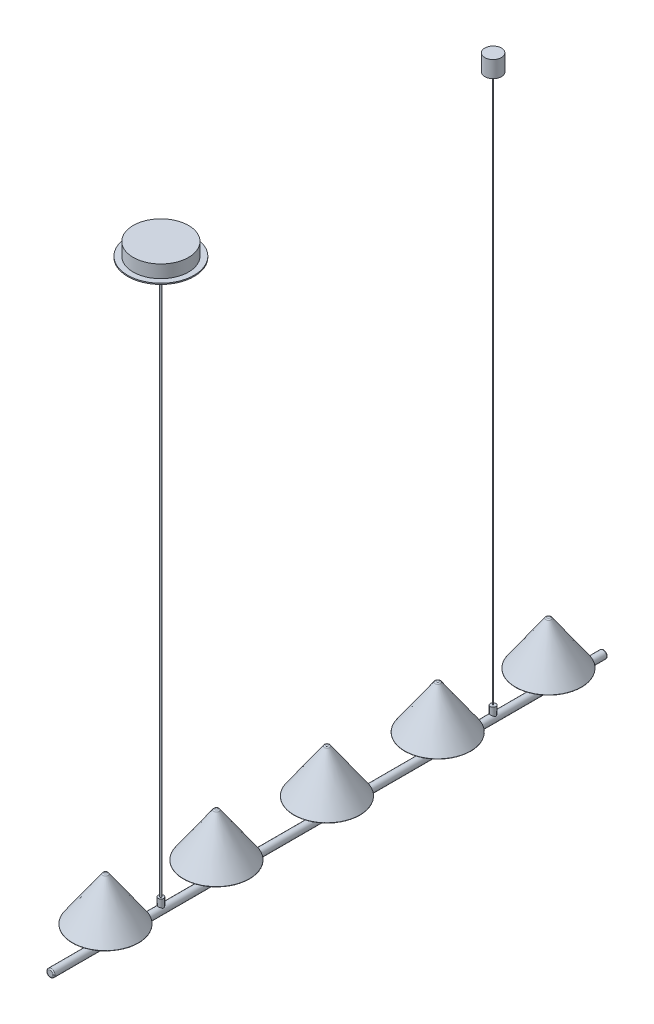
ISO-10303-21;
HEADER;
FILE_DESCRIPTION(('STEP AP214'),'2;1');
FILE_NAME('part.step','',(''),(''),'','','');
FILE_SCHEMA(('AUTOMOTIVE_DESIGN { 1 0 10303 214 1 1 1 1 }'));
ENDSEC;
DATA;
#1=APPLICATION_CONTEXT('core data for automotive mechanical design processes');
#2=APPLICATION_PROTOCOL_DEFINITION('international standard','automotive_design',2000,#1);
#3=PRODUCT_CONTEXT('',#1,'mechanical');
#4=PRODUCT('Part','Part','',(#3));
#5=PRODUCT_RELATED_PRODUCT_CATEGORY('part','',(#4));
#6=PRODUCT_DEFINITION_FORMATION('','',#4);
#7=PRODUCT_DEFINITION_CONTEXT('part definition',#1,'design');
#8=PRODUCT_DEFINITION('design','',#6,#7);
#9=PRODUCT_DEFINITION_SHAPE('','',#8);
#10=(LENGTH_UNIT() NAMED_UNIT(*) SI_UNIT(.MILLI.,.METRE.));
#11=(NAMED_UNIT(*) PLANE_ANGLE_UNIT() SI_UNIT($,.RADIAN.));
#12=(NAMED_UNIT(*) SI_UNIT($,.STERADIAN.) SOLID_ANGLE_UNIT());
#13=UNCERTAINTY_MEASURE_WITH_UNIT(LENGTH_MEASURE(1.E-05),#10,'distance_accuracy_value','');
#14=(GEOMETRIC_REPRESENTATION_CONTEXT(3) GLOBAL_UNCERTAINTY_ASSIGNED_CONTEXT((#13)) GLOBAL_UNIT_ASSIGNED_CONTEXT((#10,
#11,#12)) REPRESENTATION_CONTEXT('',''));
#15=CARTESIAN_POINT('',(0.,0.,0.));
#16=DIRECTION('',(0.,0.,1.));
#17=DIRECTION('',(1.,0.,0.));
#18=AXIS2_PLACEMENT_3D('',#15,#16,#17);
#19=CARTESIAN_POINT('',(-26.1607391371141,91.1640668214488,600.));
#20=DIRECTION('',(0.,-1.,0.));
#21=DIRECTION('',(-0.999829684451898,0.,0.0184554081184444));
#22=AXIS2_PLACEMENT_3D('',#19,#20,#21);
#23=PLANE('',#22);
#24=CARTESIAN_POINT('',(-26.1607391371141,91.1640668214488,600.));
#25=DIRECTION('',(0.,-1.,0.));
#26=DIRECTION('',(-0.999829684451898,0.,0.0184554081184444));
#27=AXIS2_PLACEMENT_3D('',#24,#25,#26);
#28=CIRCLE('',#27,2.4380333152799);
#29=CARTESIAN_POINT('',(-28.5983572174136,91.1640668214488,600.04499489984));
#30=VERTEX_POINT('',#29);
#31=EDGE_CURVE('P0_E30',#30,#30,#28,.F.);
#32=ORIENTED_EDGE('',*,*,#31,.T.);
#33=EDGE_LOOP('',(#32));
#34=FACE_BOUND('',#33,.T.);
#35=ADVANCED_FACE('P0_F15',(#34),#23,.F.);
#36=CARTESIAN_POINT('',(-26.1607391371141,11.1640668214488,600.));
#37=DIRECTION('',(0.,-1.,0.));
#38=DIRECTION('',(-0.999829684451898,0.,0.0184554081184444));
#39=AXIS2_PLACEMENT_3D('',#36,#37,#38);
#40=CONICAL_SURFACE('',#39,60.,0.610725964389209);
#41=CARTESIAN_POINT('',(-26.1607391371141,11.9507979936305,600.));
#42=DIRECTION('',(0.,1.,0.));
#43=DIRECTION('',(0.999829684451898,0.,-0.0184554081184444));
#44=AXIS2_PLACEMENT_3D('',#41,#42,#43);
#45=CIRCLE('',#44,59.4492881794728);
#46=CARTESIAN_POINT('',(-85.5999021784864,11.9507979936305,601.097160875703));
#47=VERTEX_POINT('',#46);
#48=EDGE_CURVE('P0_E22',#47,#47,#45,.T.);
#49=CARTESIAN_POINT('',(-26.1607391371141,89.8844538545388,600.));
#50=DIRECTION('',(0.,1.,0.));
#51=DIRECTION('',(0.999829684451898,0.,-0.0184554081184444));
#52=AXIS2_PLACEMENT_3D('',#49,#50,#51);
#53=CIRCLE('',#52,4.89572907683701);
#54=CARTESIAN_POINT('',(-31.05563439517,89.8844538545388,600.09035267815));
#55=VERTEX_POINT('',#54);
#56=EDGE_CURVE('P0_E26',#55,#55,#53,.F.);
#57=CARTESIAN_POINT('',(-85.5999021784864,11.9507979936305,601.097160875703));
#58=CARTESIAN_POINT('',(-85.0317327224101,12.7626069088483,601.086673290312));
#59=CARTESIAN_POINT('',(-84.4635632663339,13.5744158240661,601.076185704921));
#60=CARTESIAN_POINT('',(-83.3272243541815,15.1980336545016,601.055210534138));
#61=CARTESIAN_POINT('',(-82.7590548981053,16.0098425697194,601.044722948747));
#62=CARTESIAN_POINT('',(-81.6227159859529,17.633460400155,601.023747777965));
#63=CARTESIAN_POINT('',(-81.0545465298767,18.4452693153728,601.013260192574));
#64=CARTESIAN_POINT('',(-79.9182076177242,20.0688871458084,600.992285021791));
#65=CARTESIAN_POINT('',(-79.350038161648,20.8806960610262,600.9817974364));
#66=CARTESIAN_POINT('',(-78.2136992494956,22.5043138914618,600.960822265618));
#67=CARTESIAN_POINT('',(-77.6455297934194,23.3161228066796,600.950334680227));
#68=CARTESIAN_POINT('',(-76.509190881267,24.9397406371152,600.929359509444));
#69=CARTESIAN_POINT('',(-75.9410214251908,25.751549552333,600.918871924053));
#70=CARTESIAN_POINT('',(-74.8046825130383,27.3751673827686,600.897896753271));
#71=CARTESIAN_POINT('',(-74.2365130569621,28.1869762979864,600.88740916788));
#72=CARTESIAN_POINT('',(-73.1001741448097,29.810594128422,600.866433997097));
#73=CARTESIAN_POINT('',(-72.5320046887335,30.6224030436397,600.855946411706));
#74=CARTESIAN_POINT('',(-71.3956657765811,32.2460208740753,600.834971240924));
#75=CARTESIAN_POINT('',(-70.8274963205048,33.0578297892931,600.824483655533));
#76=CARTESIAN_POINT('',(-69.6911574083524,34.6814476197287,600.80350848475));
#77=CARTESIAN_POINT('',(-69.1229879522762,35.4932565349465,600.793020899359));
#78=CARTESIAN_POINT('',(-67.9866490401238,37.1168743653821,600.772045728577));
#79=CARTESIAN_POINT('',(-67.4184795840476,37.9286832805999,600.761558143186));
#80=CARTESIAN_POINT('',(-66.2821406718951,39.5523011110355,600.740582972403));
#81=CARTESIAN_POINT('',(-65.7139712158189,40.3641100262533,600.730095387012));
#82=CARTESIAN_POINT('',(-64.5776323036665,41.9877278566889,600.70912021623));
#83=CARTESIAN_POINT('',(-64.0094628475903,42.7995367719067,600.698632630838));
#84=CARTESIAN_POINT('',(-62.8731239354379,44.4231546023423,600.677657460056));
#85=CARTESIAN_POINT('',(-62.3049544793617,45.2349635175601,600.667169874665));
#86=CARTESIAN_POINT('',(-61.1686155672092,46.8585813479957,600.646194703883));
#87=CARTESIAN_POINT('',(-60.600446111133,47.6703902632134,600.635707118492));
#88=CARTESIAN_POINT('',(-59.4641071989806,49.294008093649,600.614731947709));
#89=CARTESIAN_POINT('',(-58.8959377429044,50.1058170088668,600.604244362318));
#90=CARTESIAN_POINT('',(-57.759598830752,51.7294348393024,600.583269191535));
#91=CARTESIAN_POINT('',(-57.1914293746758,52.5412437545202,600.572781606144));
#92=CARTESIAN_POINT('',(-56.0550904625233,54.1648615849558,600.551806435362));
#93=CARTESIAN_POINT('',(-55.4869210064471,54.9766705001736,600.541318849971));
#94=CARTESIAN_POINT('',(-54.3505820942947,56.6002883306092,600.520343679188));
#95=CARTESIAN_POINT('',(-53.7824126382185,57.412097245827,600.509856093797));
#96=CARTESIAN_POINT('',(-52.6460737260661,59.0357150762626,600.488880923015));
#97=CARTESIAN_POINT('',(-52.0779042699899,59.8475239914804,600.478393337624));
#98=CARTESIAN_POINT('',(-50.9415653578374,61.471141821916,600.457418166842));
#99=CARTESIAN_POINT('',(-50.3733959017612,62.2829507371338,600.44693058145));
#100=CARTESIAN_POINT('',(-49.2370569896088,63.9065685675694,600.425955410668));
#101=CARTESIAN_POINT('',(-48.6688875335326,64.7183774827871,600.415467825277));
#102=CARTESIAN_POINT('',(-47.5325486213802,66.3419953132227,600.394492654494));
#103=CARTESIAN_POINT('',(-46.964379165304,67.1538042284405,600.384005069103));
#104=CARTESIAN_POINT('',(-45.8280402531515,68.7774220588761,600.363029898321));
#105=CARTESIAN_POINT('',(-45.2598707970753,69.5892309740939,600.35254231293));
#106=CARTESIAN_POINT('',(-44.1235318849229,71.2128488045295,600.331567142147));
#107=CARTESIAN_POINT('',(-43.5553624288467,72.0246577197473,600.321079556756));
#108=CARTESIAN_POINT('',(-42.4190235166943,73.6482755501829,600.300104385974));
#109=CARTESIAN_POINT('',(-41.850854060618,74.4600844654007,600.289616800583));
#110=CARTESIAN_POINT('',(-40.7145151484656,76.0837022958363,600.2686416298));
#111=CARTESIAN_POINT('',(-40.1463456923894,76.8955112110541,600.258154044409));
#112=CARTESIAN_POINT('',(-39.010006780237,78.5191290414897,600.237178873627));
#113=CARTESIAN_POINT('',(-38.4418373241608,79.3309379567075,600.226691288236));
#114=CARTESIAN_POINT('',(-37.3054984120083,80.954555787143,600.205716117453));
#115=CARTESIAN_POINT('',(-36.7373289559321,81.7663647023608,600.195228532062));
#116=CARTESIAN_POINT('',(-35.6009900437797,83.3899825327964,600.17425336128));
#117=CARTESIAN_POINT('',(-35.0328205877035,84.2017914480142,600.163765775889));
#118=CARTESIAN_POINT('',(-33.8964816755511,85.8254092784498,600.142790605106));
#119=CARTESIAN_POINT('',(-33.3283122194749,86.6372181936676,600.132303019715));
#120=CARTESIAN_POINT('',(-32.1919733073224,88.2608360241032,600.111327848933));
#121=CARTESIAN_POINT('',(-31.6238038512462,89.072644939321,600.100840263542));
#122=CARTESIAN_POINT('',(-31.05563439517,89.8844538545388,600.09035267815));
#123=B_SPLINE_CURVE_WITH_KNOTS('',3,(#57,#58,#59,#60,#61,#62,#63,#64,#65,#66,#67,#68,#69,#70,
#71,#72,#73,#74,#75,#76,#77,#78,#79,#80,#81,#82,#83,#84,#85,#86,#87,#88,#89,#90,#91,#92,#93,#94,
#95,#96,#97,#98,#99,#100,#101,#102,#103,#104,#105,#106,#107,#108,#109,#110,#111,#112,#113,#114,
#115,#116,#117,#118,#119,#120,#121,#122),.UNSPECIFIED.,.F.,.F.,(4,2,2,2,2,2,2,2,2,2,2,2,2,2,2,2,
2,2,2,2,2,2,2,2,2,2,2,2,2,2,2,2,4),(0.,2.97281720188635,5.94563440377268,8.91845160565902,
11.8912688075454,14.8640860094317,17.836903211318,20.8097204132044,23.7825376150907,
26.7553548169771,29.7281720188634,32.7009892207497,35.6738064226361,38.6466236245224,
41.6194408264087,44.5922580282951,47.5650752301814,50.5378924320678,53.5107096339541,
56.4835268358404,59.4563440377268,62.4291612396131,65.4019784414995,68.3747956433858,
71.3476128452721,74.3204300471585,77.2932472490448,80.2660644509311,83.2388816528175,
86.2116988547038,89.1845160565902,92.1573332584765,95.1301504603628),.UNSPECIFIED.);
#124=EDGE_CURVE('P0_BSEAM56',#47,#55,#123,.T.);
#125=ORIENTED_EDGE('',*,*,#48,.T.);
#126=ORIENTED_EDGE('',*,*,#56,.T.);
#127=ORIENTED_EDGE('',*,*,#124,.T.);
#128=ORIENTED_EDGE('',*,*,#124,.F.);
#129=EDGE_LOOP('',(#125,#127,#126,#128));
#130=FACE_BOUND('',#129,.T.);
#131=ADVANCED_FACE('P0_F56',(#130),#40,.T.);
#132=CARTESIAN_POINT('',(-25.0534146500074,11.1640668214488,659.989781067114));
#133=DIRECTION('',(0.,1.,0.));
#134=DIRECTION('',(0.999829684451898,0.,-0.0184554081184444));
#135=AXIS2_PLACEMENT_3D('',#132,#133,#134);
#136=PLANE('',#135);
#137=CARTESIAN_POINT('',(-26.1607391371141,11.1640668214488,600.));
#138=DIRECTION('',(0.,1.,0.));
#139=DIRECTION('',(0.999829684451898,0.,-0.0184554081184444));
#140=AXIS2_PLACEMENT_3D('',#137,#138,#139);
#141=CIRCLE('',#140,59.0396722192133);
#142=CARTESIAN_POINT('',(32.8688777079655,11.1640668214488,598.910398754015));
#143=VERTEX_POINT('',#142);
#144=EDGE_CURVE('P0_E10',#143,#143,#141,.F.);
#145=ORIENTED_EDGE('',*,*,#144,.T.);
#146=EDGE_LOOP('',(#145));
#147=FACE_BOUND('',#146,.T.);
#148=CARTESIAN_POINT('',(-26.1607391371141,11.1640668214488,600.));
#149=DIRECTION('',(0.,1.,0.));
#150=DIRECTION('',(0.999829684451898,0.,-0.0184554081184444));
#151=AXIS2_PLACEMENT_3D('',#148,#149,#150);
#152=CIRCLE('',#151,57.5586888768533);
#153=CARTESIAN_POINT('',(-83.7096248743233,11.1640668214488,601.062269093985));
#154=VERTEX_POINT('',#153);
#155=EDGE_CURVE('P0_E36',#154,#154,#152,.T.);
#156=ORIENTED_EDGE('',*,*,#155,.T.);
#157=EDGE_LOOP('',(#156));
#158=FACE_BOUND('',#157,.T.);
#159=ADVANCED_FACE('P0_F47',(#147,#158),#136,.F.);
#160=CARTESIAN_POINT('',(-26.1607391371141,89.1640668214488,600.));
#161=DIRECTION('',(0.,-1.,0.));
#162=DIRECTION('',(-0.999829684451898,0.,0.0184554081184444));
#163=AXIS2_PLACEMENT_3D('',#160,#161,#162);
#164=PLANE('',#163);
#165=CARTESIAN_POINT('',(-26.1607391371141,89.1640668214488,600.));
#166=DIRECTION('',(0.,-1.,0.));
#167=DIRECTION('',(-0.999829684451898,0.,0.0184554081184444));
#168=AXIS2_PLACEMENT_3D('',#165,#166,#167);
#169=CIRCLE('',#168,2.95868887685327);
#170=CARTESIAN_POINT('',(-29.1189241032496,89.1640668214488,600.054603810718));
#171=VERTEX_POINT('',#170);
#172=EDGE_CURVE('P0_E35',#171,#171,#169,.F.);
#173=ORIENTED_EDGE('',*,*,#172,.F.);
#174=EDGE_LOOP('',(#173));
#175=FACE_BOUND('',#174,.T.);
#176=ADVANCED_FACE('P0_F45',(#175),#164,.T.);
#177=CARTESIAN_POINT('',(-26.1607391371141,10.0171421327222,600.));
#178=DIRECTION('',(0.,-1.,0.));
#179=DIRECTION('',(-0.999829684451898,0.,0.0184554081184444));
#180=AXIS2_PLACEMENT_3D('',#177,#178,#179);
#181=CONICAL_SURFACE('',#180,58.3615361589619,0.610725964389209);
#182=CARTESIAN_POINT('',(-29.1189241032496,89.1640668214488,600.054603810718));
#183=CARTESIAN_POINT('',(-29.6875772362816,88.3515668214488,600.065100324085));
#184=CARTESIAN_POINT('',(-30.2562303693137,87.5390668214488,600.075596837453));
#185=CARTESIAN_POINT('',(-31.3935366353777,85.9140668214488,600.096589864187));
#186=CARTESIAN_POINT('',(-31.9621897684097,85.1015668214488,600.107086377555));
#187=CARTESIAN_POINT('',(-33.0994960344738,83.4765668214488,600.128079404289));
#188=CARTESIAN_POINT('',(-33.6681491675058,82.6640668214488,600.138575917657));
#189=CARTESIAN_POINT('',(-34.8054554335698,81.0390668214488,600.159568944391));
#190=CARTESIAN_POINT('',(-35.3741085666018,80.2265668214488,600.170065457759));
#191=CARTESIAN_POINT('',(-36.5114148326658,78.6015668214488,600.191058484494));
#192=CARTESIAN_POINT('',(-37.0800679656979,77.7890668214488,600.201554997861));
#193=CARTESIAN_POINT('',(-38.2173742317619,76.1640668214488,600.222548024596));
#194=CARTESIAN_POINT('',(-38.7860273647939,75.3515668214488,600.233044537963));
#195=CARTESIAN_POINT('',(-39.923333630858,73.7265668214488,600.254037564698));
#196=CARTESIAN_POINT('',(-40.49198676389,72.9140668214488,600.264534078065));
#197=CARTESIAN_POINT('',(-41.629293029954,71.2890668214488,600.2855271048));
#198=CARTESIAN_POINT('',(-42.197946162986,70.4765668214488,600.296023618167));
#199=CARTESIAN_POINT('',(-43.3352524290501,68.8515668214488,600.317016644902));
#200=CARTESIAN_POINT('',(-43.9039055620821,68.0390668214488,600.327513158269));
#201=CARTESIAN_POINT('',(-45.0412118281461,66.4140668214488,600.348506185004));
#202=CARTESIAN_POINT('',(-45.6098649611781,65.6015668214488,600.359002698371));
#203=CARTESIAN_POINT('',(-46.7471712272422,63.9765668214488,600.379995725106));
#204=CARTESIAN_POINT('',(-47.3158243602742,63.1640668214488,600.390492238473));
#205=CARTESIAN_POINT('',(-48.4531306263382,61.5390668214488,600.411485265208));
#206=CARTESIAN_POINT('',(-49.0217837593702,60.7265668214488,600.421981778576));
#207=CARTESIAN_POINT('',(-50.1590900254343,59.1015668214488,600.44297480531));
#208=CARTESIAN_POINT('',(-50.7277431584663,58.2890668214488,600.453471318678));
#209=CARTESIAN_POINT('',(-51.8650494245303,56.6640668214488,600.474464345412));
#210=CARTESIAN_POINT('',(-52.4337025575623,55.8515668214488,600.48496085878));
#211=CARTESIAN_POINT('',(-53.5710088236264,54.2265668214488,600.505953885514));
#212=CARTESIAN_POINT('',(-54.1396619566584,53.4140668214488,600.516450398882));
#213=CARTESIAN_POINT('',(-55.2769682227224,51.7890668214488,600.537443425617));
#214=CARTESIAN_POINT('',(-55.8456213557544,50.9765668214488,600.547939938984));
#215=CARTESIAN_POINT('',(-56.9829276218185,49.3515668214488,600.568932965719));
#216=CARTESIAN_POINT('',(-57.5515807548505,48.5390668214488,600.579429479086));
#217=CARTESIAN_POINT('',(-58.6888870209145,46.9140668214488,600.600422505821));
#218=CARTESIAN_POINT('',(-59.2575401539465,46.1015668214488,600.610919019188));
#219=CARTESIAN_POINT('',(-60.3948464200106,44.4765668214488,600.631912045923));
#220=CARTESIAN_POINT('',(-60.9634995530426,43.6640668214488,600.64240855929));
#221=CARTESIAN_POINT('',(-62.1008058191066,42.0390668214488,600.663401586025));
#222=CARTESIAN_POINT('',(-62.6694589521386,41.2265668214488,600.673898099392));
#223=CARTESIAN_POINT('',(-63.8067652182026,39.6015668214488,600.694891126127));
#224=CARTESIAN_POINT('',(-64.3754183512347,38.7890668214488,600.705387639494));
#225=CARTESIAN_POINT('',(-65.5127246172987,37.1640668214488,600.726380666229));
#226=CARTESIAN_POINT('',(-66.0813777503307,36.3515668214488,600.736877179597));
#227=CARTESIAN_POINT('',(-67.2186840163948,34.7265668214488,600.757870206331));
#228=CARTESIAN_POINT('',(-67.7873371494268,33.9140668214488,600.768366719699));
#229=CARTESIAN_POINT('',(-68.9246434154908,32.2890668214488,600.789359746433));
#230=CARTESIAN_POINT('',(-69.4932965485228,31.4765668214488,600.799856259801));
#231=CARTESIAN_POINT('',(-70.6306028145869,29.8515668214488,600.820849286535));
#232=CARTESIAN_POINT('',(-71.1992559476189,29.0390668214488,600.831345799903));
#233=CARTESIAN_POINT('',(-72.3365622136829,27.4140668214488,600.852338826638));
#234=CARTESIAN_POINT('',(-72.9052153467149,26.6015668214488,600.862835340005));
#235=CARTESIAN_POINT('',(-74.042521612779,24.9765668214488,600.88382836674));
#236=CARTESIAN_POINT('',(-74.611174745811,24.1640668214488,600.894324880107));
#237=CARTESIAN_POINT('',(-75.748481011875,22.5390668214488,600.915317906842));
#238=CARTESIAN_POINT('',(-76.317134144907,21.7265668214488,600.925814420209));
#239=CARTESIAN_POINT('',(-77.4544404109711,20.1015668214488,600.946807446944));
#240=CARTESIAN_POINT('',(-78.0230935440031,19.2890668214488,600.957303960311));
#241=CARTESIAN_POINT('',(-79.1603998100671,17.6640668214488,600.978296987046));
#242=CARTESIAN_POINT('',(-79.7290529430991,16.8515668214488,600.988793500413));
#243=CARTESIAN_POINT('',(-80.8663592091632,15.2265668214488,601.009786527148));
#244=CARTESIAN_POINT('',(-81.4350123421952,14.4140668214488,601.020283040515));
#245=CARTESIAN_POINT('',(-82.5723186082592,12.7890668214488,601.04127606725));
#246=CARTESIAN_POINT('',(-83.1409717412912,11.9765668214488,601.051772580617));
#247=CARTESIAN_POINT('',(-83.7096248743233,11.1640668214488,601.062269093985));
#248=B_SPLINE_CURVE_WITH_KNOTS('',3,(#182,#183,#184,#185,#186,#187,#188,#189,#190,#191,#192,
#193,#194,#195,#196,#197,#198,#199,#200,#201,#202,#203,#204,#205,#206,#207,#208,#209,#210,#211,
#212,#213,#214,#215,#216,#217,#218,#219,#220,#221,#222,#223,#224,#225,#226,#227,#228,#229,#230,
#231,#232,#233,#234,#235,#236,#237,#238,#239,#240,#241,#242,#243,#244,#245,#246,#247),
.UNSPECIFIED.,.F.,.F.,(4,2,2,2,2,2,2,2,2,2,2,2,2,2,2,2,2,2,2,2,2,2,2,2,2,2,2,2,2,2,2,2,4),(0.,
2.97534793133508,5.95069586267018,8.92604379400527,11.9013917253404,14.8767396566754,
17.8520875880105,20.8274355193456,23.8027834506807,26.7781313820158,29.7534793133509,
32.728827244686,35.7041751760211,38.6795231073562,41.6548710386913,44.6302189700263,
47.6055669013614,50.5809148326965,53.5562627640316,56.5316106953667,59.5069586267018,
62.4823065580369,65.457654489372,68.4330024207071,71.4083503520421,74.3836982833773,
77.3590462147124,80.3343941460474,83.3097420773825,86.2850900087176,89.2604379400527,
92.2357858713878,95.2111338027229),.UNSPECIFIED.);
#249=EDGE_CURVE('P0_BSEAM42',#171,#154,#248,.T.);
#250=ORIENTED_EDGE('',*,*,#172,.T.);
#251=ORIENTED_EDGE('',*,*,#155,.F.);
#252=ORIENTED_EDGE('',*,*,#249,.T.);
#253=ORIENTED_EDGE('',*,*,#249,.F.);
#254=EDGE_LOOP('',(#250,#252,#251,#253));
#255=FACE_BOUND('',#254,.T.);
#256=ADVANCED_FACE('P0_F42',(#255),#181,.F.);
#257=CARTESIAN_POINT('',(-26.1607391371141,88.1640668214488,600.));
#258=DIRECTION('',(0.,-1.,0.));
#259=DIRECTION('',(-0.999829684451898,0.,0.0184554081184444));
#260=AXIS2_PLACEMENT_3D('',#257,#258,#259);
#261=DEGENERATE_TOROIDAL_SURFACE('',#260,2.4380333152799,3.,.T.);
#262=ORIENTED_EDGE('',*,*,#56,.F.);
#263=EDGE_LOOP('',(#262));
#264=FACE_BOUND('',#263,.T.);
#265=ORIENTED_EDGE('',*,*,#31,.F.);
#266=EDGE_LOOP('',(#265));
#267=FACE_BOUND('',#266,.T.);
#268=ADVANCED_FACE('P0_F54',(#264,#267),#261,.T.);
#269=CARTESIAN_POINT('',(-26.1607391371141,11.6640668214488,600.));
#270=DIRECTION('',(0.,1.,0.));
#271=DIRECTION('',(0.999829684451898,0.,-0.0184554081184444));
#272=AXIS2_PLACEMENT_3D('',#269,#270,#271);
#273=TOROIDAL_SURFACE('',#272,59.0396722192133,0.5);
#274=ORIENTED_EDGE('',*,*,#144,.F.);
#275=EDGE_LOOP('',(#274));
#276=FACE_BOUND('',#275,.T.);
#277=ORIENTED_EDGE('',*,*,#48,.F.);
#278=EDGE_LOOP('',(#277));
#279=FACE_BOUND('',#278,.T.);
#280=ADVANCED_FACE('P0_F17',(#276,#279),#273,.T.);
#281=CLOSED_SHELL('',(#35,#131,#159,#176,#256,#268,#280));
#282=MANIFOLD_SOLID_BREP('P0_B1',#281);
#283=CARTESIAN_POINT('',(-26.1607391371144,91.1640668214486,800.));
#284=DIRECTION('',(0.,-1.,0.));
#285=DIRECTION('',(-1.,0.,0.));
#286=AXIS2_PLACEMENT_3D('',#283,#284,#285);
#287=PLANE('',#286);
#288=CARTESIAN_POINT('',(-26.1607391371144,91.1640668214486,800.));
#289=DIRECTION('',(0.,-1.,0.));
#290=DIRECTION('',(-1.,0.,0.));
#291=AXIS2_PLACEMENT_3D('',#288,#289,#290);
#292=CIRCLE('',#291,2.4380333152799);
#293=CARTESIAN_POINT('',(-28.5987724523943,91.1640668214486,800.));
#294=VERTEX_POINT('',#293);
#295=EDGE_CURVE('P1_E30',#294,#294,#292,.F.);
#296=ORIENTED_EDGE('',*,*,#295,.T.);
#297=EDGE_LOOP('',(#296));
#298=FACE_BOUND('',#297,.T.);
#299=ADVANCED_FACE('P1_F15',(#298),#287,.F.);
#300=CARTESIAN_POINT('',(-26.1607391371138,11.1640668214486,800.));
#301=DIRECTION('',(0.,-1.,0.));
#302=DIRECTION('',(-1.,0.,0.));
#303=AXIS2_PLACEMENT_3D('',#300,#301,#302);
#304=CONICAL_SURFACE('',#303,60.,0.610725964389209);
#305=CARTESIAN_POINT('',(-26.1607391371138,11.9507979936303,800.));
#306=DIRECTION('',(0.,1.,0.));
#307=DIRECTION('',(1.,0.,0.));
#308=AXIS2_PLACEMENT_3D('',#305,#306,#307);
#309=CIRCLE('',#308,59.4492881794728);
#310=CARTESIAN_POINT('',(-85.6100273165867,11.9507979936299,800.));
#311=VERTEX_POINT('',#310);
#312=EDGE_CURVE('P1_E22',#311,#311,#309,.T.);
#313=CARTESIAN_POINT('',(-26.1607391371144,89.8844538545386,800.));
#314=DIRECTION('',(0.,1.,0.));
#315=DIRECTION('',(1.,0.,0.));
#316=AXIS2_PLACEMENT_3D('',#313,#314,#315);
#317=CIRCLE('',#316,4.89572907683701);
#318=CARTESIAN_POINT('',(-31.0564682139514,89.8844538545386,800.));
#319=VERTEX_POINT('',#318);
#320=EDGE_CURVE('P1_E26',#319,#319,#317,.F.);
#321=CARTESIAN_POINT('',(-85.6100273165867,11.9507979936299,800.));
#322=CARTESIAN_POINT('',(-85.0417610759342,12.7626069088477,800.));
#323=CARTESIAN_POINT('',(-84.4734948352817,13.5744158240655,800.));
#324=CARTESIAN_POINT('',(-83.3369623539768,15.1980336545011,800.));
#325=CARTESIAN_POINT('',(-82.7686961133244,16.0098425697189,800.));
#326=CARTESIAN_POINT('',(-81.6321636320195,17.6334604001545,800.));
#327=CARTESIAN_POINT('',(-81.063897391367,18.4452693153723,800.));
#328=CARTESIAN_POINT('',(-79.9273649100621,20.0688871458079,800.));
#329=CARTESIAN_POINT('',(-79.3590986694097,20.8806960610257,800.));
#330=CARTESIAN_POINT('',(-78.2225661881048,22.5043138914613,800.));
#331=CARTESIAN_POINT('',(-77.6542999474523,23.3161228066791,800.));
#332=CARTESIAN_POINT('',(-76.5177674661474,24.9397406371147,800.));
#333=CARTESIAN_POINT('',(-75.949501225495,25.7515495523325,800.));
#334=CARTESIAN_POINT('',(-74.8129687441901,27.3751673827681,800.));
#335=CARTESIAN_POINT('',(-74.2447025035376,28.1869762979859,800.));
#336=CARTESIAN_POINT('',(-73.1081700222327,29.8105941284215,800.));
#337=CARTESIAN_POINT('',(-72.5399037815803,30.6224030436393,800.));
#338=CARTESIAN_POINT('',(-71.4033713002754,32.2460208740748,800.));
#339=CARTESIAN_POINT('',(-70.8351050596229,33.0578297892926,800.));
#340=CARTESIAN_POINT('',(-69.698572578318,34.6814476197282,800.));
#341=CARTESIAN_POINT('',(-69.1303063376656,35.493256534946,800.));
#342=CARTESIAN_POINT('',(-67.9937738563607,37.1168743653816,800.));
#343=CARTESIAN_POINT('',(-67.4255076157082,37.9286832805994,800.));
#344=CARTESIAN_POINT('',(-66.2889751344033,39.552301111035,800.));
#345=CARTESIAN_POINT('',(-65.7207088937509,40.3641100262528,800.));
#346=CARTESIAN_POINT('',(-64.584176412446,41.9877278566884,800.));
#347=CARTESIAN_POINT('',(-64.0159101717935,42.7995367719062,800.));
#348=CARTESIAN_POINT('',(-62.8793776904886,44.4231546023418,800.));
#349=CARTESIAN_POINT('',(-62.3111114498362,45.2349635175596,800.));
#350=CARTESIAN_POINT('',(-61.1745789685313,46.8585813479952,800.));
#351=CARTESIAN_POINT('',(-60.6063127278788,47.670390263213,800.));
#352=CARTESIAN_POINT('',(-59.4697802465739,49.2940080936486,800.));
#353=CARTESIAN_POINT('',(-58.9015140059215,50.1058170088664,800.));
#354=CARTESIAN_POINT('',(-57.7649815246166,51.729434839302,800.));
#355=CARTESIAN_POINT('',(-57.1967152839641,52.5412437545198,800.));
#356=CARTESIAN_POINT('',(-56.0601828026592,54.1648615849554,800.));
#357=CARTESIAN_POINT('',(-55.4919165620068,54.9766705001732,800.));
#358=CARTESIAN_POINT('',(-54.3553840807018,56.6002883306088,800.));
#359=CARTESIAN_POINT('',(-53.7871178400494,57.4120972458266,800.));
#360=CARTESIAN_POINT('',(-52.6505853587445,59.0357150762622,800.));
#361=CARTESIAN_POINT('',(-52.082319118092,59.84752399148,800.));
#362=CARTESIAN_POINT('',(-50.9457866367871,61.4711418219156,800.));
#363=CARTESIAN_POINT('',(-50.3775203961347,62.2829507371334,800.));
#364=CARTESIAN_POINT('',(-49.2409879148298,63.906568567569,800.));
#365=CARTESIAN_POINT('',(-48.6727216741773,64.7183774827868,800.));
#366=CARTESIAN_POINT('',(-47.5361891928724,66.3419953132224,800.));
#367=CARTESIAN_POINT('',(-46.96792295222,67.1538042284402,800.));
#368=CARTESIAN_POINT('',(-45.8313904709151,68.7774220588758,800.));
#369=CARTESIAN_POINT('',(-45.2631242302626,69.5892309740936,800.));
#370=CARTESIAN_POINT('',(-44.1265917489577,71.2128488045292,800.));
#371=CARTESIAN_POINT('',(-43.5583255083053,72.024657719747,800.));
#372=CARTESIAN_POINT('',(-42.4217930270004,73.6482755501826,800.));
#373=CARTESIAN_POINT('',(-41.8535267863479,74.4600844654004,800.));
#374=CARTESIAN_POINT('',(-40.716994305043,76.083702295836,800.));
#375=CARTESIAN_POINT('',(-40.1487280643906,76.8955112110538,800.));
#376=CARTESIAN_POINT('',(-39.0121955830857,78.5191290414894,800.));
#377=CARTESIAN_POINT('',(-38.4439293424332,79.3309379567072,800.));
#378=CARTESIAN_POINT('',(-37.3073968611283,80.9545557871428,800.));
#379=CARTESIAN_POINT('',(-36.7391306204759,81.7663647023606,800.));
#380=CARTESIAN_POINT('',(-35.602598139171,83.3899825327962,800.));
#381=CARTESIAN_POINT('',(-35.0343318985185,84.201791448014,800.));
#382=CARTESIAN_POINT('',(-33.8977994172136,85.8254092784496,800.));
#383=CARTESIAN_POINT('',(-33.3295331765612,86.6372181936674,800.));
#384=CARTESIAN_POINT('',(-32.1930006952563,88.260836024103,800.));
#385=CARTESIAN_POINT('',(-31.6247344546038,89.0726449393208,800.));
#386=CARTESIAN_POINT('',(-31.0564682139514,89.8844538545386,800.));
#387=B_SPLINE_CURVE_WITH_KNOTS('',3,(#321,#322,#323,#324,#325,#326,#327,#328,#329,#330,#331,
#332,#333,#334,#335,#336,#337,#338,#339,#340,#341,#342,#343,#344,#345,#346,#347,#348,#349,#350,
#351,#352,#353,#354,#355,#356,#357,#358,#359,#360,#361,#362,#363,#364,#365,#366,#367,#368,#369,
#370,#371,#372,#373,#374,#375,#376,#377,#378,#379,#380,#381,#382,#383,#384,#385,#386),
.UNSPECIFIED.,.F.,.F.,(4,2,2,2,2,2,2,2,2,2,2,2,2,2,2,2,2,2,2,2,2,2,2,2,2,2,2,2,2,2,2,2,4),(0.,
2.97281720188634,5.94563440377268,8.91845160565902,11.8912688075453,14.8640860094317,
17.836903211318,20.8097204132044,23.7825376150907,26.7553548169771,29.7281720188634,
32.7009892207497,35.6738064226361,38.6466236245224,41.6194408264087,44.5922580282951,
47.5650752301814,50.5378924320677,53.5107096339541,56.4835268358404,59.4563440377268,
62.4291612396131,65.4019784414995,68.3747956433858,71.3476128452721,74.3204300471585,
77.2932472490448,80.2660644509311,83.2388816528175,86.2116988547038,89.1845160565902,
92.1573332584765,95.1301504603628),.UNSPECIFIED.);
#388=EDGE_CURVE('P1_BSEAM56',#311,#319,#387,.T.);
#389=ORIENTED_EDGE('',*,*,#312,.T.);
#390=ORIENTED_EDGE('',*,*,#320,.T.);
#391=ORIENTED_EDGE('',*,*,#388,.T.);
#392=ORIENTED_EDGE('',*,*,#388,.F.);
#393=EDGE_LOOP('',(#389,#391,#390,#392));
#394=FACE_BOUND('',#393,.T.);
#395=ADVANCED_FACE('P1_F56',(#394),#304,.T.);
#396=CARTESIAN_POINT('',(-26.160739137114,11.1640668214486,860.));
#397=DIRECTION('',(0.,1.,0.));
#398=DIRECTION('',(1.,0.,0.));
#399=AXIS2_PLACEMENT_3D('',#396,#397,#398);
#400=PLANE('',#399);
#401=CARTESIAN_POINT('',(-26.1607391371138,11.1640668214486,800.));
#402=DIRECTION('',(0.,1.,0.));
#403=DIRECTION('',(1.,0.,0.));
#404=AXIS2_PLACEMENT_3D('',#401,#402,#403);
#405=CIRCLE('',#404,59.0396722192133);
#406=CARTESIAN_POINT('',(32.8789330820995,11.164066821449,800.));
#407=VERTEX_POINT('',#406);
#408=EDGE_CURVE('P1_E10',#407,#407,#405,.F.);
#409=ORIENTED_EDGE('',*,*,#408,.T.);
#410=EDGE_LOOP('',(#409));
#411=FACE_BOUND('',#410,.T.);
#412=CARTESIAN_POINT('',(-26.1607391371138,11.1640668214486,800.));
#413=DIRECTION('',(0.,1.,0.));
#414=DIRECTION('',(1.,0.,0.));
#415=AXIS2_PLACEMENT_3D('',#412,#413,#414);
#416=CIRCLE('',#415,57.5586888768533);
#417=CARTESIAN_POINT('',(-83.7194280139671,11.1640668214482,800.));
#418=VERTEX_POINT('',#417);
#419=EDGE_CURVE('P1_E36',#418,#418,#416,.T.);
#420=ORIENTED_EDGE('',*,*,#419,.T.);
#421=EDGE_LOOP('',(#420));
#422=FACE_BOUND('',#421,.T.);
#423=ADVANCED_FACE('P1_F47',(#411,#422),#400,.F.);
#424=CARTESIAN_POINT('',(-26.1607391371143,89.1640668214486,800.));
#425=DIRECTION('',(0.,-1.,0.));
#426=DIRECTION('',(-1.,0.,0.));
#427=AXIS2_PLACEMENT_3D('',#424,#425,#426);
#428=PLANE('',#427);
#429=CARTESIAN_POINT('',(-26.1607391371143,89.1640668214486,800.));
#430=DIRECTION('',(0.,-1.,0.));
#431=DIRECTION('',(-1.,0.,0.));
#432=AXIS2_PLACEMENT_3D('',#429,#430,#431);
#433=CIRCLE('',#432,2.95868887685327);
#434=CARTESIAN_POINT('',(-29.1194280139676,89.1640668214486,800.));
#435=VERTEX_POINT('',#434);
#436=EDGE_CURVE('P1_E35',#435,#435,#433,.F.);
#437=ORIENTED_EDGE('',*,*,#436,.F.);
#438=EDGE_LOOP('',(#437));
#439=FACE_BOUND('',#438,.T.);
#440=ADVANCED_FACE('P1_F45',(#439),#428,.T.);
#441=CARTESIAN_POINT('',(-26.1607391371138,10.017142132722,800.));
#442=DIRECTION('',(0.,-1.,0.));
#443=DIRECTION('',(-1.,0.,0.));
#444=AXIS2_PLACEMENT_3D('',#441,#442,#443);
#445=CONICAL_SURFACE('',#444,58.3615361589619,0.610725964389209);
#446=CARTESIAN_POINT('',(-29.1194280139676,89.1640668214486,800.));
#447=CARTESIAN_POINT('',(-29.6881780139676,88.3515668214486,800.));
#448=CARTESIAN_POINT('',(-30.2569280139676,87.5390668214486,800.));
#449=CARTESIAN_POINT('',(-31.3944280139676,85.9140668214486,800.));
#450=CARTESIAN_POINT('',(-31.9631780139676,85.1015668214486,800.));
#451=CARTESIAN_POINT('',(-33.1006780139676,83.4765668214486,800.));
#452=CARTESIAN_POINT('',(-33.6694280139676,82.6640668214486,800.));
#453=CARTESIAN_POINT('',(-34.8069280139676,81.0390668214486,800.));
#454=CARTESIAN_POINT('',(-35.3756780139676,80.2265668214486,800.));
#455=CARTESIAN_POINT('',(-36.5131780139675,78.6015668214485,800.));
#456=CARTESIAN_POINT('',(-37.0819280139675,77.7890668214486,800.));
#457=CARTESIAN_POINT('',(-38.2194280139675,76.1640668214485,800.));
#458=CARTESIAN_POINT('',(-38.7881780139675,75.3515668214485,800.));
#459=CARTESIAN_POINT('',(-39.9256780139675,73.7265668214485,800.));
#460=CARTESIAN_POINT('',(-40.4944280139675,72.9140668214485,800.));
#461=CARTESIAN_POINT('',(-41.6319280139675,71.2890668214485,800.));
#462=CARTESIAN_POINT('',(-42.2006780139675,70.4765668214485,800.));
#463=CARTESIAN_POINT('',(-43.3381780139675,68.8515668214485,800.));
#464=CARTESIAN_POINT('',(-43.9069280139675,68.0390668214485,800.));
#465=CARTESIAN_POINT('',(-45.0444280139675,66.4140668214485,800.));
#466=CARTESIAN_POINT('',(-45.6131780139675,65.6015668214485,800.));
#467=CARTESIAN_POINT('',(-46.7506780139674,63.9765668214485,800.));
#468=CARTESIAN_POINT('',(-47.3194280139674,63.1640668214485,800.));
#469=CARTESIAN_POINT('',(-48.4569280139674,61.5390668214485,800.));
#470=CARTESIAN_POINT('',(-49.0256780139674,60.7265668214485,800.));
#471=CARTESIAN_POINT('',(-50.1631780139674,59.1015668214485,800.));
#472=CARTESIAN_POINT('',(-50.7319280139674,58.2890668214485,800.));
#473=CARTESIAN_POINT('',(-51.8694280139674,56.6640668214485,800.));
#474=CARTESIAN_POINT('',(-52.4381780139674,55.8515668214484,800.));
#475=CARTESIAN_POINT('',(-53.5756780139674,54.2265668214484,800.));
#476=CARTESIAN_POINT('',(-54.1444280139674,53.4140668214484,800.));
#477=CARTESIAN_POINT('',(-55.2819280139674,51.7890668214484,800.));
#478=CARTESIAN_POINT('',(-55.8506780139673,50.9765668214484,800.));
#479=CARTESIAN_POINT('',(-56.9881780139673,49.3515668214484,800.));
#480=CARTESIAN_POINT('',(-57.5569280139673,48.5390668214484,800.));
#481=CARTESIAN_POINT('',(-58.6944280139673,46.9140668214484,800.));
#482=CARTESIAN_POINT('',(-59.2631780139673,46.1015668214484,800.));
#483=CARTESIAN_POINT('',(-60.4006780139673,44.4765668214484,800.));
#484=CARTESIAN_POINT('',(-60.9694280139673,43.6640668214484,800.));
#485=CARTESIAN_POINT('',(-62.1069280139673,42.0390668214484,800.));
#486=CARTESIAN_POINT('',(-62.6756780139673,41.2265668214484,800.));
#487=CARTESIAN_POINT('',(-63.8131780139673,39.6015668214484,800.));
#488=CARTESIAN_POINT('',(-64.3819280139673,38.7890668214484,800.));
#489=CARTESIAN_POINT('',(-65.5194280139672,37.1640668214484,800.));
#490=CARTESIAN_POINT('',(-66.0881780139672,36.3515668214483,800.));
#491=CARTESIAN_POINT('',(-67.2256780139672,34.7265668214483,800.));
#492=CARTESIAN_POINT('',(-67.7944280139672,33.9140668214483,800.));
#493=CARTESIAN_POINT('',(-68.9319280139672,32.2890668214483,800.));
#494=CARTESIAN_POINT('',(-69.5006780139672,31.4765668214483,800.));
#495=CARTESIAN_POINT('',(-70.6381780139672,29.8515668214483,800.));
#496=CARTESIAN_POINT('',(-71.2069280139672,29.0390668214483,800.));
#497=CARTESIAN_POINT('',(-72.3444280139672,27.4140668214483,800.));
#498=CARTESIAN_POINT('',(-72.9131780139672,26.6015668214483,800.));
#499=CARTESIAN_POINT('',(-74.0506780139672,24.9765668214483,800.));
#500=CARTESIAN_POINT('',(-74.6194280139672,24.1640668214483,800.));
#501=CARTESIAN_POINT('',(-75.7569280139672,22.5390668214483,800.));
#502=CARTESIAN_POINT('',(-76.3256780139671,21.7265668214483,800.));
#503=CARTESIAN_POINT('',(-77.4631780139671,20.1015668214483,800.));
#504=CARTESIAN_POINT('',(-78.0319280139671,19.2890668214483,800.));
#505=CARTESIAN_POINT('',(-79.1694280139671,17.6640668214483,800.));
#506=CARTESIAN_POINT('',(-79.7381780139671,16.8515668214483,800.));
#507=CARTESIAN_POINT('',(-80.8756780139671,15.2265668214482,800.));
#508=CARTESIAN_POINT('',(-81.4444280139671,14.4140668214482,800.));
#509=CARTESIAN_POINT('',(-82.5819280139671,12.7890668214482,800.));
#510=CARTESIAN_POINT('',(-83.1506780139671,11.9765668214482,800.));
#511=CARTESIAN_POINT('',(-83.7194280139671,11.1640668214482,800.));
#512=B_SPLINE_CURVE_WITH_KNOTS('',3,(#446,#447,#448,#449,#450,#451,#452,#453,#454,#455,#456,
#457,#458,#459,#460,#461,#462,#463,#464,#465,#466,#467,#468,#469,#470,#471,#472,#473,#474,#475,
#476,#477,#478,#479,#480,#481,#482,#483,#484,#485,#486,#487,#488,#489,#490,#491,#492,#493,#494,
#495,#496,#497,#498,#499,#500,#501,#502,#503,#504,#505,#506,#507,#508,#509,#510,#511),
.UNSPECIFIED.,.F.,.F.,(4,2,2,2,2,2,2,2,2,2,2,2,2,2,2,2,2,2,2,2,2,2,2,2,2,2,2,2,2,2,2,2,4),(0.,
2.97534793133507,5.95069586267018,8.92604379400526,11.9013917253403,14.8767396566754,
17.8520875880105,20.8274355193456,23.8027834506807,26.7781313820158,29.7534793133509,
32.728827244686,35.7041751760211,38.6795231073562,41.6548710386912,44.6302189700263,
47.6055669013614,50.5809148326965,53.5562627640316,56.5316106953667,59.5069586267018,
62.4823065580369,65.4576544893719,68.433002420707,71.4083503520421,74.3836982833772,
77.3590462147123,80.3343941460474,83.3097420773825,86.2850900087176,89.2604379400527,
92.2357858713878,95.2111338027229),.UNSPECIFIED.);
#513=EDGE_CURVE('P1_BSEAM42',#435,#418,#512,.T.);
#514=ORIENTED_EDGE('',*,*,#436,.T.);
#515=ORIENTED_EDGE('',*,*,#419,.F.);
#516=ORIENTED_EDGE('',*,*,#513,.T.);
#517=ORIENTED_EDGE('',*,*,#513,.F.);
#518=EDGE_LOOP('',(#514,#516,#515,#517));
#519=FACE_BOUND('',#518,.T.);
#520=ADVANCED_FACE('P1_F42',(#519),#445,.F.);
#521=CARTESIAN_POINT('',(-26.1607391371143,88.1640668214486,800.));
#522=DIRECTION('',(0.,-1.,0.));
#523=DIRECTION('',(-1.,0.,0.));
#524=AXIS2_PLACEMENT_3D('',#521,#522,#523);
#525=DEGENERATE_TOROIDAL_SURFACE('',#524,2.4380333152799,3.,.T.);
#526=ORIENTED_EDGE('',*,*,#320,.F.);
#527=EDGE_LOOP('',(#526));
#528=FACE_BOUND('',#527,.T.);
#529=ORIENTED_EDGE('',*,*,#295,.F.);
#530=EDGE_LOOP('',(#529));
#531=FACE_BOUND('',#530,.T.);
#532=ADVANCED_FACE('P1_F54',(#528,#531),#525,.T.);
#533=CARTESIAN_POINT('',(-26.1607391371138,11.6640668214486,800.));
#534=DIRECTION('',(0.,1.,0.));
#535=DIRECTION('',(1.,0.,0.));
#536=AXIS2_PLACEMENT_3D('',#533,#534,#535);
#537=TOROIDAL_SURFACE('',#536,59.0396722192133,0.5);
#538=ORIENTED_EDGE('',*,*,#408,.F.);
#539=EDGE_LOOP('',(#538));
#540=FACE_BOUND('',#539,.T.);
#541=ORIENTED_EDGE('',*,*,#312,.F.);
#542=EDGE_LOOP('',(#541));
#543=FACE_BOUND('',#542,.T.);
#544=ADVANCED_FACE('P1_F17',(#540,#543),#537,.T.);
#545=CLOSED_SHELL('',(#299,#395,#423,#440,#520,#532,#544));
#546=MANIFOLD_SOLID_BREP('P1_B1',#545);
#547=CARTESIAN_POINT('',(-26.1607391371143,91.1640668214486,1000.));
#548=DIRECTION('',(0.,-1.,0.));
#549=DIRECTION('',(-1.,0.,0.));
#550=AXIS2_PLACEMENT_3D('',#547,#548,#549);
#551=PLANE('',#550);
#552=CARTESIAN_POINT('',(-26.1607391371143,91.1640668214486,1000.));
#553=DIRECTION('',(0.,-1.,0.));
#554=DIRECTION('',(-1.,0.,0.));
#555=AXIS2_PLACEMENT_3D('',#552,#553,#554);
#556=CIRCLE('',#555,2.4380333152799);
#557=CARTESIAN_POINT('',(-28.5987724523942,91.1640668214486,1000.));
#558=VERTEX_POINT('',#557);
#559=EDGE_CURVE('P2_E30',#558,#558,#556,.F.);
#560=ORIENTED_EDGE('',*,*,#559,.T.);
#561=EDGE_LOOP('',(#560));
#562=FACE_BOUND('',#561,.T.);
#563=ADVANCED_FACE('P2_F15',(#562),#551,.F.);
#564=CARTESIAN_POINT('',(-26.1607391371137,11.1640668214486,1000.));
#565=DIRECTION('',(0.,-1.,0.));
#566=DIRECTION('',(-1.,0.,0.));
#567=AXIS2_PLACEMENT_3D('',#564,#565,#566);
#568=CONICAL_SURFACE('',#567,60.,0.610725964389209);
#569=CARTESIAN_POINT('',(-26.1607391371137,11.9507979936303,1000.));
#570=DIRECTION('',(0.,1.,0.));
#571=DIRECTION('',(1.,0.,0.));
#572=AXIS2_PLACEMENT_3D('',#569,#570,#571);
#573=CIRCLE('',#572,59.4492881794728);
#574=CARTESIAN_POINT('',(-85.6100273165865,11.9507979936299,1000.));
#575=VERTEX_POINT('',#574);
#576=EDGE_CURVE('P2_E22',#575,#575,#573,.T.);
#577=CARTESIAN_POINT('',(-26.1607391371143,89.8844538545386,1000.));
#578=DIRECTION('',(0.,1.,0.));
#579=DIRECTION('',(1.,0.,0.));
#580=AXIS2_PLACEMENT_3D('',#577,#578,#579);
#581=CIRCLE('',#580,4.89572907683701);
#582=CARTESIAN_POINT('',(-31.0564682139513,89.8844538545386,1000.));
#583=VERTEX_POINT('',#582);
#584=EDGE_CURVE('P2_E26',#583,#583,#581,.F.);
#585=CARTESIAN_POINT('',(-85.6100273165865,11.9507979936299,1000.));
#586=CARTESIAN_POINT('',(-85.0417610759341,12.7626069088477,1000.));
#587=CARTESIAN_POINT('',(-84.4734948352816,13.5744158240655,1000.));
#588=CARTESIAN_POINT('',(-83.3369623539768,15.1980336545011,1000.));
#589=CARTESIAN_POINT('',(-82.7686961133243,16.0098425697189,1000.));
#590=CARTESIAN_POINT('',(-81.6321636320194,17.6334604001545,1000.));
#591=CARTESIAN_POINT('',(-81.0638973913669,18.4452693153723,1000.));
#592=CARTESIAN_POINT('',(-79.927364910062,20.0688871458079,1000.));
#593=CARTESIAN_POINT('',(-79.3590986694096,20.8806960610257,1000.));
#594=CARTESIAN_POINT('',(-78.2225661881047,22.5043138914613,1000.));
#595=CARTESIAN_POINT('',(-77.6542999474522,23.3161228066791,1000.));
#596=CARTESIAN_POINT('',(-76.5177674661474,24.9397406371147,1000.));
#597=CARTESIAN_POINT('',(-75.9495012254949,25.7515495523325,1000.));
#598=CARTESIAN_POINT('',(-74.81296874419,27.3751673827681,1000.));
#599=CARTESIAN_POINT('',(-74.2447025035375,28.1869762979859,1000.));
#600=CARTESIAN_POINT('',(-73.1081700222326,29.8105941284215,1000.));
#601=CARTESIAN_POINT('',(-72.5399037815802,30.6224030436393,1000.));
#602=CARTESIAN_POINT('',(-71.4033713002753,32.2460208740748,1000.));
#603=CARTESIAN_POINT('',(-70.8351050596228,33.0578297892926,1000.));
#604=CARTESIAN_POINT('',(-69.6985725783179,34.6814476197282,1000.));
#605=CARTESIAN_POINT('',(-69.1303063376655,35.493256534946,1000.));
#606=CARTESIAN_POINT('',(-67.9937738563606,37.1168743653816,1000.));
#607=CARTESIAN_POINT('',(-67.4255076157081,37.9286832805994,1000.));
#608=CARTESIAN_POINT('',(-66.2889751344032,39.552301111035,1000.));
#609=CARTESIAN_POINT('',(-65.7207088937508,40.3641100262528,1000.));
#610=CARTESIAN_POINT('',(-64.5841764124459,41.9877278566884,1000.));
#611=CARTESIAN_POINT('',(-64.0159101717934,42.7995367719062,1000.));
#612=CARTESIAN_POINT('',(-62.8793776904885,44.4231546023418,1000.));
#613=CARTESIAN_POINT('',(-62.3111114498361,45.2349635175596,1000.));
#614=CARTESIAN_POINT('',(-61.1745789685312,46.8585813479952,1000.));
#615=CARTESIAN_POINT('',(-60.6063127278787,47.670390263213,1000.));
#616=CARTESIAN_POINT('',(-59.4697802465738,49.2940080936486,1000.));
#617=CARTESIAN_POINT('',(-58.9015140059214,50.1058170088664,1000.));
#618=CARTESIAN_POINT('',(-57.7649815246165,51.729434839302,1000.));
#619=CARTESIAN_POINT('',(-57.196715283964,52.5412437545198,1000.));
#620=CARTESIAN_POINT('',(-56.0601828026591,54.1648615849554,1000.));
#621=CARTESIAN_POINT('',(-55.4919165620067,54.9766705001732,1000.));
#622=CARTESIAN_POINT('',(-54.3553840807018,56.6002883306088,1000.));
#623=CARTESIAN_POINT('',(-53.7871178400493,57.4120972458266,1000.));
#624=CARTESIAN_POINT('',(-52.6505853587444,59.0357150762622,1000.));
#625=CARTESIAN_POINT('',(-52.0823191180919,59.84752399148,1000.));
#626=CARTESIAN_POINT('',(-50.945786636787,61.4711418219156,1000.));
#627=CARTESIAN_POINT('',(-50.3775203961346,62.2829507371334,1000.));
#628=CARTESIAN_POINT('',(-49.2409879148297,63.906568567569,1000.));
#629=CARTESIAN_POINT('',(-48.6727216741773,64.7183774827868,1000.));
#630=CARTESIAN_POINT('',(-47.5361891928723,66.3419953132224,1000.));
#631=CARTESIAN_POINT('',(-46.9679229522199,67.1538042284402,1000.));
#632=CARTESIAN_POINT('',(-45.831390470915,68.7774220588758,1000.));
#633=CARTESIAN_POINT('',(-45.2631242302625,69.5892309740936,1000.));
#634=CARTESIAN_POINT('',(-44.1265917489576,71.2128488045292,1000.));
#635=CARTESIAN_POINT('',(-43.5583255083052,72.024657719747,1000.));
#636=CARTESIAN_POINT('',(-42.4217930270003,73.6482755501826,1000.));
#637=CARTESIAN_POINT('',(-41.8535267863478,74.4600844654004,1000.));
#638=CARTESIAN_POINT('',(-40.7169943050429,76.083702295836,1000.));
#639=CARTESIAN_POINT('',(-40.1487280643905,76.8955112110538,1000.));
#640=CARTESIAN_POINT('',(-39.0121955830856,78.5191290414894,1000.));
#641=CARTESIAN_POINT('',(-38.4439293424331,79.3309379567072,1000.));
#642=CARTESIAN_POINT('',(-37.3073968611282,80.9545557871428,1000.));
#643=CARTESIAN_POINT('',(-36.7391306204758,81.7663647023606,1000.));
#644=CARTESIAN_POINT('',(-35.6025981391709,83.3899825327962,1000.));
#645=CARTESIAN_POINT('',(-35.0343318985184,84.201791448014,1000.));
#646=CARTESIAN_POINT('',(-33.8977994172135,85.8254092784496,1000.));
#647=CARTESIAN_POINT('',(-33.3295331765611,86.6372181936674,1000.));
#648=CARTESIAN_POINT('',(-32.1930006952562,88.260836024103,1000.));
#649=CARTESIAN_POINT('',(-31.6247344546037,89.0726449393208,1000.));
#650=CARTESIAN_POINT('',(-31.0564682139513,89.8844538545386,1000.));
#651=B_SPLINE_CURVE_WITH_KNOTS('',3,(#585,#586,#587,#588,#589,#590,#591,#592,#593,#594,#595,
#596,#597,#598,#599,#600,#601,#602,#603,#604,#605,#606,#607,#608,#609,#610,#611,#612,#613,#614,
#615,#616,#617,#618,#619,#620,#621,#622,#623,#624,#625,#626,#627,#628,#629,#630,#631,#632,#633,
#634,#635,#636,#637,#638,#639,#640,#641,#642,#643,#644,#645,#646,#647,#648,#649,#650),
.UNSPECIFIED.,.F.,.F.,(4,2,2,2,2,2,2,2,2,2,2,2,2,2,2,2,2,2,2,2,2,2,2,2,2,2,2,2,2,2,2,2,4),(0.,
2.97281720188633,5.94563440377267,8.91845160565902,11.8912688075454,14.8640860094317,
17.836903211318,20.8097204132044,23.7825376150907,26.755354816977,29.7281720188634,
32.7009892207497,35.6738064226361,38.6466236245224,41.6194408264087,44.5922580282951,
47.5650752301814,50.5378924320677,53.5107096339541,56.4835268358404,59.4563440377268,
62.4291612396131,65.4019784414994,68.3747956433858,71.3476128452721,74.3204300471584,
77.2932472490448,80.2660644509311,83.2388816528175,86.2116988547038,89.1845160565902,
92.1573332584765,95.1301504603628),.UNSPECIFIED.);
#652=EDGE_CURVE('P2_BSEAM56',#575,#583,#651,.T.);
#653=ORIENTED_EDGE('',*,*,#576,.T.);
#654=ORIENTED_EDGE('',*,*,#584,.T.);
#655=ORIENTED_EDGE('',*,*,#652,.T.);
#656=ORIENTED_EDGE('',*,*,#652,.F.);
#657=EDGE_LOOP('',(#653,#655,#654,#656));
#658=FACE_BOUND('',#657,.T.);
#659=ADVANCED_FACE('P2_F56',(#658),#568,.T.);
#660=CARTESIAN_POINT('',(-26.1607391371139,11.1640668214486,1060.));
#661=DIRECTION('',(0.,1.,0.));
#662=DIRECTION('',(1.,0.,0.));
#663=AXIS2_PLACEMENT_3D('',#660,#661,#662);
#664=PLANE('',#663);
#665=CARTESIAN_POINT('',(-26.1607391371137,11.1640668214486,1000.));
#666=DIRECTION('',(0.,1.,0.));
#667=DIRECTION('',(1.,0.,0.));
#668=AXIS2_PLACEMENT_3D('',#665,#666,#667);
#669=CIRCLE('',#668,59.0396722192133);
#670=CARTESIAN_POINT('',(32.8789330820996,11.164066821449,1000.));
#671=VERTEX_POINT('',#670);
#672=EDGE_CURVE('P2_E10',#671,#671,#669,.F.);
#673=ORIENTED_EDGE('',*,*,#672,.T.);
#674=EDGE_LOOP('',(#673));
#675=FACE_BOUND('',#674,.T.);
#676=CARTESIAN_POINT('',(-26.1607391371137,11.1640668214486,1000.));
#677=DIRECTION('',(0.,1.,0.));
#678=DIRECTION('',(1.,0.,0.));
#679=AXIS2_PLACEMENT_3D('',#676,#677,#678);
#680=CIRCLE('',#679,57.5586888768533);
#681=CARTESIAN_POINT('',(-83.719428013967,11.1640668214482,1000.));
#682=VERTEX_POINT('',#681);
#683=EDGE_CURVE('P2_E36',#682,#682,#680,.T.);
#684=ORIENTED_EDGE('',*,*,#683,.T.);
#685=EDGE_LOOP('',(#684));
#686=FACE_BOUND('',#685,.T.);
#687=ADVANCED_FACE('P2_F47',(#675,#686),#664,.F.);
#688=CARTESIAN_POINT('',(-26.1607391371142,89.1640668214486,1000.));
#689=DIRECTION('',(0.,-1.,0.));
#690=DIRECTION('',(-1.,0.,0.));
#691=AXIS2_PLACEMENT_3D('',#688,#689,#690);
#692=PLANE('',#691);
#693=CARTESIAN_POINT('',(-26.1607391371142,89.1640668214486,1000.));
#694=DIRECTION('',(0.,-1.,0.));
#695=DIRECTION('',(-1.,0.,0.));
#696=AXIS2_PLACEMENT_3D('',#693,#694,#695);
#697=CIRCLE('',#696,2.95868887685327);
#698=CARTESIAN_POINT('',(-29.1194280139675,89.1640668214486,1000.));
#699=VERTEX_POINT('',#698);
#700=EDGE_CURVE('P2_E35',#699,#699,#697,.F.);
#701=ORIENTED_EDGE('',*,*,#700,.F.);
#702=EDGE_LOOP('',(#701));
#703=FACE_BOUND('',#702,.T.);
#704=ADVANCED_FACE('P2_F45',(#703),#692,.T.);
#705=CARTESIAN_POINT('',(-26.1607391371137,10.017142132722,1000.));
#706=DIRECTION('',(0.,-1.,0.));
#707=DIRECTION('',(-1.,0.,0.));
#708=AXIS2_PLACEMENT_3D('',#705,#706,#707);
#709=CONICAL_SURFACE('',#708,58.3615361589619,0.610725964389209);
#710=CARTESIAN_POINT('',(-29.1194280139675,89.1640668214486,1000.));
#711=CARTESIAN_POINT('',(-29.6881780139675,88.3515668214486,1000.));
#712=CARTESIAN_POINT('',(-30.2569280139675,87.5390668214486,1000.));
#713=CARTESIAN_POINT('',(-31.3944280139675,85.9140668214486,1000.));
#714=CARTESIAN_POINT('',(-31.9631780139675,85.1015668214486,1000.));
#715=CARTESIAN_POINT('',(-33.1006780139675,83.4765668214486,1000.));
#716=CARTESIAN_POINT('',(-33.6694280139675,82.6640668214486,1000.));
#717=CARTESIAN_POINT('',(-34.8069280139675,81.0390668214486,1000.));
#718=CARTESIAN_POINT('',(-35.3756780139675,80.2265668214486,1000.));
#719=CARTESIAN_POINT('',(-36.5131780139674,78.6015668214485,1000.));
#720=CARTESIAN_POINT('',(-37.0819280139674,77.7890668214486,1000.));
#721=CARTESIAN_POINT('',(-38.2194280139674,76.1640668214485,1000.));
#722=CARTESIAN_POINT('',(-38.7881780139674,75.3515668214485,1000.));
#723=CARTESIAN_POINT('',(-39.9256780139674,73.7265668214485,1000.));
#724=CARTESIAN_POINT('',(-40.4944280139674,72.9140668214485,1000.));
#725=CARTESIAN_POINT('',(-41.6319280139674,71.2890668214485,1000.));
#726=CARTESIAN_POINT('',(-42.2006780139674,70.4765668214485,1000.));
#727=CARTESIAN_POINT('',(-43.3381780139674,68.8515668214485,1000.));
#728=CARTESIAN_POINT('',(-43.9069280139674,68.0390668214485,1000.));
#729=CARTESIAN_POINT('',(-45.0444280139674,66.4140668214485,1000.));
#730=CARTESIAN_POINT('',(-45.6131780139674,65.6015668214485,1000.));
#731=CARTESIAN_POINT('',(-46.7506780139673,63.9765668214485,1000.));
#732=CARTESIAN_POINT('',(-47.3194280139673,63.1640668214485,1000.));
#733=CARTESIAN_POINT('',(-48.4569280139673,61.5390668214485,1000.));
#734=CARTESIAN_POINT('',(-49.0256780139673,60.7265668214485,1000.));
#735=CARTESIAN_POINT('',(-50.1631780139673,59.1015668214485,1000.));
#736=CARTESIAN_POINT('',(-50.7319280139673,58.2890668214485,1000.));
#737=CARTESIAN_POINT('',(-51.8694280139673,56.6640668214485,1000.));
#738=CARTESIAN_POINT('',(-52.4381780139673,55.8515668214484,1000.));
#739=CARTESIAN_POINT('',(-53.5756780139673,54.2265668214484,1000.));
#740=CARTESIAN_POINT('',(-54.1444280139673,53.4140668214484,1000.));
#741=CARTESIAN_POINT('',(-55.2819280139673,51.7890668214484,1000.));
#742=CARTESIAN_POINT('',(-55.8506780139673,50.9765668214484,1000.));
#743=CARTESIAN_POINT('',(-56.9881780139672,49.3515668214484,1000.));
#744=CARTESIAN_POINT('',(-57.5569280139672,48.5390668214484,1000.));
#745=CARTESIAN_POINT('',(-58.6944280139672,46.9140668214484,1000.));
#746=CARTESIAN_POINT('',(-59.2631780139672,46.1015668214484,1000.));
#747=CARTESIAN_POINT('',(-60.4006780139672,44.4765668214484,1000.));
#748=CARTESIAN_POINT('',(-60.9694280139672,43.6640668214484,1000.));
#749=CARTESIAN_POINT('',(-62.1069280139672,42.0390668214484,1000.));
#750=CARTESIAN_POINT('',(-62.6756780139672,41.2265668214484,1000.));
#751=CARTESIAN_POINT('',(-63.8131780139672,39.6015668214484,1000.));
#752=CARTESIAN_POINT('',(-64.3819280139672,38.7890668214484,1000.));
#753=CARTESIAN_POINT('',(-65.5194280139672,37.1640668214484,1000.));
#754=CARTESIAN_POINT('',(-66.0881780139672,36.3515668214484,1000.));
#755=CARTESIAN_POINT('',(-67.2256780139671,34.7265668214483,1000.));
#756=CARTESIAN_POINT('',(-67.7944280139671,33.9140668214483,1000.));
#757=CARTESIAN_POINT('',(-68.9319280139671,32.2890668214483,1000.));
#758=CARTESIAN_POINT('',(-69.5006780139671,31.4765668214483,1000.));
#759=CARTESIAN_POINT('',(-70.6381780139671,29.8515668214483,1000.));
#760=CARTESIAN_POINT('',(-71.2069280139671,29.0390668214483,1000.));
#761=CARTESIAN_POINT('',(-72.3444280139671,27.4140668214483,1000.));
#762=CARTESIAN_POINT('',(-72.9131780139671,26.6015668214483,1000.));
#763=CARTESIAN_POINT('',(-74.0506780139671,24.9765668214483,1000.));
#764=CARTESIAN_POINT('',(-74.6194280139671,24.1640668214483,1000.));
#765=CARTESIAN_POINT('',(-75.7569280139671,22.5390668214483,1000.));
#766=CARTESIAN_POINT('',(-76.325678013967,21.7265668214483,1000.));
#767=CARTESIAN_POINT('',(-77.463178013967,20.1015668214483,1000.));
#768=CARTESIAN_POINT('',(-78.031928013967,19.2890668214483,1000.));
#769=CARTESIAN_POINT('',(-79.169428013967,17.6640668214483,1000.));
#770=CARTESIAN_POINT('',(-79.738178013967,16.8515668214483,1000.));
#771=CARTESIAN_POINT('',(-80.875678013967,15.2265668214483,1000.));
#772=CARTESIAN_POINT('',(-81.444428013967,14.4140668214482,1000.));
#773=CARTESIAN_POINT('',(-82.581928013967,12.7890668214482,1000.));
#774=CARTESIAN_POINT('',(-83.150678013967,11.9765668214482,1000.));
#775=CARTESIAN_POINT('',(-83.719428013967,11.1640668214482,1000.));
#776=B_SPLINE_CURVE_WITH_KNOTS('',3,(#710,#711,#712,#713,#714,#715,#716,#717,#718,#719,#720,
#721,#722,#723,#724,#725,#726,#727,#728,#729,#730,#731,#732,#733,#734,#735,#736,#737,#738,#739,
#740,#741,#742,#743,#744,#745,#746,#747,#748,#749,#750,#751,#752,#753,#754,#755,#756,#757,#758,
#759,#760,#761,#762,#763,#764,#765,#766,#767,#768,#769,#770,#771,#772,#773,#774,#775),
.UNSPECIFIED.,.F.,.F.,(4,2,2,2,2,2,2,2,2,2,2,2,2,2,2,2,2,2,2,2,2,2,2,2,2,2,2,2,2,2,2,2,4),(0.,
2.97534793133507,5.95069586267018,8.92604379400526,11.9013917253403,14.8767396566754,
17.8520875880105,20.8274355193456,23.8027834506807,26.7781313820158,29.7534793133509,
32.728827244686,35.7041751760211,38.6795231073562,41.6548710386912,44.6302189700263,
47.6055669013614,50.5809148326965,53.5562627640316,56.5316106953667,59.5069586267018,
62.4823065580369,65.457654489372,68.433002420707,71.4083503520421,74.3836982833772,
77.3590462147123,80.3343941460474,83.3097420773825,86.2850900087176,89.2604379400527,
92.2357858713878,95.2111338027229),.UNSPECIFIED.);
#777=EDGE_CURVE('P2_BSEAM42',#699,#682,#776,.T.);
#778=ORIENTED_EDGE('',*,*,#700,.T.);
#779=ORIENTED_EDGE('',*,*,#683,.F.);
#780=ORIENTED_EDGE('',*,*,#777,.T.);
#781=ORIENTED_EDGE('',*,*,#777,.F.);
#782=EDGE_LOOP('',(#778,#780,#779,#781));
#783=FACE_BOUND('',#782,.T.);
#784=ADVANCED_FACE('P2_F42',(#783),#709,.F.);
#785=CARTESIAN_POINT('',(-26.1607391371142,88.1640668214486,1000.));
#786=DIRECTION('',(0.,-1.,0.));
#787=DIRECTION('',(-1.,0.,0.));
#788=AXIS2_PLACEMENT_3D('',#785,#786,#787);
#789=DEGENERATE_TOROIDAL_SURFACE('',#788,2.4380333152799,3.,.T.);
#790=ORIENTED_EDGE('',*,*,#584,.F.);
#791=EDGE_LOOP('',(#790));
#792=FACE_BOUND('',#791,.T.);
#793=ORIENTED_EDGE('',*,*,#559,.F.);
#794=EDGE_LOOP('',(#793));
#795=FACE_BOUND('',#794,.T.);
#796=ADVANCED_FACE('P2_F54',(#792,#795),#789,.T.);
#797=CARTESIAN_POINT('',(-26.1607391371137,11.6640668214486,1000.));
#798=DIRECTION('',(0.,1.,0.));
#799=DIRECTION('',(1.,0.,0.));
#800=AXIS2_PLACEMENT_3D('',#797,#798,#799);
#801=TOROIDAL_SURFACE('',#800,59.0396722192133,0.5);
#802=ORIENTED_EDGE('',*,*,#672,.F.);
#803=EDGE_LOOP('',(#802));
#804=FACE_BOUND('',#803,.T.);
#805=ORIENTED_EDGE('',*,*,#576,.F.);
#806=EDGE_LOOP('',(#805));
#807=FACE_BOUND('',#806,.T.);
#808=ADVANCED_FACE('P2_F17',(#804,#807),#801,.T.);
#809=CLOSED_SHELL('',(#563,#659,#687,#704,#784,#796,#808));
#810=MANIFOLD_SOLID_BREP('P2_B1',#809);
#811=CARTESIAN_POINT('',(-26.1607391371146,91.1640668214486,1199.67337937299));
#812=DIRECTION('',(0.,-1.,0.));
#813=DIRECTION('',(-1.,0.,0.));
#814=AXIS2_PLACEMENT_3D('',#811,#812,#813);
#815=PLANE('',#814);
#816=CARTESIAN_POINT('',(-26.1607391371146,91.1640668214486,1199.67337937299));
#817=DIRECTION('',(0.,-1.,0.));
#818=DIRECTION('',(-1.,0.,0.));
#819=AXIS2_PLACEMENT_3D('',#816,#817,#818);
#820=CIRCLE('',#819,2.4380333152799);
#821=CARTESIAN_POINT('',(-28.5987724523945,91.1640668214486,1199.67337937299));
#822=VERTEX_POINT('',#821);
#823=EDGE_CURVE('P3_E30',#822,#822,#820,.F.);
#824=ORIENTED_EDGE('',*,*,#823,.T.);
#825=EDGE_LOOP('',(#824));
#826=FACE_BOUND('',#825,.T.);
#827=ADVANCED_FACE('P3_F15',(#826),#815,.F.);
#828=CARTESIAN_POINT('',(-26.160739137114,11.1640668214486,1199.67337937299));
#829=DIRECTION('',(0.,-1.,0.));
#830=DIRECTION('',(-1.,0.,0.));
#831=AXIS2_PLACEMENT_3D('',#828,#829,#830);
#832=CONICAL_SURFACE('',#831,60.,0.610725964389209);
#833=CARTESIAN_POINT('',(-26.160739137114,11.9507979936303,1199.67337937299));
#834=DIRECTION('',(0.,1.,0.));
#835=DIRECTION('',(1.,0.,0.));
#836=AXIS2_PLACEMENT_3D('',#833,#834,#835);
#837=CIRCLE('',#836,59.4492881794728);
#838=CARTESIAN_POINT('',(-85.6100273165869,11.9507979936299,1199.67337937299));
#839=VERTEX_POINT('',#838);
#840=EDGE_CURVE('P3_E22',#839,#839,#837,.T.);
#841=CARTESIAN_POINT('',(-26.1607391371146,89.8844538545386,1199.67337937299));
#842=DIRECTION('',(0.,1.,0.));
#843=DIRECTION('',(1.,0.,0.));
#844=AXIS2_PLACEMENT_3D('',#841,#842,#843);
#845=CIRCLE('',#844,4.89572907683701);
#846=CARTESIAN_POINT('',(-31.0564682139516,89.8844538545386,1199.67337937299));
#847=VERTEX_POINT('',#846);
#848=EDGE_CURVE('P3_E26',#847,#847,#845,.F.);
#849=CARTESIAN_POINT('',(-85.6100273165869,11.9507979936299,1199.67337937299));
#850=CARTESIAN_POINT('',(-85.0417610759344,12.7626069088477,1199.67337937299));
#851=CARTESIAN_POINT('',(-84.473494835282,13.5744158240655,1199.67337937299));
#852=CARTESIAN_POINT('',(-83.3369623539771,15.1980336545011,1199.67337937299));
#853=CARTESIAN_POINT('',(-82.7686961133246,16.0098425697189,1199.67337937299));
#854=CARTESIAN_POINT('',(-81.6321636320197,17.6334604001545,1199.67337937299));
#855=CARTESIAN_POINT('',(-81.0638973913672,18.4452693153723,1199.67337937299));
#856=CARTESIAN_POINT('',(-79.9273649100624,20.0688871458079,1199.67337937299));
#857=CARTESIAN_POINT('',(-79.3590986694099,20.8806960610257,1199.67337937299));
#858=CARTESIAN_POINT('',(-78.222566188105,22.5043138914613,1199.67337937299));
#859=CARTESIAN_POINT('',(-77.6542999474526,23.3161228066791,1199.67337937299));
#860=CARTESIAN_POINT('',(-76.5177674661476,24.9397406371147,1199.67337937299));
#861=CARTESIAN_POINT('',(-75.9495012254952,25.7515495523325,1199.67337937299));
#862=CARTESIAN_POINT('',(-74.8129687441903,27.3751673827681,1199.67337937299));
#863=CARTESIAN_POINT('',(-74.2447025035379,28.1869762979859,1199.67337937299));
#864=CARTESIAN_POINT('',(-73.1081700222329,29.8105941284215,1199.67337937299));
#865=CARTESIAN_POINT('',(-72.5399037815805,30.6224030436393,1199.67337937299));
#866=CARTESIAN_POINT('',(-71.4033713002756,32.2460208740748,1199.67337937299));
#867=CARTESIAN_POINT('',(-70.8351050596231,33.0578297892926,1199.67337937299));
#868=CARTESIAN_POINT('',(-69.6985725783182,34.6814476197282,1199.67337937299));
#869=CARTESIAN_POINT('',(-69.1303063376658,35.493256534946,1199.67337937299));
#870=CARTESIAN_POINT('',(-67.9937738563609,37.1168743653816,1199.67337937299));
#871=CARTESIAN_POINT('',(-67.4255076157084,37.9286832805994,1199.67337937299));
#872=CARTESIAN_POINT('',(-66.2889751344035,39.552301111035,1199.67337937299));
#873=CARTESIAN_POINT('',(-65.7207088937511,40.3641100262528,1199.67337937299));
#874=CARTESIAN_POINT('',(-64.5841764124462,41.9877278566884,1199.67337937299));
#875=CARTESIAN_POINT('',(-64.0159101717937,42.7995367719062,1199.67337937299));
#876=CARTESIAN_POINT('',(-62.8793776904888,44.4231546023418,1199.67337937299));
#877=CARTESIAN_POINT('',(-62.3111114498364,45.2349635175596,1199.67337937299));
#878=CARTESIAN_POINT('',(-61.1745789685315,46.8585813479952,1199.67337937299));
#879=CARTESIAN_POINT('',(-60.606312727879,47.670390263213,1199.67337937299));
#880=CARTESIAN_POINT('',(-59.4697802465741,49.2940080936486,1199.67337937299));
#881=CARTESIAN_POINT('',(-58.9015140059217,50.1058170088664,1199.67337937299));
#882=CARTESIAN_POINT('',(-57.7649815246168,51.729434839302,1199.67337937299));
#883=CARTESIAN_POINT('',(-57.1967152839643,52.5412437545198,1199.67337937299));
#884=CARTESIAN_POINT('',(-56.0601828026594,54.1648615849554,1199.67337937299));
#885=CARTESIAN_POINT('',(-55.491916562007,54.9766705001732,1199.67337937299));
#886=CARTESIAN_POINT('',(-54.3553840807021,56.6002883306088,1199.67337937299));
#887=CARTESIAN_POINT('',(-53.7871178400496,57.4120972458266,1199.67337937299));
#888=CARTESIAN_POINT('',(-52.6505853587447,59.0357150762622,1199.67337937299));
#889=CARTESIAN_POINT('',(-52.0823191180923,59.84752399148,1199.67337937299));
#890=CARTESIAN_POINT('',(-50.9457866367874,61.4711418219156,1199.67337937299));
#891=CARTESIAN_POINT('',(-50.3775203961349,62.2829507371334,1199.67337937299));
#892=CARTESIAN_POINT('',(-49.24098791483,63.906568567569,1199.67337937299));
#893=CARTESIAN_POINT('',(-48.6727216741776,64.7183774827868,1199.67337937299));
#894=CARTESIAN_POINT('',(-47.5361891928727,66.3419953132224,1199.67337937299));
#895=CARTESIAN_POINT('',(-46.9679229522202,67.1538042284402,1199.67337937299));
#896=CARTESIAN_POINT('',(-45.8313904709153,68.7774220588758,1199.67337937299));
#897=CARTESIAN_POINT('',(-45.2631242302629,69.5892309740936,1199.67337937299));
#898=CARTESIAN_POINT('',(-44.126591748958,71.2128488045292,1199.67337937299));
#899=CARTESIAN_POINT('',(-43.5583255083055,72.024657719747,1199.67337937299));
#900=CARTESIAN_POINT('',(-42.4217930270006,73.6482755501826,1199.67337937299));
#901=CARTESIAN_POINT('',(-41.8535267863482,74.4600844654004,1199.67337937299));
#902=CARTESIAN_POINT('',(-40.7169943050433,76.083702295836,1199.67337937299));
#903=CARTESIAN_POINT('',(-40.1487280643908,76.8955112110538,1199.67337937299));
#904=CARTESIAN_POINT('',(-39.0121955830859,78.5191290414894,1199.67337937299));
#905=CARTESIAN_POINT('',(-38.4439293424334,79.3309379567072,1199.67337937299));
#906=CARTESIAN_POINT('',(-37.3073968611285,80.9545557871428,1199.67337937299));
#907=CARTESIAN_POINT('',(-36.7391306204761,81.7663647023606,1199.67337937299));
#908=CARTESIAN_POINT('',(-35.6025981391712,83.3899825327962,1199.67337937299));
#909=CARTESIAN_POINT('',(-35.0343318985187,84.201791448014,1199.67337937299));
#910=CARTESIAN_POINT('',(-33.8977994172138,85.8254092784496,1199.67337937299));
#911=CARTESIAN_POINT('',(-33.3295331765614,86.6372181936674,1199.67337937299));
#912=CARTESIAN_POINT('',(-32.1930006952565,88.260836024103,1199.67337937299));
#913=CARTESIAN_POINT('',(-31.624734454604,89.0726449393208,1199.67337937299));
#914=CARTESIAN_POINT('',(-31.0564682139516,89.8844538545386,1199.67337937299));
#915=B_SPLINE_CURVE_WITH_KNOTS('',3,(#849,#850,#851,#852,#853,#854,#855,#856,#857,#858,#859,
#860,#861,#862,#863,#864,#865,#866,#867,#868,#869,#870,#871,#872,#873,#874,#875,#876,#877,#878,
#879,#880,#881,#882,#883,#884,#885,#886,#887,#888,#889,#890,#891,#892,#893,#894,#895,#896,#897,
#898,#899,#900,#901,#902,#903,#904,#905,#906,#907,#908,#909,#910,#911,#912,#913,#914),
.UNSPECIFIED.,.F.,.F.,(4,2,2,2,2,2,2,2,2,2,2,2,2,2,2,2,2,2,2,2,2,2,2,2,2,2,2,2,2,2,2,2,4),(0.,
2.97281720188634,5.94563440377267,8.91845160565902,11.8912688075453,14.8640860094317,
17.836903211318,20.8097204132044,23.7825376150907,26.755354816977,29.7281720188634,
32.7009892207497,35.6738064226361,38.6466236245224,41.6194408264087,44.5922580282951,
47.5650752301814,50.5378924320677,53.5107096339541,56.4835268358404,59.4563440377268,
62.4291612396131,65.4019784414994,68.3747956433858,71.3476128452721,74.3204300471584,
77.2932472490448,80.2660644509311,83.2388816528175,86.2116988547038,89.1845160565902,
92.1573332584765,95.1301504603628),.UNSPECIFIED.);
#916=EDGE_CURVE('P3_BSEAM56',#839,#847,#915,.T.);
#917=ORIENTED_EDGE('',*,*,#840,.T.);
#918=ORIENTED_EDGE('',*,*,#848,.T.);
#919=ORIENTED_EDGE('',*,*,#916,.T.);
#920=ORIENTED_EDGE('',*,*,#916,.F.);
#921=EDGE_LOOP('',(#917,#919,#918,#920));
#922=FACE_BOUND('',#921,.T.);
#923=ADVANCED_FACE('P3_F56',(#922),#832,.T.);
#924=CARTESIAN_POINT('',(-26.1607391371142,11.1640668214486,1259.67337937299));
#925=DIRECTION('',(0.,1.,0.));
#926=DIRECTION('',(1.,0.,0.));
#927=AXIS2_PLACEMENT_3D('',#924,#925,#926);
#928=PLANE('',#927);
#929=CARTESIAN_POINT('',(-26.160739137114,11.1640668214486,1199.67337937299));
#930=DIRECTION('',(0.,1.,0.));
#931=DIRECTION('',(1.,0.,0.));
#932=AXIS2_PLACEMENT_3D('',#929,#930,#931);
#933=CIRCLE('',#932,59.0396722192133);
#934=CARTESIAN_POINT('',(32.8789330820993,11.164066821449,1199.67337937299));
#935=VERTEX_POINT('',#934);
#936=EDGE_CURVE('P3_E10',#935,#935,#933,.F.);
#937=ORIENTED_EDGE('',*,*,#936,.T.);
#938=EDGE_LOOP('',(#937));
#939=FACE_BOUND('',#938,.T.);
#940=CARTESIAN_POINT('',(-26.160739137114,11.1640668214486,1199.67337937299));
#941=DIRECTION('',(0.,1.,0.));
#942=DIRECTION('',(1.,0.,0.));
#943=AXIS2_PLACEMENT_3D('',#940,#941,#942);
#944=CIRCLE('',#943,57.5586888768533);
#945=CARTESIAN_POINT('',(-83.7194280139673,11.1640668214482,1199.67337937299));
#946=VERTEX_POINT('',#945);
#947=EDGE_CURVE('P3_E36',#946,#946,#944,.T.);
#948=ORIENTED_EDGE('',*,*,#947,.T.);
#949=EDGE_LOOP('',(#948));
#950=FACE_BOUND('',#949,.T.);
#951=ADVANCED_FACE('P3_F47',(#939,#950),#928,.F.);
#952=CARTESIAN_POINT('',(-26.1607391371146,89.1640668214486,1199.67337937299));
#953=DIRECTION('',(0.,-1.,0.));
#954=DIRECTION('',(-1.,0.,0.));
#955=AXIS2_PLACEMENT_3D('',#952,#953,#954);
#956=PLANE('',#955);
#957=CARTESIAN_POINT('',(-26.1607391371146,89.1640668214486,1199.67337937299));
#958=DIRECTION('',(0.,-1.,0.));
#959=DIRECTION('',(-1.,0.,0.));
#960=AXIS2_PLACEMENT_3D('',#957,#958,#959);
#961=CIRCLE('',#960,2.95868887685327);
#962=CARTESIAN_POINT('',(-29.1194280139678,89.1640668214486,1199.67337937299));
#963=VERTEX_POINT('',#962);
#964=EDGE_CURVE('P3_E35',#963,#963,#961,.F.);
#965=ORIENTED_EDGE('',*,*,#964,.F.);
#966=EDGE_LOOP('',(#965));
#967=FACE_BOUND('',#966,.T.);
#968=ADVANCED_FACE('P3_F45',(#967),#956,.T.);
#969=CARTESIAN_POINT('',(-26.160739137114,10.017142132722,1199.67337937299));
#970=DIRECTION('',(0.,-1.,0.));
#971=DIRECTION('',(-1.,0.,0.));
#972=AXIS2_PLACEMENT_3D('',#969,#970,#971);
#973=CONICAL_SURFACE('',#972,58.3615361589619,0.610725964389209);
#974=CARTESIAN_POINT('',(-29.1194280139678,89.1640668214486,1199.67337937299));
#975=CARTESIAN_POINT('',(-29.6881780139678,88.3515668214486,1199.67337937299));
#976=CARTESIAN_POINT('',(-30.2569280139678,87.5390668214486,1199.67337937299));
#977=CARTESIAN_POINT('',(-31.3944280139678,85.9140668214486,1199.67337937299));
#978=CARTESIAN_POINT('',(-31.9631780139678,85.1015668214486,1199.67337937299));
#979=CARTESIAN_POINT('',(-33.1006780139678,83.4765668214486,1199.67337937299));
#980=CARTESIAN_POINT('',(-33.6694280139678,82.6640668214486,1199.67337937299));
#981=CARTESIAN_POINT('',(-34.8069280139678,81.0390668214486,1199.67337937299));
#982=CARTESIAN_POINT('',(-35.3756780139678,80.2265668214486,1199.67337937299));
#983=CARTESIAN_POINT('',(-36.5131780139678,78.6015668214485,1199.67337937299));
#984=CARTESIAN_POINT('',(-37.0819280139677,77.7890668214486,1199.67337937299));
#985=CARTESIAN_POINT('',(-38.2194280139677,76.1640668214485,1199.67337937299));
#986=CARTESIAN_POINT('',(-38.7881780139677,75.3515668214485,1199.67337937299));
#987=CARTESIAN_POINT('',(-39.9256780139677,73.7265668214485,1199.67337937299));
#988=CARTESIAN_POINT('',(-40.4944280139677,72.9140668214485,1199.67337937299));
#989=CARTESIAN_POINT('',(-41.6319280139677,71.2890668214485,1199.67337937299));
#990=CARTESIAN_POINT('',(-42.2006780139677,70.4765668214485,1199.67337937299));
#991=CARTESIAN_POINT('',(-43.3381780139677,68.8515668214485,1199.67337937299));
#992=CARTESIAN_POINT('',(-43.9069280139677,68.0390668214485,1199.67337937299));
#993=CARTESIAN_POINT('',(-45.0444280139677,66.4140668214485,1199.67337937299));
#994=CARTESIAN_POINT('',(-45.6131780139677,65.6015668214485,1199.67337937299));
#995=CARTESIAN_POINT('',(-46.7506780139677,63.9765668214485,1199.67337937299));
#996=CARTESIAN_POINT('',(-47.3194280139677,63.1640668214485,1199.67337937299));
#997=CARTESIAN_POINT('',(-48.4569280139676,61.5390668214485,1199.67337937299));
#998=CARTESIAN_POINT('',(-49.0256780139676,60.7265668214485,1199.67337937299));
#999=CARTESIAN_POINT('',(-50.1631780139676,59.1015668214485,1199.67337937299));
#1000=CARTESIAN_POINT('',(-50.7319280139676,58.2890668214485,1199.67337937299));
#1001=CARTESIAN_POINT('',(-51.8694280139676,56.6640668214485,1199.67337937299));
#1002=CARTESIAN_POINT('',(-52.4381780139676,55.8515668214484,1199.67337937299));
#1003=CARTESIAN_POINT('',(-53.5756780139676,54.2265668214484,1199.67337937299));
#1004=CARTESIAN_POINT('',(-54.1444280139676,53.4140668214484,1199.67337937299));
#1005=CARTESIAN_POINT('',(-55.2819280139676,51.7890668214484,1199.67337937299));
#1006=CARTESIAN_POINT('',(-55.8506780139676,50.9765668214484,1199.67337937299));
#1007=CARTESIAN_POINT('',(-56.9881780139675,49.3515668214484,1199.67337937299));
#1008=CARTESIAN_POINT('',(-57.5569280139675,48.5390668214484,1199.67337937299));
#1009=CARTESIAN_POINT('',(-58.6944280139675,46.9140668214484,1199.67337937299));
#1010=CARTESIAN_POINT('',(-59.2631780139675,46.1015668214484,1199.67337937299));
#1011=CARTESIAN_POINT('',(-60.4006780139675,44.4765668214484,1199.67337937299));
#1012=CARTESIAN_POINT('',(-60.9694280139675,43.6640668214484,1199.67337937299));
#1013=CARTESIAN_POINT('',(-62.1069280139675,42.0390668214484,1199.67337937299));
#1014=CARTESIAN_POINT('',(-62.6756780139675,41.2265668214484,1199.67337937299));
#1015=CARTESIAN_POINT('',(-63.8131780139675,39.6015668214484,1199.67337937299));
#1016=CARTESIAN_POINT('',(-64.3819280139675,38.7890668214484,1199.67337937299));
#1017=CARTESIAN_POINT('',(-65.5194280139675,37.1640668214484,1199.67337937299));
#1018=CARTESIAN_POINT('',(-66.0881780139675,36.3515668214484,1199.67337937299));
#1019=CARTESIAN_POINT('',(-67.2256780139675,34.7265668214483,1199.67337937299));
#1020=CARTESIAN_POINT('',(-67.7944280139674,33.9140668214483,1199.67337937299));
#1021=CARTESIAN_POINT('',(-68.9319280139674,32.2890668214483,1199.67337937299));
#1022=CARTESIAN_POINT('',(-69.5006780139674,31.4765668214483,1199.67337937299));
#1023=CARTESIAN_POINT('',(-70.6381780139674,29.8515668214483,1199.67337937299));
#1024=CARTESIAN_POINT('',(-71.2069280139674,29.0390668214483,1199.67337937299));
#1025=CARTESIAN_POINT('',(-72.3444280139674,27.4140668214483,1199.67337937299));
#1026=CARTESIAN_POINT('',(-72.9131780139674,26.6015668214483,1199.67337937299));
#1027=CARTESIAN_POINT('',(-74.0506780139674,24.9765668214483,1199.67337937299));
#1028=CARTESIAN_POINT('',(-74.6194280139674,24.1640668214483,1199.67337937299));
#1029=CARTESIAN_POINT('',(-75.7569280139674,22.5390668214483,1199.67337937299));
#1030=CARTESIAN_POINT('',(-76.3256780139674,21.7265668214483,1199.67337937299));
#1031=CARTESIAN_POINT('',(-77.4631780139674,20.1015668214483,1199.67337937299));
#1032=CARTESIAN_POINT('',(-78.0319280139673,19.2890668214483,1199.67337937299));
#1033=CARTESIAN_POINT('',(-79.1694280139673,17.6640668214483,1199.67337937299));
#1034=CARTESIAN_POINT('',(-79.7381780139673,16.8515668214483,1199.67337937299));
#1035=CARTESIAN_POINT('',(-80.8756780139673,15.2265668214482,1199.67337937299));
#1036=CARTESIAN_POINT('',(-81.4444280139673,14.4140668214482,1199.67337937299));
#1037=CARTESIAN_POINT('',(-82.5819280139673,12.7890668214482,1199.67337937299));
#1038=CARTESIAN_POINT('',(-83.1506780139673,11.9765668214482,1199.67337937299));
#1039=CARTESIAN_POINT('',(-83.7194280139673,11.1640668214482,1199.67337937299));
#1040=B_SPLINE_CURVE_WITH_KNOTS('',3,(#974,#975,#976,#977,#978,#979,#980,#981,#982,#983,#984,
#985,#986,#987,#988,#989,#990,#991,#992,#993,#994,#995,#996,#997,#998,#999,#1000,#1001,#1002,
#1003,#1004,#1005,#1006,#1007,#1008,#1009,#1010,#1011,#1012,#1013,#1014,#1015,#1016,#1017,#1018,
#1019,#1020,#1021,#1022,#1023,#1024,#1025,#1026,#1027,#1028,#1029,#1030,#1031,#1032,#1033,#1034,
#1035,#1036,#1037,#1038,#1039),.UNSPECIFIED.,.F.,.F.,(4,2,2,2,2,2,2,2,2,2,2,2,2,2,2,2,2,2,2,2,2,
2,2,2,2,2,2,2,2,2,2,2,4),(0.,2.97534793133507,5.95069586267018,8.92604379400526,
11.9013917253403,14.8767396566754,17.8520875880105,20.8274355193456,23.8027834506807,
26.7781313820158,29.7534793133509,32.728827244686,35.7041751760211,38.6795231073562,
41.6548710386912,44.6302189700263,47.6055669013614,50.5809148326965,53.5562627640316,
56.5316106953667,59.5069586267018,62.4823065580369,65.457654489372,68.433002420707,
71.4083503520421,74.3836982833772,77.3590462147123,80.3343941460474,83.3097420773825,
86.2850900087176,89.2604379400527,92.2357858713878,95.2111338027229),.UNSPECIFIED.);
#1041=EDGE_CURVE('P3_BSEAM42',#963,#946,#1040,.T.);
#1042=ORIENTED_EDGE('',*,*,#964,.T.);
#1043=ORIENTED_EDGE('',*,*,#947,.F.);
#1044=ORIENTED_EDGE('',*,*,#1041,.T.);
#1045=ORIENTED_EDGE('',*,*,#1041,.F.);
#1046=EDGE_LOOP('',(#1042,#1044,#1043,#1045));
#1047=FACE_BOUND('',#1046,.T.);
#1048=ADVANCED_FACE('P3_F42',(#1047),#973,.F.);
#1049=CARTESIAN_POINT('',(-26.1607391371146,88.1640668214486,1199.67337937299));
#1050=DIRECTION('',(0.,-1.,0.));
#1051=DIRECTION('',(-1.,0.,0.));
#1052=AXIS2_PLACEMENT_3D('',#1049,#1050,#1051);
#1053=DEGENERATE_TOROIDAL_SURFACE('',#1052,2.4380333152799,3.,.T.);
#1054=ORIENTED_EDGE('',*,*,#848,.F.);
#1055=EDGE_LOOP('',(#1054));
#1056=FACE_BOUND('',#1055,.T.);
#1057=ORIENTED_EDGE('',*,*,#823,.F.);
#1058=EDGE_LOOP('',(#1057));
#1059=FACE_BOUND('',#1058,.T.);
#1060=ADVANCED_FACE('P3_F54',(#1056,#1059),#1053,.T.);
#1061=CARTESIAN_POINT('',(-26.160739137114,11.6640668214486,1199.67337937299));
#1062=DIRECTION('',(0.,1.,0.));
#1063=DIRECTION('',(1.,0.,0.));
#1064=AXIS2_PLACEMENT_3D('',#1061,#1062,#1063);
#1065=TOROIDAL_SURFACE('',#1064,59.0396722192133,0.5);
#1066=ORIENTED_EDGE('',*,*,#936,.F.);
#1067=EDGE_LOOP('',(#1066));
#1068=FACE_BOUND('',#1067,.T.);
#1069=ORIENTED_EDGE('',*,*,#840,.F.);
#1070=EDGE_LOOP('',(#1069));
#1071=FACE_BOUND('',#1070,.T.);
#1072=ADVANCED_FACE('P3_F17',(#1068,#1071),#1065,.T.);
#1073=CLOSED_SHELL('',(#827,#923,#951,#968,#1048,#1060,#1072));
#1074=MANIFOLD_SOLID_BREP('P3_B1',#1073);
#1075=CARTESIAN_POINT('',(-26.1607391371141,91.1640668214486,1400.));
#1076=DIRECTION('',(0.,-1.,0.));
#1077=DIRECTION('',(-1.,0.,0.));
#1078=AXIS2_PLACEMENT_3D('',#1075,#1076,#1077);
#1079=PLANE('',#1078);
#1080=CARTESIAN_POINT('',(-26.1607391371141,91.1640668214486,1400.));
#1081=DIRECTION('',(0.,-1.,0.));
#1082=DIRECTION('',(-1.,0.,0.));
#1083=AXIS2_PLACEMENT_3D('',#1080,#1081,#1082);
#1084=CIRCLE('',#1083,2.4380333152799);
#1085=CARTESIAN_POINT('',(-28.598772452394,91.1640668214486,1400.));
#1086=VERTEX_POINT('',#1085);
#1087=EDGE_CURVE('P4_E30',#1086,#1086,#1084,.F.);
#1088=ORIENTED_EDGE('',*,*,#1087,.T.);
#1089=EDGE_LOOP('',(#1088));
#1090=FACE_BOUND('',#1089,.T.);
#1091=ADVANCED_FACE('P4_F15',(#1090),#1079,.F.);
#1092=CARTESIAN_POINT('',(-26.1607391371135,11.1640668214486,1400.));
#1093=DIRECTION('',(0.,-1.,0.));
#1094=DIRECTION('',(-1.,0.,0.));
#1095=AXIS2_PLACEMENT_3D('',#1092,#1093,#1094);
#1096=CONICAL_SURFACE('',#1095,60.,0.610725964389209);
#1097=CARTESIAN_POINT('',(-26.1607391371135,11.9507979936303,1400.));
#1098=DIRECTION('',(0.,1.,0.));
#1099=DIRECTION('',(1.,0.,0.));
#1100=AXIS2_PLACEMENT_3D('',#1097,#1098,#1099);
#1101=CIRCLE('',#1100,59.4492881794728);
#1102=CARTESIAN_POINT('',(-85.6100273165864,11.9507979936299,1400.));
#1103=VERTEX_POINT('',#1102);
#1104=EDGE_CURVE('P4_E22',#1103,#1103,#1101,.T.);
#1105=CARTESIAN_POINT('',(-26.1607391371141,89.8844538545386,1400.));
#1106=DIRECTION('',(0.,1.,0.));
#1107=DIRECTION('',(1.,0.,0.));
#1108=AXIS2_PLACEMENT_3D('',#1105,#1106,#1107);
#1109=CIRCLE('',#1108,4.89572907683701);
#1110=CARTESIAN_POINT('',(-31.0564682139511,89.8844538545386,1400.));
#1111=VERTEX_POINT('',#1110);
#1112=EDGE_CURVE('P4_E26',#1111,#1111,#1109,.F.);
#1113=CARTESIAN_POINT('',(-85.6100273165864,11.9507979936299,1400.));
#1114=CARTESIAN_POINT('',(-85.0417610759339,12.7626069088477,1400.));
#1115=CARTESIAN_POINT('',(-84.4734948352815,13.5744158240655,1400.));
#1116=CARTESIAN_POINT('',(-83.3369623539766,15.1980336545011,1400.));
#1117=CARTESIAN_POINT('',(-82.7686961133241,16.0098425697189,1400.));
#1118=CARTESIAN_POINT('',(-81.6321636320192,17.6334604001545,1400.));
#1119=CARTESIAN_POINT('',(-81.0638973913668,18.4452693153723,1400.));
#1120=CARTESIAN_POINT('',(-79.9273649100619,20.0688871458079,1400.));
#1121=CARTESIAN_POINT('',(-79.3590986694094,20.8806960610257,1400.));
#1122=CARTESIAN_POINT('',(-78.2225661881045,22.5043138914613,1400.));
#1123=CARTESIAN_POINT('',(-77.6542999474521,23.3161228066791,1400.));
#1124=CARTESIAN_POINT('',(-76.5177674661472,24.9397406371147,1400.));
#1125=CARTESIAN_POINT('',(-75.9495012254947,25.7515495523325,1400.));
#1126=CARTESIAN_POINT('',(-74.8129687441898,27.3751673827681,1400.));
#1127=CARTESIAN_POINT('',(-74.2447025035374,28.1869762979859,1400.));
#1128=CARTESIAN_POINT('',(-73.1081700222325,29.8105941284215,1400.));
#1129=CARTESIAN_POINT('',(-72.53990378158,30.6224030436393,1400.));
#1130=CARTESIAN_POINT('',(-71.4033713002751,32.2460208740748,1400.));
#1131=CARTESIAN_POINT('',(-70.8351050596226,33.0578297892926,1400.));
#1132=CARTESIAN_POINT('',(-69.6985725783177,34.6814476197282,1400.));
#1133=CARTESIAN_POINT('',(-69.1303063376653,35.493256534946,1400.));
#1134=CARTESIAN_POINT('',(-67.9937738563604,37.1168743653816,1400.));
#1135=CARTESIAN_POINT('',(-67.425507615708,37.9286832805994,1400.));
#1136=CARTESIAN_POINT('',(-66.288975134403,39.552301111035,1400.));
#1137=CARTESIAN_POINT('',(-65.7207088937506,40.3641100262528,1400.));
#1138=CARTESIAN_POINT('',(-64.5841764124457,41.9877278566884,1400.));
#1139=CARTESIAN_POINT('',(-64.0159101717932,42.7995367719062,1400.));
#1140=CARTESIAN_POINT('',(-62.8793776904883,44.4231546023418,1400.));
#1141=CARTESIAN_POINT('',(-62.3111114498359,45.2349635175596,1400.));
#1142=CARTESIAN_POINT('',(-61.174578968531,46.8585813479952,1400.));
#1143=CARTESIAN_POINT('',(-60.6063127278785,47.670390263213,1400.));
#1144=CARTESIAN_POINT('',(-59.4697802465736,49.2940080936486,1400.));
#1145=CARTESIAN_POINT('',(-58.9015140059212,50.1058170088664,1400.));
#1146=CARTESIAN_POINT('',(-57.7649815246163,51.729434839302,1400.));
#1147=CARTESIAN_POINT('',(-57.1967152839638,52.5412437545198,1400.));
#1148=CARTESIAN_POINT('',(-56.0601828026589,54.1648615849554,1400.));
#1149=CARTESIAN_POINT('',(-55.4919165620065,54.9766705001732,1400.));
#1150=CARTESIAN_POINT('',(-54.3553840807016,56.6002883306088,1400.));
#1151=CARTESIAN_POINT('',(-53.7871178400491,57.4120972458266,1400.));
#1152=CARTESIAN_POINT('',(-52.6505853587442,59.0357150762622,1400.));
#1153=CARTESIAN_POINT('',(-52.0823191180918,59.84752399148,1400.));
#1154=CARTESIAN_POINT('',(-50.9457866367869,61.4711418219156,1400.));
#1155=CARTESIAN_POINT('',(-50.3775203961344,62.2829507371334,1400.));
#1156=CARTESIAN_POINT('',(-49.2409879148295,63.906568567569,1400.));
#1157=CARTESIAN_POINT('',(-48.6727216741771,64.7183774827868,1400.));
#1158=CARTESIAN_POINT('',(-47.5361891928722,66.3419953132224,1400.));
#1159=CARTESIAN_POINT('',(-46.9679229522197,67.1538042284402,1400.));
#1160=CARTESIAN_POINT('',(-45.8313904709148,68.7774220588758,1400.));
#1161=CARTESIAN_POINT('',(-45.2631242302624,69.5892309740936,1400.));
#1162=CARTESIAN_POINT('',(-44.1265917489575,71.2128488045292,1400.));
#1163=CARTESIAN_POINT('',(-43.558325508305,72.024657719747,1400.));
#1164=CARTESIAN_POINT('',(-42.4217930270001,73.6482755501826,1400.));
#1165=CARTESIAN_POINT('',(-41.8535267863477,74.4600844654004,1400.));
#1166=CARTESIAN_POINT('',(-40.7169943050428,76.083702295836,1400.));
#1167=CARTESIAN_POINT('',(-40.1487280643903,76.8955112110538,1400.));
#1168=CARTESIAN_POINT('',(-39.0121955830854,78.5191290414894,1400.));
#1169=CARTESIAN_POINT('',(-38.443929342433,79.3309379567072,1400.));
#1170=CARTESIAN_POINT('',(-37.307396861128,80.9545557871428,1400.));
#1171=CARTESIAN_POINT('',(-36.7391306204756,81.7663647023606,1400.));
#1172=CARTESIAN_POINT('',(-35.6025981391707,83.3899825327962,1400.));
#1173=CARTESIAN_POINT('',(-35.0343318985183,84.201791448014,1400.));
#1174=CARTESIAN_POINT('',(-33.8977994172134,85.8254092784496,1400.));
#1175=CARTESIAN_POINT('',(-33.3295331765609,86.6372181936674,1400.));
#1176=CARTESIAN_POINT('',(-32.193000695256,88.260836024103,1400.));
#1177=CARTESIAN_POINT('',(-31.6247344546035,89.0726449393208,1400.));
#1178=CARTESIAN_POINT('',(-31.0564682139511,89.8844538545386,1400.));
#1179=B_SPLINE_CURVE_WITH_KNOTS('',3,(#1113,#1114,#1115,#1116,#1117,#1118,#1119,#1120,#1121,
#1122,#1123,#1124,#1125,#1126,#1127,#1128,#1129,#1130,#1131,#1132,#1133,#1134,#1135,#1136,#1137,
#1138,#1139,#1140,#1141,#1142,#1143,#1144,#1145,#1146,#1147,#1148,#1149,#1150,#1151,#1152,#1153,
#1154,#1155,#1156,#1157,#1158,#1159,#1160,#1161,#1162,#1163,#1164,#1165,#1166,#1167,#1168,#1169,
#1170,#1171,#1172,#1173,#1174,#1175,#1176,#1177,#1178),.UNSPECIFIED.,.F.,.F.,(4,2,2,2,2,2,2,2,2,
2,2,2,2,2,2,2,2,2,2,2,2,2,2,2,2,2,2,2,2,2,2,2,4),(0.,2.97281720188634,5.94563440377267,
8.91845160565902,11.8912688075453,14.8640860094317,17.836903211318,20.8097204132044,
23.7825376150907,26.755354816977,29.7281720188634,32.7009892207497,35.6738064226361,
38.6466236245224,41.6194408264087,44.5922580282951,47.5650752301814,50.5378924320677,
53.5107096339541,56.4835268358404,59.4563440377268,62.4291612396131,65.4019784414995,
68.3747956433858,71.3476128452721,74.3204300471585,77.2932472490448,80.2660644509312,
83.2388816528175,86.2116988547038,89.1845160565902,92.1573332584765,95.1301504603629),.UNSPECIFIED.);
#1180=EDGE_CURVE('P4_BSEAM56',#1103,#1111,#1179,.T.);
#1181=ORIENTED_EDGE('',*,*,#1104,.T.);
#1182=ORIENTED_EDGE('',*,*,#1112,.T.);
#1183=ORIENTED_EDGE('',*,*,#1180,.T.);
#1184=ORIENTED_EDGE('',*,*,#1180,.F.);
#1185=EDGE_LOOP('',(#1181,#1183,#1182,#1184));
#1186=FACE_BOUND('',#1185,.T.);
#1187=ADVANCED_FACE('P4_F56',(#1186),#1096,.T.);
#1188=CARTESIAN_POINT('',(-26.1607391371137,11.1640668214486,1460.));
#1189=DIRECTION('',(0.,1.,0.));
#1190=DIRECTION('',(1.,0.,0.));
#1191=AXIS2_PLACEMENT_3D('',#1188,#1189,#1190);
#1192=PLANE('',#1191);
#1193=CARTESIAN_POINT('',(-26.1607391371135,11.1640668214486,1400.));
#1194=DIRECTION('',(0.,1.,0.));
#1195=DIRECTION('',(1.,0.,0.));
#1196=AXIS2_PLACEMENT_3D('',#1193,#1194,#1195);
#1197=CIRCLE('',#1196,59.0396722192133);
#1198=CARTESIAN_POINT('',(32.8789330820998,11.164066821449,1400.));
#1199=VERTEX_POINT('',#1198);
#1200=EDGE_CURVE('P4_E10',#1199,#1199,#1197,.F.);
#1201=ORIENTED_EDGE('',*,*,#1200,.T.);
#1202=EDGE_LOOP('',(#1201));
#1203=FACE_BOUND('',#1202,.T.);
#1204=CARTESIAN_POINT('',(-26.1607391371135,11.1640668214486,1400.));
#1205=DIRECTION('',(0.,1.,0.));
#1206=DIRECTION('',(1.,0.,0.));
#1207=AXIS2_PLACEMENT_3D('',#1204,#1205,#1206);
#1208=CIRCLE('',#1207,57.5586888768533);
#1209=CARTESIAN_POINT('',(-83.7194280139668,11.1640668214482,1400.));
#1210=VERTEX_POINT('',#1209);
#1211=EDGE_CURVE('P4_E36',#1210,#1210,#1208,.T.);
#1212=ORIENTED_EDGE('',*,*,#1211,.T.);
#1213=EDGE_LOOP('',(#1212));
#1214=FACE_BOUND('',#1213,.T.);
#1215=ADVANCED_FACE('P4_F47',(#1203,#1214),#1192,.F.);
#1216=CARTESIAN_POINT('',(-26.1607391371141,89.1640668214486,1400.));
#1217=DIRECTION('',(0.,-1.,0.));
#1218=DIRECTION('',(-1.,0.,0.));
#1219=AXIS2_PLACEMENT_3D('',#1216,#1217,#1218);
#1220=PLANE('',#1219);
#1221=CARTESIAN_POINT('',(-26.1607391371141,89.1640668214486,1400.));
#1222=DIRECTION('',(0.,-1.,0.));
#1223=DIRECTION('',(-1.,0.,0.));
#1224=AXIS2_PLACEMENT_3D('',#1221,#1222,#1223);
#1225=CIRCLE('',#1224,2.95868887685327);
#1226=CARTESIAN_POINT('',(-29.1194280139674,89.1640668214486,1400.));
#1227=VERTEX_POINT('',#1226);
#1228=EDGE_CURVE('P4_E35',#1227,#1227,#1225,.F.);
#1229=ORIENTED_EDGE('',*,*,#1228,.F.);
#1230=EDGE_LOOP('',(#1229));
#1231=FACE_BOUND('',#1230,.T.);
#1232=ADVANCED_FACE('P4_F45',(#1231),#1220,.T.);
#1233=CARTESIAN_POINT('',(-26.1607391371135,10.017142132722,1400.));
#1234=DIRECTION('',(0.,-1.,0.));
#1235=DIRECTION('',(-1.,0.,0.));
#1236=AXIS2_PLACEMENT_3D('',#1233,#1234,#1235);
#1237=CONICAL_SURFACE('',#1236,58.3615361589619,0.610725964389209);
#1238=CARTESIAN_POINT('',(-29.1194280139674,89.1640668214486,1400.));
#1239=CARTESIAN_POINT('',(-29.6881780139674,88.3515668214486,1400.));
#1240=CARTESIAN_POINT('',(-30.2569280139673,87.5390668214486,1400.));
#1241=CARTESIAN_POINT('',(-31.3944280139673,85.9140668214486,1400.));
#1242=CARTESIAN_POINT('',(-31.9631780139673,85.1015668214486,1400.));
#1243=CARTESIAN_POINT('',(-33.1006780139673,83.4765668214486,1400.));
#1244=CARTESIAN_POINT('',(-33.6694280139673,82.6640668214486,1400.));
#1245=CARTESIAN_POINT('',(-34.8069280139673,81.0390668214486,1400.));
#1246=CARTESIAN_POINT('',(-35.3756780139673,80.2265668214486,1400.));
#1247=CARTESIAN_POINT('',(-36.5131780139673,78.6015668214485,1400.));
#1248=CARTESIAN_POINT('',(-37.0819280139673,77.7890668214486,1400.));
#1249=CARTESIAN_POINT('',(-38.2194280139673,76.1640668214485,1400.));
#1250=CARTESIAN_POINT('',(-38.7881780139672,75.3515668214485,1400.));
#1251=CARTESIAN_POINT('',(-39.9256780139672,73.7265668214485,1400.));
#1252=CARTESIAN_POINT('',(-40.4944280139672,72.9140668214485,1400.));
#1253=CARTESIAN_POINT('',(-41.6319280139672,71.2890668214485,1400.));
#1254=CARTESIAN_POINT('',(-42.2006780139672,70.4765668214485,1400.));
#1255=CARTESIAN_POINT('',(-43.3381780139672,68.8515668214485,1400.));
#1256=CARTESIAN_POINT('',(-43.9069280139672,68.0390668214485,1400.));
#1257=CARTESIAN_POINT('',(-45.0444280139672,66.4140668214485,1400.));
#1258=CARTESIAN_POINT('',(-45.6131780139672,65.6015668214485,1400.));
#1259=CARTESIAN_POINT('',(-46.7506780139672,63.9765668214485,1400.));
#1260=CARTESIAN_POINT('',(-47.3194280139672,63.1640668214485,1400.));
#1261=CARTESIAN_POINT('',(-48.4569280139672,61.5390668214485,1400.));
#1262=CARTESIAN_POINT('',(-49.0256780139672,60.7265668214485,1400.));
#1263=CARTESIAN_POINT('',(-50.1631780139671,59.1015668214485,1400.));
#1264=CARTESIAN_POINT('',(-50.7319280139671,58.2890668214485,1400.));
#1265=CARTESIAN_POINT('',(-51.8694280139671,56.6640668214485,1400.));
#1266=CARTESIAN_POINT('',(-52.4381780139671,55.8515668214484,1400.));
#1267=CARTESIAN_POINT('',(-53.5756780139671,54.2265668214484,1400.));
#1268=CARTESIAN_POINT('',(-54.1444280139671,53.4140668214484,1400.));
#1269=CARTESIAN_POINT('',(-55.2819280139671,51.7890668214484,1400.));
#1270=CARTESIAN_POINT('',(-55.8506780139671,50.9765668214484,1400.));
#1271=CARTESIAN_POINT('',(-56.9881780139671,49.3515668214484,1400.));
#1272=CARTESIAN_POINT('',(-57.5569280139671,48.5390668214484,1400.));
#1273=CARTESIAN_POINT('',(-58.6944280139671,46.9140668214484,1400.));
#1274=CARTESIAN_POINT('',(-59.263178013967,46.1015668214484,1400.));
#1275=CARTESIAN_POINT('',(-60.400678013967,44.4765668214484,1400.));
#1276=CARTESIAN_POINT('',(-60.969428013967,43.6640668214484,1400.));
#1277=CARTESIAN_POINT('',(-62.106928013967,42.0390668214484,1400.));
#1278=CARTESIAN_POINT('',(-62.675678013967,41.2265668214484,1400.));
#1279=CARTESIAN_POINT('',(-63.813178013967,39.6015668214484,1400.));
#1280=CARTESIAN_POINT('',(-64.381928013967,38.7890668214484,1400.));
#1281=CARTESIAN_POINT('',(-65.519428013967,37.1640668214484,1400.));
#1282=CARTESIAN_POINT('',(-66.088178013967,36.3515668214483,1400.));
#1283=CARTESIAN_POINT('',(-67.225678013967,34.7265668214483,1400.));
#1284=CARTESIAN_POINT('',(-67.794428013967,33.9140668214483,1400.));
#1285=CARTESIAN_POINT('',(-68.931928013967,32.2890668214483,1400.));
#1286=CARTESIAN_POINT('',(-69.5006780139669,31.4765668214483,1400.));
#1287=CARTESIAN_POINT('',(-70.6381780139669,29.8515668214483,1400.));
#1288=CARTESIAN_POINT('',(-71.2069280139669,29.0390668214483,1400.));
#1289=CARTESIAN_POINT('',(-72.3444280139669,27.4140668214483,1400.));
#1290=CARTESIAN_POINT('',(-72.9131780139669,26.6015668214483,1400.));
#1291=CARTESIAN_POINT('',(-74.0506780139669,24.9765668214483,1400.));
#1292=CARTESIAN_POINT('',(-74.6194280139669,24.1640668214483,1400.));
#1293=CARTESIAN_POINT('',(-75.7569280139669,22.5390668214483,1400.));
#1294=CARTESIAN_POINT('',(-76.3256780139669,21.7265668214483,1400.));
#1295=CARTESIAN_POINT('',(-77.4631780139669,20.1015668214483,1400.));
#1296=CARTESIAN_POINT('',(-78.0319280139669,19.2890668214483,1400.));
#1297=CARTESIAN_POINT('',(-79.1694280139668,17.6640668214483,1400.));
#1298=CARTESIAN_POINT('',(-79.7381780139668,16.8515668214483,1400.));
#1299=CARTESIAN_POINT('',(-80.8756780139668,15.2265668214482,1400.));
#1300=CARTESIAN_POINT('',(-81.4444280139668,14.4140668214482,1400.));
#1301=CARTESIAN_POINT('',(-82.5819280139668,12.7890668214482,1400.));
#1302=CARTESIAN_POINT('',(-83.1506780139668,11.9765668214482,1400.));
#1303=CARTESIAN_POINT('',(-83.7194280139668,11.1640668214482,1400.));
#1304=B_SPLINE_CURVE_WITH_KNOTS('',3,(#1238,#1239,#1240,#1241,#1242,#1243,#1244,#1245,#1246,
#1247,#1248,#1249,#1250,#1251,#1252,#1253,#1254,#1255,#1256,#1257,#1258,#1259,#1260,#1261,#1262,
#1263,#1264,#1265,#1266,#1267,#1268,#1269,#1270,#1271,#1272,#1273,#1274,#1275,#1276,#1277,#1278,
#1279,#1280,#1281,#1282,#1283,#1284,#1285,#1286,#1287,#1288,#1289,#1290,#1291,#1292,#1293,#1294,
#1295,#1296,#1297,#1298,#1299,#1300,#1301,#1302,#1303),.UNSPECIFIED.,.F.,.F.,(4,2,2,2,2,2,2,2,2,
2,2,2,2,2,2,2,2,2,2,2,2,2,2,2,2,2,2,2,2,2,2,2,4),(0.,2.97534793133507,5.95069586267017,
8.92604379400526,11.9013917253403,14.8767396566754,17.8520875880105,20.8274355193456,
23.8027834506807,26.7781313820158,29.7534793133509,32.728827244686,35.7041751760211,
38.6795231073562,41.6548710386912,44.6302189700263,47.6055669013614,50.5809148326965,
53.5562627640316,56.5316106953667,59.5069586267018,62.4823065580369,65.457654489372,
68.433002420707,71.4083503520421,74.3836982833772,77.3590462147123,80.3343941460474,
83.3097420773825,86.2850900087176,89.2604379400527,92.2357858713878,95.2111338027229),.UNSPECIFIED.);
#1305=EDGE_CURVE('P4_BSEAM42',#1227,#1210,#1304,.T.);
#1306=ORIENTED_EDGE('',*,*,#1228,.T.);
#1307=ORIENTED_EDGE('',*,*,#1211,.F.);
#1308=ORIENTED_EDGE('',*,*,#1305,.T.);
#1309=ORIENTED_EDGE('',*,*,#1305,.F.);
#1310=EDGE_LOOP('',(#1306,#1308,#1307,#1309));
#1311=FACE_BOUND('',#1310,.T.);
#1312=ADVANCED_FACE('P4_F42',(#1311),#1237,.F.);
#1313=CARTESIAN_POINT('',(-26.1607391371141,88.1640668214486,1400.));
#1314=DIRECTION('',(0.,-1.,0.));
#1315=DIRECTION('',(-1.,0.,0.));
#1316=AXIS2_PLACEMENT_3D('',#1313,#1314,#1315);
#1317=DEGENERATE_TOROIDAL_SURFACE('',#1316,2.4380333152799,3.,.T.);
#1318=ORIENTED_EDGE('',*,*,#1112,.F.);
#1319=EDGE_LOOP('',(#1318));
#1320=FACE_BOUND('',#1319,.T.);
#1321=ORIENTED_EDGE('',*,*,#1087,.F.);
#1322=EDGE_LOOP('',(#1321));
#1323=FACE_BOUND('',#1322,.T.);
#1324=ADVANCED_FACE('P4_F54',(#1320,#1323),#1317,.T.);
#1325=CARTESIAN_POINT('',(-26.1607391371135,11.6640668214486,1400.));
#1326=DIRECTION('',(0.,1.,0.));
#1327=DIRECTION('',(1.,0.,0.));
#1328=AXIS2_PLACEMENT_3D('',#1325,#1326,#1327);
#1329=TOROIDAL_SURFACE('',#1328,59.0396722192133,0.5);
#1330=ORIENTED_EDGE('',*,*,#1200,.F.);
#1331=EDGE_LOOP('',(#1330));
#1332=FACE_BOUND('',#1331,.T.);
#1333=ORIENTED_EDGE('',*,*,#1104,.F.);
#1334=EDGE_LOOP('',(#1333));
#1335=FACE_BOUND('',#1334,.T.);
#1336=ADVANCED_FACE('P4_F17',(#1332,#1335),#1329,.T.);
#1337=CLOSED_SHELL('',(#1091,#1187,#1215,#1232,#1312,#1324,#1336));
#1338=MANIFOLD_SOLID_BREP('P4_B1',#1337);
#1339=CARTESIAN_POINT('',(-26.1607391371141,21.6640668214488,600.));
#1340=DIRECTION('',(0.,1.,0.));
#1341=DIRECTION('',(-0.0184554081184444,0.,-0.999829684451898));
#1342=AXIS2_PLACEMENT_3D('',#1339,#1340,#1341);
#1343=PLANE('',#1342);
#1344=CARTESIAN_POINT('',(-26.1607391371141,21.6640668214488,600.));
#1345=DIRECTION('',(0.,1.,0.));
#1346=DIRECTION('',(-0.0184554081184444,0.,-0.999829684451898));
#1347=AXIS2_PLACEMENT_3D('',#1344,#1345,#1346);
#1348=CIRCLE('',#1347,50.3735945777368);
#1349=CARTESIAN_POINT('',(-27.0904043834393,21.6640668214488,549.634984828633));
#1350=VERTEX_POINT('',#1349);
#1351=EDGE_CURVE('P5_E10',#1350,#1350,#1348,.T.);
#1352=ORIENTED_EDGE('',*,*,#1351,.T.);
#1353=EDGE_LOOP('',(#1352));
#1354=FACE_BOUND('',#1353,.T.);
#1355=ADVANCED_FACE('P5_F15',(#1354),#1343,.T.);
#1356=CARTESIAN_POINT('',(-26.1607391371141,21.6640668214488,600.));
#1357=DIRECTION('',(0.,-1.,0.));
#1358=DIRECTION('',(0.0184554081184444,0.,0.999829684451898));
#1359=AXIS2_PLACEMENT_3D('',#1356,#1357,#1358);
#1360=CONICAL_SURFACE('',#1359,50.3735945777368,0.718829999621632);
#1361=CARTESIAN_POINT('',(-26.1607391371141,21.1640668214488,600.));
#1362=DIRECTION('',(0.,1.,0.));
#1363=DIRECTION('',(-0.0184554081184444,0.,-0.999829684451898));
#1364=AXIS2_PLACEMENT_3D('',#1361,#1362,#1363);
#1365=CIRCLE('',#1364,50.8110945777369);
#1366=CARTESIAN_POINT('',(-27.0984786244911,21.1640668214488,549.197559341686));
#1367=VERTEX_POINT('',#1366);
#1368=EDGE_CURVE('P5_E21',#1367,#1367,#1365,.T.);
#1369=ORIENTED_EDGE('',*,*,#1368,.T.);
#1370=EDGE_LOOP('',(#1369));
#1371=FACE_BOUND('',#1370,.T.);
#1372=ORIENTED_EDGE('',*,*,#1351,.F.);
#1373=EDGE_LOOP('',(#1372));
#1374=FACE_BOUND('',#1373,.T.);
#1375=ADVANCED_FACE('P5_F27',(#1371,#1374),#1360,.T.);
#1376=CARTESIAN_POINT('',(-26.1607391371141,21.1640668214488,600.));
#1377=DIRECTION('',(0.,-1.,0.));
#1378=DIRECTION('',(0.0184554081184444,0.,0.999829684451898));
#1379=AXIS2_PLACEMENT_3D('',#1376,#1377,#1378);
#1380=PLANE('',#1379);
#1381=ORIENTED_EDGE('',*,*,#1368,.F.);
#1382=EDGE_LOOP('',(#1381));
#1383=FACE_BOUND('',#1382,.T.);
#1384=ADVANCED_FACE('P5_F30',(#1383),#1380,.T.);
#1385=CLOSED_SHELL('',(#1355,#1375,#1384));
#1386=MANIFOLD_SOLID_BREP('P5_B1',#1385);
#1387=CARTESIAN_POINT('',(-26.1607391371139,21.6640668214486,800.));
#1388=DIRECTION('',(0.,1.,0.));
#1389=DIRECTION('',(0.,0.,-1.));
#1390=AXIS2_PLACEMENT_3D('',#1387,#1388,#1389);
#1391=PLANE('',#1390);
#1392=CARTESIAN_POINT('',(-26.1607391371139,21.6640668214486,800.));
#1393=DIRECTION('',(0.,1.,0.));
#1394=DIRECTION('',(0.,0.,-1.));
#1395=AXIS2_PLACEMENT_3D('',#1392,#1393,#1394);
#1396=CIRCLE('',#1395,50.3735945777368);
#1397=CARTESIAN_POINT('',(-26.1607391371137,21.6640668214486,749.626405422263));
#1398=VERTEX_POINT('',#1397);
#1399=EDGE_CURVE('P6_E10',#1398,#1398,#1396,.T.);
#1400=ORIENTED_EDGE('',*,*,#1399,.T.);
#1401=EDGE_LOOP('',(#1400));
#1402=FACE_BOUND('',#1401,.T.);
#1403=ADVANCED_FACE('P6_F15',(#1402),#1391,.T.);
#1404=CARTESIAN_POINT('',(-26.1607391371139,21.6640668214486,800.));
#1405=DIRECTION('',(0.,-1.,0.));
#1406=DIRECTION('',(0.,0.,1.));
#1407=AXIS2_PLACEMENT_3D('',#1404,#1405,#1406);
#1408=CONICAL_SURFACE('',#1407,50.3735945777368,0.718829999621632);
#1409=CARTESIAN_POINT('',(-26.1607391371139,21.1640668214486,800.));
#1410=DIRECTION('',(0.,1.,0.));
#1411=DIRECTION('',(0.,0.,-1.));
#1412=AXIS2_PLACEMENT_3D('',#1409,#1410,#1411);
#1413=CIRCLE('',#1412,50.8110945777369);
#1414=CARTESIAN_POINT('',(-26.1607391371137,21.1640668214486,749.188905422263));
#1415=VERTEX_POINT('',#1414);
#1416=EDGE_CURVE('P6_E21',#1415,#1415,#1413,.T.);
#1417=ORIENTED_EDGE('',*,*,#1416,.T.);
#1418=EDGE_LOOP('',(#1417));
#1419=FACE_BOUND('',#1418,.T.);
#1420=ORIENTED_EDGE('',*,*,#1399,.F.);
#1421=EDGE_LOOP('',(#1420));
#1422=FACE_BOUND('',#1421,.T.);
#1423=ADVANCED_FACE('P6_F27',(#1419,#1422),#1408,.T.);
#1424=CARTESIAN_POINT('',(-26.1607391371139,21.1640668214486,800.));
#1425=DIRECTION('',(0.,-1.,0.));
#1426=DIRECTION('',(0.,0.,1.));
#1427=AXIS2_PLACEMENT_3D('',#1424,#1425,#1426);
#1428=PLANE('',#1427);
#1429=ORIENTED_EDGE('',*,*,#1416,.F.);
#1430=EDGE_LOOP('',(#1429));
#1431=FACE_BOUND('',#1430,.T.);
#1432=ADVANCED_FACE('P6_F30',(#1431),#1428,.T.);
#1433=CLOSED_SHELL('',(#1403,#1423,#1432));
#1434=MANIFOLD_SOLID_BREP('P6_B1',#1433);
#1435=CARTESIAN_POINT('',(-26.1607391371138,21.6640668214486,1000.));
#1436=DIRECTION('',(0.,1.,0.));
#1437=DIRECTION('',(0.,0.,-1.));
#1438=AXIS2_PLACEMENT_3D('',#1435,#1436,#1437);
#1439=PLANE('',#1438);
#1440=CARTESIAN_POINT('',(-26.1607391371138,21.6640668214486,1000.));
#1441=DIRECTION('',(0.,1.,0.));
#1442=DIRECTION('',(0.,0.,-1.));
#1443=AXIS2_PLACEMENT_3D('',#1440,#1441,#1442);
#1444=CIRCLE('',#1443,50.3735945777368);
#1445=CARTESIAN_POINT('',(-26.1607391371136,21.6640668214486,949.626405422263));
#1446=VERTEX_POINT('',#1445);
#1447=EDGE_CURVE('P7_E10',#1446,#1446,#1444,.T.);
#1448=ORIENTED_EDGE('',*,*,#1447,.T.);
#1449=EDGE_LOOP('',(#1448));
#1450=FACE_BOUND('',#1449,.T.);
#1451=ADVANCED_FACE('P7_F15',(#1450),#1439,.T.);
#1452=CARTESIAN_POINT('',(-26.1607391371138,21.6640668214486,1000.));
#1453=DIRECTION('',(0.,-1.,0.));
#1454=DIRECTION('',(0.,0.,1.));
#1455=AXIS2_PLACEMENT_3D('',#1452,#1453,#1454);
#1456=CONICAL_SURFACE('',#1455,50.3735945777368,0.718829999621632);
#1457=CARTESIAN_POINT('',(-26.1607391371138,21.1640668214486,1000.));
#1458=DIRECTION('',(0.,1.,0.));
#1459=DIRECTION('',(0.,0.,-1.));
#1460=AXIS2_PLACEMENT_3D('',#1457,#1458,#1459);
#1461=CIRCLE('',#1460,50.8110945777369);
#1462=CARTESIAN_POINT('',(-26.1607391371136,21.1640668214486,949.188905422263));
#1463=VERTEX_POINT('',#1462);
#1464=EDGE_CURVE('P7_E21',#1463,#1463,#1461,.T.);
#1465=ORIENTED_EDGE('',*,*,#1464,.T.);
#1466=EDGE_LOOP('',(#1465));
#1467=FACE_BOUND('',#1466,.T.);
#1468=ORIENTED_EDGE('',*,*,#1447,.F.);
#1469=EDGE_LOOP('',(#1468));
#1470=FACE_BOUND('',#1469,.T.);
#1471=ADVANCED_FACE('P7_F27',(#1467,#1470),#1456,.T.);
#1472=CARTESIAN_POINT('',(-26.1607391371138,21.1640668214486,1000.));
#1473=DIRECTION('',(0.,-1.,0.));
#1474=DIRECTION('',(0.,0.,1.));
#1475=AXIS2_PLACEMENT_3D('',#1472,#1473,#1474);
#1476=PLANE('',#1475);
#1477=ORIENTED_EDGE('',*,*,#1464,.F.);
#1478=EDGE_LOOP('',(#1477));
#1479=FACE_BOUND('',#1478,.T.);
#1480=ADVANCED_FACE('P7_F30',(#1479),#1476,.T.);
#1481=CLOSED_SHELL('',(#1451,#1471,#1480));
#1482=MANIFOLD_SOLID_BREP('P7_B1',#1481);
#1483=CARTESIAN_POINT('',(-26.1607391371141,21.6640668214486,1199.67337937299));
#1484=DIRECTION('',(0.,1.,0.));
#1485=DIRECTION('',(0.,0.,-1.));
#1486=AXIS2_PLACEMENT_3D('',#1483,#1484,#1485);
#1487=PLANE('',#1486);
#1488=CARTESIAN_POINT('',(-26.1607391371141,21.6640668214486,1199.67337937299));
#1489=DIRECTION('',(0.,1.,0.));
#1490=DIRECTION('',(0.,0.,-1.));
#1491=AXIS2_PLACEMENT_3D('',#1488,#1489,#1490);
#1492=CIRCLE('',#1491,50.3735945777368);
#1493=CARTESIAN_POINT('',(-26.1607391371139,21.6640668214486,1149.29978479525));
#1494=VERTEX_POINT('',#1493);
#1495=EDGE_CURVE('P8_E10',#1494,#1494,#1492,.T.);
#1496=ORIENTED_EDGE('',*,*,#1495,.T.);
#1497=EDGE_LOOP('',(#1496));
#1498=FACE_BOUND('',#1497,.T.);
#1499=ADVANCED_FACE('P8_F15',(#1498),#1487,.T.);
#1500=CARTESIAN_POINT('',(-26.1607391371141,21.6640668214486,1199.67337937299));
#1501=DIRECTION('',(0.,-1.,0.));
#1502=DIRECTION('',(0.,0.,1.));
#1503=AXIS2_PLACEMENT_3D('',#1500,#1501,#1502);
#1504=CONICAL_SURFACE('',#1503,50.3735945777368,0.718829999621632);
#1505=CARTESIAN_POINT('',(-26.1607391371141,21.1640668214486,1199.67337937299));
#1506=DIRECTION('',(0.,1.,0.));
#1507=DIRECTION('',(0.,0.,-1.));
#1508=AXIS2_PLACEMENT_3D('',#1505,#1506,#1507);
#1509=CIRCLE('',#1508,50.8110945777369);
#1510=CARTESIAN_POINT('',(-26.1607391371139,21.1640668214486,1148.86228479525));
#1511=VERTEX_POINT('',#1510);
#1512=EDGE_CURVE('P8_E21',#1511,#1511,#1509,.T.);
#1513=ORIENTED_EDGE('',*,*,#1512,.T.);
#1514=EDGE_LOOP('',(#1513));
#1515=FACE_BOUND('',#1514,.T.);
#1516=ORIENTED_EDGE('',*,*,#1495,.F.);
#1517=EDGE_LOOP('',(#1516));
#1518=FACE_BOUND('',#1517,.T.);
#1519=ADVANCED_FACE('P8_F27',(#1515,#1518),#1504,.T.);
#1520=CARTESIAN_POINT('',(-26.1607391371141,21.1640668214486,1199.67337937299));
#1521=DIRECTION('',(0.,-1.,0.));
#1522=DIRECTION('',(0.,0.,1.));
#1523=AXIS2_PLACEMENT_3D('',#1520,#1521,#1522);
#1524=PLANE('',#1523);
#1525=ORIENTED_EDGE('',*,*,#1512,.F.);
#1526=EDGE_LOOP('',(#1525));
#1527=FACE_BOUND('',#1526,.T.);
#1528=ADVANCED_FACE('P8_F30',(#1527),#1524,.T.);
#1529=CLOSED_SHELL('',(#1499,#1519,#1528));
#1530=MANIFOLD_SOLID_BREP('P8_B1',#1529);
#1531=CARTESIAN_POINT('',(-26.1607391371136,21.6640668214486,1400.));
#1532=DIRECTION('',(0.,1.,0.));
#1533=DIRECTION('',(0.,0.,-1.));
#1534=AXIS2_PLACEMENT_3D('',#1531,#1532,#1533);
#1535=PLANE('',#1534);
#1536=CARTESIAN_POINT('',(-26.1607391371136,21.6640668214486,1400.));
#1537=DIRECTION('',(0.,1.,0.));
#1538=DIRECTION('',(0.,0.,-1.));
#1539=AXIS2_PLACEMENT_3D('',#1536,#1537,#1538);
#1540=CIRCLE('',#1539,50.3735945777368);
#1541=CARTESIAN_POINT('',(-26.1607391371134,21.6640668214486,1349.62640542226));
#1542=VERTEX_POINT('',#1541);
#1543=EDGE_CURVE('P9_E10',#1542,#1542,#1540,.T.);
#1544=ORIENTED_EDGE('',*,*,#1543,.T.);
#1545=EDGE_LOOP('',(#1544));
#1546=FACE_BOUND('',#1545,.T.);
#1547=ADVANCED_FACE('P9_F15',(#1546),#1535,.T.);
#1548=CARTESIAN_POINT('',(-26.1607391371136,21.6640668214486,1400.));
#1549=DIRECTION('',(0.,-1.,0.));
#1550=DIRECTION('',(0.,0.,1.));
#1551=AXIS2_PLACEMENT_3D('',#1548,#1549,#1550);
#1552=CONICAL_SURFACE('',#1551,50.3735945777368,0.718829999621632);
#1553=CARTESIAN_POINT('',(-26.1607391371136,21.1640668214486,1400.));
#1554=DIRECTION('',(0.,1.,0.));
#1555=DIRECTION('',(0.,0.,-1.));
#1556=AXIS2_PLACEMENT_3D('',#1553,#1554,#1555);
#1557=CIRCLE('',#1556,50.8110945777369);
#1558=CARTESIAN_POINT('',(-26.1607391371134,21.1640668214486,1349.18890542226));
#1559=VERTEX_POINT('',#1558);
#1560=EDGE_CURVE('P9_E21',#1559,#1559,#1557,.T.);
#1561=ORIENTED_EDGE('',*,*,#1560,.T.);
#1562=EDGE_LOOP('',(#1561));
#1563=FACE_BOUND('',#1562,.T.);
#1564=ORIENTED_EDGE('',*,*,#1543,.F.);
#1565=EDGE_LOOP('',(#1564));
#1566=FACE_BOUND('',#1565,.T.);
#1567=ADVANCED_FACE('P9_F27',(#1563,#1566),#1552,.T.);
#1568=CARTESIAN_POINT('',(-26.1607391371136,21.1640668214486,1400.));
#1569=DIRECTION('',(0.,-1.,0.));
#1570=DIRECTION('',(0.,0.,1.));
#1571=AXIS2_PLACEMENT_3D('',#1568,#1569,#1570);
#1572=PLANE('',#1571);
#1573=ORIENTED_EDGE('',*,*,#1560,.F.);
#1574=EDGE_LOOP('',(#1573));
#1575=FACE_BOUND('',#1574,.T.);
#1576=ADVANCED_FACE('P9_F30',(#1575),#1572,.T.);
#1577=CLOSED_SHELL('',(#1547,#1567,#1576));
#1578=MANIFOLD_SOLID_BREP('P9_B1',#1577);
#1579=CARTESIAN_POINT('',(-26.1607391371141,1.1640668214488,600.));
#1580=DIRECTION('',(0.,1.,0.));
#1581=DIRECTION('',(0.999829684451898,0.,-0.0184554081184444));
#1582=AXIS2_PLACEMENT_3D('',#1579,#1580,#1581);
#1583=CYLINDRICAL_SURFACE('',#1582,5.);
#1584=CARTESIAN_POINT('',(-26.1607391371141,1.1640668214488,600.));
#1585=DIRECTION('',(0.,-1.,0.));
#1586=DIRECTION('',(-0.999829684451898,0.,0.0184554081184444));
#1587=AXIS2_PLACEMENT_3D('',#1584,#1585,#1586);
#1588=CIRCLE('',#1587,5.);
#1589=CARTESIAN_POINT('',(-31.1598875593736,1.1640668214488,600.092277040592));
#1590=VERTEX_POINT('',#1589);
#1591=EDGE_CURVE('P10_E9',#1590,#1590,#1588,.T.);
#1592=ORIENTED_EDGE('',*,*,#1591,.F.);
#1593=EDGE_LOOP('',(#1592));
#1594=FACE_BOUND('',#1593,.T.);
#1595=CARTESIAN_POINT('',(-26.1607391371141,21.1640668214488,600.));
#1596=DIRECTION('',(0.,-1.,0.));
#1597=DIRECTION('',(-0.999829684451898,0.,0.0184554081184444));
#1598=AXIS2_PLACEMENT_3D('',#1595,#1596,#1597);
#1599=CIRCLE('',#1598,5.);
#1600=CARTESIAN_POINT('',(-31.1598875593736,21.1640668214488,600.092277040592));
#1601=VERTEX_POINT('',#1600);
#1602=EDGE_CURVE('P10_E17',#1601,#1601,#1599,.T.);
#1603=ORIENTED_EDGE('',*,*,#1602,.T.);
#1604=EDGE_LOOP('',(#1603));
#1605=FACE_BOUND('',#1604,.T.);
#1606=ADVANCED_FACE('P10_F14',(#1594,#1605),#1583,.T.);
#1607=CARTESIAN_POINT('',(-26.1607391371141,1.1640668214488,600.));
#1608=DIRECTION('',(0.,-1.,0.));
#1609=DIRECTION('',(-0.999829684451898,0.,0.0184554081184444));
#1610=AXIS2_PLACEMENT_3D('',#1607,#1608,#1609);
#1611=PLANE('',#1610);
#1612=CARTESIAN_POINT('',(-26.1607391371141,1.1640668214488,600.));
#1613=DIRECTION('',(0.,-1.,0.));
#1614=DIRECTION('',(-0.999829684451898,0.,0.0184554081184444));
#1615=AXIS2_PLACEMENT_3D('',#1612,#1613,#1614);
#1616=CIRCLE('',#1615,4.);
#1617=CARTESIAN_POINT('',(-30.1600578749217,1.1640668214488,600.073821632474));
#1618=VERTEX_POINT('',#1617);
#1619=EDGE_CURVE('P10_E26',#1618,#1618,#1616,.T.);
#1620=ORIENTED_EDGE('',*,*,#1619,.F.);
#1621=EDGE_LOOP('',(#1620));
#1622=FACE_BOUND('',#1621,.T.);
#1623=ORIENTED_EDGE('',*,*,#1591,.T.);
#1624=EDGE_LOOP('',(#1623));
#1625=FACE_BOUND('',#1624,.T.);
#1626=ADVANCED_FACE('P10_F41',(#1622,#1625),#1611,.T.);
#1627=CARTESIAN_POINT('',(-26.1607391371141,21.1640668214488,600.));
#1628=DIRECTION('',(0.,-1.,0.));
#1629=DIRECTION('',(-0.999829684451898,0.,0.0184554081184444));
#1630=AXIS2_PLACEMENT_3D('',#1627,#1628,#1629);
#1631=PLANE('',#1630);
#1632=ORIENTED_EDGE('',*,*,#1602,.F.);
#1633=EDGE_LOOP('',(#1632));
#1634=FACE_BOUND('',#1633,.T.);
#1635=ADVANCED_FACE('P10_F37',(#1634),#1631,.F.);
#1636=CARTESIAN_POINT('',(-26.1607391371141,11.1640668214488,600.));
#1637=DIRECTION('',(0.,-1.,0.));
#1638=DIRECTION('',(-0.999829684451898,0.,0.0184554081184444));
#1639=AXIS2_PLACEMENT_3D('',#1636,#1637,#1638);
#1640=CYLINDRICAL_SURFACE('',#1639,4.);
#1641=CARTESIAN_POINT('',(-26.1607391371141,11.1640668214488,600.));
#1642=DIRECTION('',(0.,-1.,0.));
#1643=DIRECTION('',(-0.999829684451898,0.,0.0184554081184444));
#1644=AXIS2_PLACEMENT_3D('',#1641,#1642,#1643);
#1645=CIRCLE('',#1644,4.);
#1646=CARTESIAN_POINT('',(-30.1600578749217,11.1640668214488,600.073821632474));
#1647=VERTEX_POINT('',#1646);
#1648=EDGE_CURVE('P10_E24',#1647,#1647,#1645,.T.);
#1649=ORIENTED_EDGE('',*,*,#1648,.F.);
#1650=EDGE_LOOP('',(#1649));
#1651=FACE_BOUND('',#1650,.T.);
#1652=ORIENTED_EDGE('',*,*,#1619,.T.);
#1653=EDGE_LOOP('',(#1652));
#1654=FACE_BOUND('',#1653,.T.);
#1655=ADVANCED_FACE('P10_F34',(#1651,#1654),#1640,.F.);
#1656=CARTESIAN_POINT('',(-26.1607391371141,11.1640668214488,600.));
#1657=DIRECTION('',(0.,-1.,0.));
#1658=DIRECTION('',(-0.999829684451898,0.,0.0184554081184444));
#1659=AXIS2_PLACEMENT_3D('',#1656,#1657,#1658);
#1660=PLANE('',#1659);
#1661=ORIENTED_EDGE('',*,*,#1648,.T.);
#1662=EDGE_LOOP('',(#1661));
#1663=FACE_BOUND('',#1662,.T.);
#1664=ADVANCED_FACE('P10_F32',(#1663),#1660,.T.);
#1665=CLOSED_SHELL('',(#1606,#1626,#1635,#1655,#1664));
#1666=MANIFOLD_SOLID_BREP('P10_B1',#1665);
#1667=CARTESIAN_POINT('',(-26.1607391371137,1.16406682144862,800.));
#1668=DIRECTION('',(0.,1.,0.));
#1669=DIRECTION('',(1.,0.,0.));
#1670=AXIS2_PLACEMENT_3D('',#1667,#1668,#1669);
#1671=CYLINDRICAL_SURFACE('',#1670,5.);
#1672=CARTESIAN_POINT('',(-26.1607391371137,1.16406682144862,800.));
#1673=DIRECTION('',(0.,-1.,0.));
#1674=DIRECTION('',(-1.,0.,0.));
#1675=AXIS2_PLACEMENT_3D('',#1672,#1673,#1674);
#1676=CIRCLE('',#1675,5.);
#1677=CARTESIAN_POINT('',(-31.1607391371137,1.16406682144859,800.));
#1678=VERTEX_POINT('',#1677);
#1679=EDGE_CURVE('P11_E10',#1678,#1678,#1676,.T.);
#1680=ORIENTED_EDGE('',*,*,#1679,.F.);
#1681=EDGE_LOOP('',(#1680));
#1682=FACE_BOUND('',#1681,.T.);
#1683=CARTESIAN_POINT('',(-26.1607391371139,21.1640668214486,800.));
#1684=DIRECTION('',(0.,-1.,0.));
#1685=DIRECTION('',(-1.,0.,0.));
#1686=AXIS2_PLACEMENT_3D('',#1683,#1684,#1685);
#1687=CIRCLE('',#1686,5.);
#1688=CARTESIAN_POINT('',(-31.1607391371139,21.1640668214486,800.));
#1689=VERTEX_POINT('',#1688);
#1690=EDGE_CURVE('P11_E18',#1689,#1689,#1687,.T.);
#1691=ORIENTED_EDGE('',*,*,#1690,.T.);
#1692=EDGE_LOOP('',(#1691));
#1693=FACE_BOUND('',#1692,.T.);
#1694=ADVANCED_FACE('P11_F15',(#1682,#1693),#1671,.T.);
#1695=CARTESIAN_POINT('',(-26.1607391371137,1.16406682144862,800.));
#1696=DIRECTION('',(0.,-1.,0.));
#1697=DIRECTION('',(-1.,0.,0.));
#1698=AXIS2_PLACEMENT_3D('',#1695,#1696,#1697);
#1699=PLANE('',#1698);
#1700=CARTESIAN_POINT('',(-26.1607391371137,1.16406682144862,800.));
#1701=DIRECTION('',(0.,-1.,0.));
#1702=DIRECTION('',(-1.,0.,0.));
#1703=AXIS2_PLACEMENT_3D('',#1700,#1701,#1702);
#1704=CIRCLE('',#1703,4.);
#1705=CARTESIAN_POINT('',(-30.1607391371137,1.16406682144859,800.));
#1706=VERTEX_POINT('',#1705);
#1707=EDGE_CURVE('P11_E27',#1706,#1706,#1704,.T.);
#1708=ORIENTED_EDGE('',*,*,#1707,.F.);
#1709=EDGE_LOOP('',(#1708));
#1710=FACE_BOUND('',#1709,.T.);
#1711=ORIENTED_EDGE('',*,*,#1679,.T.);
#1712=EDGE_LOOP('',(#1711));
#1713=FACE_BOUND('',#1712,.T.);
#1714=ADVANCED_FACE('P11_F42',(#1710,#1713),#1699,.T.);
#1715=CARTESIAN_POINT('',(-26.1607391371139,21.1640668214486,800.));
#1716=DIRECTION('',(0.,-1.,0.));
#1717=DIRECTION('',(-1.,0.,0.));
#1718=AXIS2_PLACEMENT_3D('',#1715,#1716,#1717);
#1719=PLANE('',#1718);
#1720=ORIENTED_EDGE('',*,*,#1690,.F.);
#1721=EDGE_LOOP('',(#1720));
#1722=FACE_BOUND('',#1721,.T.);
#1723=ADVANCED_FACE('P11_F38',(#1722),#1719,.F.);
#1724=CARTESIAN_POINT('',(-26.1607391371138,11.1640668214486,800.));
#1725=DIRECTION('',(0.,-1.,0.));
#1726=DIRECTION('',(-1.,0.,0.));
#1727=AXIS2_PLACEMENT_3D('',#1724,#1725,#1726);
#1728=CYLINDRICAL_SURFACE('',#1727,4.);
#1729=CARTESIAN_POINT('',(-26.1607391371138,11.1640668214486,800.));
#1730=DIRECTION('',(0.,-1.,0.));
#1731=DIRECTION('',(-1.,0.,0.));
#1732=AXIS2_PLACEMENT_3D('',#1729,#1730,#1731);
#1733=CIRCLE('',#1732,4.);
#1734=CARTESIAN_POINT('',(-30.1607391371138,11.1640668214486,800.));
#1735=VERTEX_POINT('',#1734);
#1736=EDGE_CURVE('P11_E25',#1735,#1735,#1733,.T.);
#1737=ORIENTED_EDGE('',*,*,#1736,.F.);
#1738=EDGE_LOOP('',(#1737));
#1739=FACE_BOUND('',#1738,.T.);
#1740=ORIENTED_EDGE('',*,*,#1707,.T.);
#1741=EDGE_LOOP('',(#1740));
#1742=FACE_BOUND('',#1741,.T.);
#1743=ADVANCED_FACE('P11_F35',(#1739,#1742),#1728,.F.);
#1744=CARTESIAN_POINT('',(-26.1607391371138,11.1640668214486,800.));
#1745=DIRECTION('',(0.,-1.,0.));
#1746=DIRECTION('',(-1.,0.,0.));
#1747=AXIS2_PLACEMENT_3D('',#1744,#1745,#1746);
#1748=PLANE('',#1747);
#1749=ORIENTED_EDGE('',*,*,#1736,.T.);
#1750=EDGE_LOOP('',(#1749));
#1751=FACE_BOUND('',#1750,.T.);
#1752=ADVANCED_FACE('P11_F33',(#1751),#1748,.T.);
#1753=CLOSED_SHELL('',(#1694,#1714,#1723,#1743,#1752));
#1754=MANIFOLD_SOLID_BREP('P11_B1',#1753);
#1755=CARTESIAN_POINT('',(-26.1607391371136,1.16406682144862,1000.));
#1756=DIRECTION('',(0.,1.,0.));
#1757=DIRECTION('',(1.,0.,0.));
#1758=AXIS2_PLACEMENT_3D('',#1755,#1756,#1757);
#1759=CYLINDRICAL_SURFACE('',#1758,5.);
#1760=CARTESIAN_POINT('',(-26.1607391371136,1.16406682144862,1000.));
#1761=DIRECTION('',(0.,-1.,0.));
#1762=DIRECTION('',(-1.,0.,0.));
#1763=AXIS2_PLACEMENT_3D('',#1760,#1761,#1762);
#1764=CIRCLE('',#1763,5.);
#1765=CARTESIAN_POINT('',(-31.1607391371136,1.16406682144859,1000.));
#1766=VERTEX_POINT('',#1765);
#1767=EDGE_CURVE('P12_E10',#1766,#1766,#1764,.T.);
#1768=ORIENTED_EDGE('',*,*,#1767,.F.);
#1769=EDGE_LOOP('',(#1768));
#1770=FACE_BOUND('',#1769,.T.);
#1771=CARTESIAN_POINT('',(-26.1607391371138,21.1640668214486,1000.));
#1772=DIRECTION('',(0.,-1.,0.));
#1773=DIRECTION('',(-1.,0.,0.));
#1774=AXIS2_PLACEMENT_3D('',#1771,#1772,#1773);
#1775=CIRCLE('',#1774,5.);
#1776=CARTESIAN_POINT('',(-31.1607391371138,21.1640668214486,1000.));
#1777=VERTEX_POINT('',#1776);
#1778=EDGE_CURVE('P12_E18',#1777,#1777,#1775,.T.);
#1779=ORIENTED_EDGE('',*,*,#1778,.T.);
#1780=EDGE_LOOP('',(#1779));
#1781=FACE_BOUND('',#1780,.T.);
#1782=ADVANCED_FACE('P12_F15',(#1770,#1781),#1759,.T.);
#1783=CARTESIAN_POINT('',(-26.1607391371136,1.16406682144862,1000.));
#1784=DIRECTION('',(0.,-1.,0.));
#1785=DIRECTION('',(-1.,0.,0.));
#1786=AXIS2_PLACEMENT_3D('',#1783,#1784,#1785);
#1787=PLANE('',#1786);
#1788=CARTESIAN_POINT('',(-26.1607391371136,1.16406682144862,1000.));
#1789=DIRECTION('',(0.,-1.,0.));
#1790=DIRECTION('',(-1.,0.,0.));
#1791=AXIS2_PLACEMENT_3D('',#1788,#1789,#1790);
#1792=CIRCLE('',#1791,4.);
#1793=CARTESIAN_POINT('',(-30.1607391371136,1.16406682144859,1000.));
#1794=VERTEX_POINT('',#1793);
#1795=EDGE_CURVE('P12_E27',#1794,#1794,#1792,.T.);
#1796=ORIENTED_EDGE('',*,*,#1795,.F.);
#1797=EDGE_LOOP('',(#1796));
#1798=FACE_BOUND('',#1797,.T.);
#1799=ORIENTED_EDGE('',*,*,#1767,.T.);
#1800=EDGE_LOOP('',(#1799));
#1801=FACE_BOUND('',#1800,.T.);
#1802=ADVANCED_FACE('P12_F42',(#1798,#1801),#1787,.T.);
#1803=CARTESIAN_POINT('',(-26.1607391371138,21.1640668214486,1000.));
#1804=DIRECTION('',(0.,-1.,0.));
#1805=DIRECTION('',(-1.,0.,0.));
#1806=AXIS2_PLACEMENT_3D('',#1803,#1804,#1805);
#1807=PLANE('',#1806);
#1808=ORIENTED_EDGE('',*,*,#1778,.F.);
#1809=EDGE_LOOP('',(#1808));
#1810=FACE_BOUND('',#1809,.T.);
#1811=ADVANCED_FACE('P12_F38',(#1810),#1807,.F.);
#1812=CARTESIAN_POINT('',(-26.1607391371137,11.1640668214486,1000.));
#1813=DIRECTION('',(0.,-1.,0.));
#1814=DIRECTION('',(-1.,0.,0.));
#1815=AXIS2_PLACEMENT_3D('',#1812,#1813,#1814);
#1816=CYLINDRICAL_SURFACE('',#1815,4.);
#1817=CARTESIAN_POINT('',(-26.1607391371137,11.1640668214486,1000.));
#1818=DIRECTION('',(0.,-1.,0.));
#1819=DIRECTION('',(-1.,0.,0.));
#1820=AXIS2_PLACEMENT_3D('',#1817,#1818,#1819);
#1821=CIRCLE('',#1820,4.);
#1822=CARTESIAN_POINT('',(-30.1607391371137,11.1640668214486,1000.));
#1823=VERTEX_POINT('',#1822);
#1824=EDGE_CURVE('P12_E25',#1823,#1823,#1821,.T.);
#1825=ORIENTED_EDGE('',*,*,#1824,.F.);
#1826=EDGE_LOOP('',(#1825));
#1827=FACE_BOUND('',#1826,.T.);
#1828=ORIENTED_EDGE('',*,*,#1795,.T.);
#1829=EDGE_LOOP('',(#1828));
#1830=FACE_BOUND('',#1829,.T.);
#1831=ADVANCED_FACE('P12_F35',(#1827,#1830),#1816,.F.);
#1832=CARTESIAN_POINT('',(-26.1607391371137,11.1640668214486,1000.));
#1833=DIRECTION('',(0.,-1.,0.));
#1834=DIRECTION('',(-1.,0.,0.));
#1835=AXIS2_PLACEMENT_3D('',#1832,#1833,#1834);
#1836=PLANE('',#1835);
#1837=ORIENTED_EDGE('',*,*,#1824,.T.);
#1838=EDGE_LOOP('',(#1837));
#1839=FACE_BOUND('',#1838,.T.);
#1840=ADVANCED_FACE('P12_F33',(#1839),#1836,.T.);
#1841=CLOSED_SHELL('',(#1782,#1802,#1811,#1831,#1840));
#1842=MANIFOLD_SOLID_BREP('P12_B1',#1841);
#1843=CARTESIAN_POINT('',(-26.1607391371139,1.16406682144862,1199.67337937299));
#1844=DIRECTION('',(0.,1.,0.));
#1845=DIRECTION('',(1.,0.,0.));
#1846=AXIS2_PLACEMENT_3D('',#1843,#1844,#1845);
#1847=CYLINDRICAL_SURFACE('',#1846,5.);
#1848=CARTESIAN_POINT('',(-26.1607391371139,1.16406682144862,1199.67337937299));
#1849=DIRECTION('',(0.,-1.,0.));
#1850=DIRECTION('',(-1.,0.,0.));
#1851=AXIS2_PLACEMENT_3D('',#1848,#1849,#1850);
#1852=CIRCLE('',#1851,5.);
#1853=CARTESIAN_POINT('',(-31.1607391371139,1.16406682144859,1199.67337937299));
#1854=VERTEX_POINT('',#1853);
#1855=EDGE_CURVE('P13_E10',#1854,#1854,#1852,.T.);
#1856=ORIENTED_EDGE('',*,*,#1855,.F.);
#1857=EDGE_LOOP('',(#1856));
#1858=FACE_BOUND('',#1857,.T.);
#1859=CARTESIAN_POINT('',(-26.1607391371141,21.1640668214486,1199.67337937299));
#1860=DIRECTION('',(0.,-1.,0.));
#1861=DIRECTION('',(-1.,0.,0.));
#1862=AXIS2_PLACEMENT_3D('',#1859,#1860,#1861);
#1863=CIRCLE('',#1862,5.);
#1864=CARTESIAN_POINT('',(-31.1607391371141,21.1640668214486,1199.67337937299));
#1865=VERTEX_POINT('',#1864);
#1866=EDGE_CURVE('P13_E18',#1865,#1865,#1863,.T.);
#1867=ORIENTED_EDGE('',*,*,#1866,.T.);
#1868=EDGE_LOOP('',(#1867));
#1869=FACE_BOUND('',#1868,.T.);
#1870=ADVANCED_FACE('P13_F15',(#1858,#1869),#1847,.T.);
#1871=CARTESIAN_POINT('',(-26.1607391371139,1.16406682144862,1199.67337937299));
#1872=DIRECTION('',(0.,-1.,0.));
#1873=DIRECTION('',(-1.,0.,0.));
#1874=AXIS2_PLACEMENT_3D('',#1871,#1872,#1873);
#1875=PLANE('',#1874);
#1876=CARTESIAN_POINT('',(-26.1607391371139,1.16406682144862,1199.67337937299));
#1877=DIRECTION('',(0.,-1.,0.));
#1878=DIRECTION('',(-1.,0.,0.));
#1879=AXIS2_PLACEMENT_3D('',#1876,#1877,#1878);
#1880=CIRCLE('',#1879,4.);
#1881=CARTESIAN_POINT('',(-30.1607391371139,1.16406682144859,1199.67337937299));
#1882=VERTEX_POINT('',#1881);
#1883=EDGE_CURVE('P13_E27',#1882,#1882,#1880,.T.);
#1884=ORIENTED_EDGE('',*,*,#1883,.F.);
#1885=EDGE_LOOP('',(#1884));
#1886=FACE_BOUND('',#1885,.T.);
#1887=ORIENTED_EDGE('',*,*,#1855,.T.);
#1888=EDGE_LOOP('',(#1887));
#1889=FACE_BOUND('',#1888,.T.);
#1890=ADVANCED_FACE('P13_F42',(#1886,#1889),#1875,.T.);
#1891=CARTESIAN_POINT('',(-26.1607391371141,21.1640668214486,1199.67337937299));
#1892=DIRECTION('',(0.,-1.,0.));
#1893=DIRECTION('',(-1.,0.,0.));
#1894=AXIS2_PLACEMENT_3D('',#1891,#1892,#1893);
#1895=PLANE('',#1894);
#1896=ORIENTED_EDGE('',*,*,#1866,.F.);
#1897=EDGE_LOOP('',(#1896));
#1898=FACE_BOUND('',#1897,.T.);
#1899=ADVANCED_FACE('P13_F38',(#1898),#1895,.F.);
#1900=CARTESIAN_POINT('',(-26.160739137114,11.1640668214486,1199.67337937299));
#1901=DIRECTION('',(0.,-1.,0.));
#1902=DIRECTION('',(-1.,0.,0.));
#1903=AXIS2_PLACEMENT_3D('',#1900,#1901,#1902);
#1904=CYLINDRICAL_SURFACE('',#1903,4.);
#1905=CARTESIAN_POINT('',(-26.160739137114,11.1640668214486,1199.67337937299));
#1906=DIRECTION('',(0.,-1.,0.));
#1907=DIRECTION('',(-1.,0.,0.));
#1908=AXIS2_PLACEMENT_3D('',#1905,#1906,#1907);
#1909=CIRCLE('',#1908,4.);
#1910=CARTESIAN_POINT('',(-30.160739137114,11.1640668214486,1199.67337937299));
#1911=VERTEX_POINT('',#1910);
#1912=EDGE_CURVE('P13_E25',#1911,#1911,#1909,.T.);
#1913=ORIENTED_EDGE('',*,*,#1912,.F.);
#1914=EDGE_LOOP('',(#1913));
#1915=FACE_BOUND('',#1914,.T.);
#1916=ORIENTED_EDGE('',*,*,#1883,.T.);
#1917=EDGE_LOOP('',(#1916));
#1918=FACE_BOUND('',#1917,.T.);
#1919=ADVANCED_FACE('P13_F35',(#1915,#1918),#1904,.F.);
#1920=CARTESIAN_POINT('',(-26.160739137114,11.1640668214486,1199.67337937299));
#1921=DIRECTION('',(0.,-1.,0.));
#1922=DIRECTION('',(-1.,0.,0.));
#1923=AXIS2_PLACEMENT_3D('',#1920,#1921,#1922);
#1924=PLANE('',#1923);
#1925=ORIENTED_EDGE('',*,*,#1912,.T.);
#1926=EDGE_LOOP('',(#1925));
#1927=FACE_BOUND('',#1926,.T.);
#1928=ADVANCED_FACE('P13_F33',(#1927),#1924,.T.);
#1929=CLOSED_SHELL('',(#1870,#1890,#1899,#1919,#1928));
#1930=MANIFOLD_SOLID_BREP('P13_B1',#1929);
#1931=CARTESIAN_POINT('',(-26.1607391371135,1.16406682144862,1400.));
#1932=DIRECTION('',(0.,1.,0.));
#1933=DIRECTION('',(1.,0.,0.));
#1934=AXIS2_PLACEMENT_3D('',#1931,#1932,#1933);
#1935=CYLINDRICAL_SURFACE('',#1934,5.);
#1936=CARTESIAN_POINT('',(-26.1607391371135,1.16406682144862,1400.));
#1937=DIRECTION('',(0.,-1.,0.));
#1938=DIRECTION('',(-1.,0.,0.));
#1939=AXIS2_PLACEMENT_3D('',#1936,#1937,#1938);
#1940=CIRCLE('',#1939,5.);
#1941=CARTESIAN_POINT('',(-31.1607391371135,1.16406682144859,1400.));
#1942=VERTEX_POINT('',#1941);
#1943=EDGE_CURVE('P14_E10',#1942,#1942,#1940,.T.);
#1944=ORIENTED_EDGE('',*,*,#1943,.F.);
#1945=EDGE_LOOP('',(#1944));
#1946=FACE_BOUND('',#1945,.T.);
#1947=CARTESIAN_POINT('',(-26.1607391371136,21.1640668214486,1400.));
#1948=DIRECTION('',(0.,-1.,0.));
#1949=DIRECTION('',(-1.,0.,0.));
#1950=AXIS2_PLACEMENT_3D('',#1947,#1948,#1949);
#1951=CIRCLE('',#1950,5.);
#1952=CARTESIAN_POINT('',(-31.1607391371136,21.1640668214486,1400.));
#1953=VERTEX_POINT('',#1952);
#1954=EDGE_CURVE('P14_E18',#1953,#1953,#1951,.T.);
#1955=ORIENTED_EDGE('',*,*,#1954,.T.);
#1956=EDGE_LOOP('',(#1955));
#1957=FACE_BOUND('',#1956,.T.);
#1958=ADVANCED_FACE('P14_F15',(#1946,#1957),#1935,.T.);
#1959=CARTESIAN_POINT('',(-26.1607391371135,1.16406682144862,1400.));
#1960=DIRECTION('',(0.,-1.,0.));
#1961=DIRECTION('',(-1.,0.,0.));
#1962=AXIS2_PLACEMENT_3D('',#1959,#1960,#1961);
#1963=PLANE('',#1962);
#1964=CARTESIAN_POINT('',(-26.1607391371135,1.16406682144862,1400.));
#1965=DIRECTION('',(0.,-1.,0.));
#1966=DIRECTION('',(-1.,0.,0.));
#1967=AXIS2_PLACEMENT_3D('',#1964,#1965,#1966);
#1968=CIRCLE('',#1967,4.);
#1969=CARTESIAN_POINT('',(-30.1607391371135,1.16406682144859,1400.));
#1970=VERTEX_POINT('',#1969);
#1971=EDGE_CURVE('P14_E27',#1970,#1970,#1968,.T.);
#1972=ORIENTED_EDGE('',*,*,#1971,.F.);
#1973=EDGE_LOOP('',(#1972));
#1974=FACE_BOUND('',#1973,.T.);
#1975=ORIENTED_EDGE('',*,*,#1943,.T.);
#1976=EDGE_LOOP('',(#1975));
#1977=FACE_BOUND('',#1976,.T.);
#1978=ADVANCED_FACE('P14_F42',(#1974,#1977),#1963,.T.);
#1979=CARTESIAN_POINT('',(-26.1607391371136,21.1640668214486,1400.));
#1980=DIRECTION('',(0.,-1.,0.));
#1981=DIRECTION('',(-1.,0.,0.));
#1982=AXIS2_PLACEMENT_3D('',#1979,#1980,#1981);
#1983=PLANE('',#1982);
#1984=ORIENTED_EDGE('',*,*,#1954,.F.);
#1985=EDGE_LOOP('',(#1984));
#1986=FACE_BOUND('',#1985,.T.);
#1987=ADVANCED_FACE('P14_F38',(#1986),#1983,.F.);
#1988=CARTESIAN_POINT('',(-26.1607391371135,11.1640668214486,1400.));
#1989=DIRECTION('',(0.,-1.,0.));
#1990=DIRECTION('',(-1.,0.,0.));
#1991=AXIS2_PLACEMENT_3D('',#1988,#1989,#1990);
#1992=CYLINDRICAL_SURFACE('',#1991,4.);
#1993=CARTESIAN_POINT('',(-26.1607391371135,11.1640668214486,1400.));
#1994=DIRECTION('',(0.,-1.,0.));
#1995=DIRECTION('',(-1.,0.,0.));
#1996=AXIS2_PLACEMENT_3D('',#1993,#1994,#1995);
#1997=CIRCLE('',#1996,4.);
#1998=CARTESIAN_POINT('',(-30.1607391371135,11.1640668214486,1400.));
#1999=VERTEX_POINT('',#1998);
#2000=EDGE_CURVE('P14_E25',#1999,#1999,#1997,.T.);
#2001=ORIENTED_EDGE('',*,*,#2000,.F.);
#2002=EDGE_LOOP('',(#2001));
#2003=FACE_BOUND('',#2002,.T.);
#2004=ORIENTED_EDGE('',*,*,#1971,.T.);
#2005=EDGE_LOOP('',(#2004));
#2006=FACE_BOUND('',#2005,.T.);
#2007=ADVANCED_FACE('P14_F35',(#2003,#2006),#1992,.F.);
#2008=CARTESIAN_POINT('',(-26.1607391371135,11.1640668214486,1400.));
#2009=DIRECTION('',(0.,-1.,0.));
#2010=DIRECTION('',(-1.,0.,0.));
#2011=AXIS2_PLACEMENT_3D('',#2008,#2009,#2010);
#2012=PLANE('',#2011);
#2013=ORIENTED_EDGE('',*,*,#2000,.T.);
#2014=EDGE_LOOP('',(#2013));
#2015=FACE_BOUND('',#2014,.T.);
#2016=ADVANCED_FACE('P14_F33',(#2015),#2012,.T.);
#2017=CLOSED_SHELL('',(#1958,#1978,#1987,#2007,#2016));
#2018=MANIFOLD_SOLID_BREP('P14_B1',#2017);
#2019=CARTESIAN_POINT('',(-26.1607391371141,1024.16406682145,700.));
#2020=DIRECTION('',(0.,-1.,0.));
#2021=DIRECTION('',(0.,0.,-1.));
#2022=AXIS2_PLACEMENT_3D('',#2019,#2020,#2021);
#2023=CYLINDRICAL_SURFACE('',#2022,15.);
#2024=CARTESIAN_POINT('',(-26.1607391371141,1024.16406682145,700.));
#2025=DIRECTION('',(0.,1.,0.));
#2026=DIRECTION('',(0.,0.,1.));
#2027=AXIS2_PLACEMENT_3D('',#2024,#2025,#2026);
#2028=CIRCLE('',#2027,15.);
#2029=CARTESIAN_POINT('',(-26.1607391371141,1024.16406682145,715.));
#2030=VERTEX_POINT('',#2029);
#2031=EDGE_CURVE('P15_E10',#2030,#2030,#2028,.T.);
#2032=ORIENTED_EDGE('',*,*,#2031,.F.);
#2033=EDGE_LOOP('',(#2032));
#2034=FACE_BOUND('',#2033,.T.);
#2035=CARTESIAN_POINT('',(-26.1607391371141,994.164066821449,700.));
#2036=DIRECTION('',(0.,1.,0.));
#2037=DIRECTION('',(0.,0.,1.));
#2038=AXIS2_PLACEMENT_3D('',#2035,#2036,#2037);
#2039=CIRCLE('',#2038,15.);
#2040=CARTESIAN_POINT('',(-26.1607391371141,994.164066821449,715.));
#2041=VERTEX_POINT('',#2040);
#2042=EDGE_CURVE('P15_E18',#2041,#2041,#2039,.T.);
#2043=ORIENTED_EDGE('',*,*,#2042,.T.);
#2044=EDGE_LOOP('',(#2043));
#2045=FACE_BOUND('',#2044,.T.);
#2046=ADVANCED_FACE('P15_F15',(#2034,#2045),#2023,.T.);
#2047=CARTESIAN_POINT('',(-26.1607391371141,1024.16406682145,700.));
#2048=DIRECTION('',(0.,1.,0.));
#2049=DIRECTION('',(0.,0.,1.));
#2050=AXIS2_PLACEMENT_3D('',#2047,#2048,#2049);
#2051=PLANE('',#2050);
#2052=ORIENTED_EDGE('',*,*,#2031,.T.);
#2053=EDGE_LOOP('',(#2052));
#2054=FACE_BOUND('',#2053,.T.);
#2055=ADVANCED_FACE('P15_F30',(#2054),#2051,.T.);
#2056=CARTESIAN_POINT('',(-26.1607391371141,994.164066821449,700.));
#2057=DIRECTION('',(0.,1.,0.));
#2058=DIRECTION('',(0.,0.,1.));
#2059=AXIS2_PLACEMENT_3D('',#2056,#2057,#2058);
#2060=PLANE('',#2059);
#2061=ORIENTED_EDGE('',*,*,#2042,.F.);
#2062=EDGE_LOOP('',(#2061));
#2063=FACE_BOUND('',#2062,.T.);
#2064=ADVANCED_FACE('P15_F28',(#2063),#2060,.F.);
#2065=CLOSED_SHELL('',(#2046,#2055,#2064));
#2066=MANIFOLD_SOLID_BREP('P15_B1',#2065);
#2067=CARTESIAN_POINT('',(-26.1607391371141,1006.16406682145,1300.));
#2068=DIRECTION('',(0.,-1.,0.));
#2069=DIRECTION('',(0.,0.,-1.));
#2070=AXIS2_PLACEMENT_3D('',#2067,#2068,#2069);
#2071=CYLINDRICAL_SURFACE('',#2070,60.);
#2072=CARTESIAN_POINT('',(-26.1607391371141,1006.16406682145,1300.));
#2073=DIRECTION('',(0.,1.,0.));
#2074=DIRECTION('',(0.,0.,1.));
#2075=AXIS2_PLACEMENT_3D('',#2072,#2073,#2074);
#2076=CIRCLE('',#2075,60.);
#2077=CARTESIAN_POINT('',(-26.1607391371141,1006.16406682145,1360.));
#2078=VERTEX_POINT('',#2077);
#2079=EDGE_CURVE('P16_E22',#2078,#2078,#2076,.T.);
#2080=ORIENTED_EDGE('',*,*,#2079,.F.);
#2081=EDGE_LOOP('',(#2080));
#2082=FACE_BOUND('',#2081,.T.);
#2083=CARTESIAN_POINT('',(-26.1607391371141,1004.16406682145,1300.));
#2084=DIRECTION('',(0.,1.,0.));
#2085=DIRECTION('',(0.,0.,1.));
#2086=AXIS2_PLACEMENT_3D('',#2083,#2084,#2085);
#2087=CIRCLE('',#2086,60.);
#2088=CARTESIAN_POINT('',(-26.1607391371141,1004.16406682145,1360.));
#2089=VERTEX_POINT('',#2088);
#2090=EDGE_CURVE('P16_E18',#2089,#2089,#2087,.T.);
#2091=ORIENTED_EDGE('',*,*,#2090,.T.);
#2092=EDGE_LOOP('',(#2091));
#2093=FACE_BOUND('',#2092,.T.);
#2094=ADVANCED_FACE('P16_F15',(#2082,#2093),#2071,.T.);
#2095=CARTESIAN_POINT('',(-26.1607391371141,1006.16406682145,1300.));
#2096=DIRECTION('',(0.,1.,0.));
#2097=DIRECTION('',(0.,0.,1.));
#2098=AXIS2_PLACEMENT_3D('',#2095,#2096,#2097);
#2099=PLANE('',#2098);
#2100=CARTESIAN_POINT('',(-26.1607391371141,1006.16406682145,1300.));
#2101=DIRECTION('',(0.,1.,0.));
#2102=DIRECTION('',(0.,0.,1.));
#2103=AXIS2_PLACEMENT_3D('',#2100,#2101,#2102);
#2104=CIRCLE('',#2103,50.);
#2105=CARTESIAN_POINT('',(-26.1607391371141,1006.16406682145,1350.));
#2106=VERTEX_POINT('',#2105);
#2107=EDGE_CURVE('P16_E10',#2106,#2106,#2104,.T.);
#2108=ORIENTED_EDGE('',*,*,#2107,.F.);
#2109=EDGE_LOOP('',(#2108));
#2110=FACE_BOUND('',#2109,.T.);
#2111=ORIENTED_EDGE('',*,*,#2079,.T.);
#2112=EDGE_LOOP('',(#2111));
#2113=FACE_BOUND('',#2112,.T.);
#2114=ADVANCED_FACE('P16_F39',(#2110,#2113),#2099,.T.);
#2115=CARTESIAN_POINT('',(-26.1607391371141,1004.16406682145,1300.));
#2116=DIRECTION('',(0.,1.,0.));
#2117=DIRECTION('',(0.,0.,1.));
#2118=AXIS2_PLACEMENT_3D('',#2115,#2116,#2117);
#2119=PLANE('',#2118);
#2120=ORIENTED_EDGE('',*,*,#2090,.F.);
#2121=EDGE_LOOP('',(#2120));
#2122=FACE_BOUND('',#2121,.T.);
#2123=ADVANCED_FACE('P16_F36',(#2122),#2119,.F.);
#2124=CARTESIAN_POINT('',(-26.1607391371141,1029.16406682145,1300.));
#2125=DIRECTION('',(0.,-1.,0.));
#2126=DIRECTION('',(0.,0.,-1.));
#2127=AXIS2_PLACEMENT_3D('',#2124,#2125,#2126);
#2128=CYLINDRICAL_SURFACE('',#2127,50.);
#2129=CARTESIAN_POINT('',(-26.1607391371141,1029.16406682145,1300.));
#2130=DIRECTION('',(0.,1.,0.));
#2131=DIRECTION('',(0.,0.,1.));
#2132=AXIS2_PLACEMENT_3D('',#2129,#2130,#2131);
#2133=CIRCLE('',#2132,50.);
#2134=CARTESIAN_POINT('',(-26.1607391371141,1029.16406682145,1350.));
#2135=VERTEX_POINT('',#2134);
#2136=EDGE_CURVE('P16_E28',#2135,#2135,#2133,.T.);
#2137=ORIENTED_EDGE('',*,*,#2136,.F.);
#2138=EDGE_LOOP('',(#2137));
#2139=FACE_BOUND('',#2138,.T.);
#2140=ORIENTED_EDGE('',*,*,#2107,.T.);
#2141=EDGE_LOOP('',(#2140));
#2142=FACE_BOUND('',#2141,.T.);
#2143=ADVANCED_FACE('P16_F38',(#2139,#2142),#2128,.T.);
#2144=CARTESIAN_POINT('',(-26.1607391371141,1029.16406682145,1300.));
#2145=DIRECTION('',(0.,1.,0.));
#2146=DIRECTION('',(0.,0.,1.));
#2147=AXIS2_PLACEMENT_3D('',#2144,#2145,#2146);
#2148=PLANE('',#2147);
#2149=ORIENTED_EDGE('',*,*,#2136,.T.);
#2150=EDGE_LOOP('',(#2149));
#2151=FACE_BOUND('',#2150,.T.);
#2152=ADVANCED_FACE('P16_F45',(#2151),#2148,.T.);
#2153=CLOSED_SHELL('',(#2094,#2114,#2123,#2143,#2152));
#2154=MANIFOLD_SOLID_BREP('P16_B1',#2153);
#2155=CARTESIAN_POINT('',(-26.1607391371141,994.164066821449,700.));
#2156=DIRECTION('',(0.,-1.,0.));
#2157=DIRECTION('',(0.,0.,-1.));
#2158=AXIS2_PLACEMENT_3D('',#2155,#2156,#2157);
#2159=CYLINDRICAL_SURFACE('',#2158,0.5);
#2160=CARTESIAN_POINT('',(-26.1607391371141,994.164066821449,700.));
#2161=DIRECTION('',(0.,1.,0.));
#2162=DIRECTION('',(0.,0.,1.));
#2163=AXIS2_PLACEMENT_3D('',#2160,#2161,#2162);
#2164=CIRCLE('',#2163,0.5);
#2165=CARTESIAN_POINT('',(-26.1607391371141,994.164066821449,700.5));
#2166=VERTEX_POINT('',#2165);
#2167=EDGE_CURVE('P17_E10',#2166,#2166,#2164,.T.);
#2168=ORIENTED_EDGE('',*,*,#2167,.F.);
#2169=EDGE_LOOP('',(#2168));
#2170=FACE_BOUND('',#2169,.T.);
#2171=CARTESIAN_POINT('',(-26.1607391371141,4.16406682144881,700.));
#2172=DIRECTION('',(0.,1.,0.));
#2173=DIRECTION('',(0.,0.,1.));
#2174=AXIS2_PLACEMENT_3D('',#2171,#2172,#2173);
#2175=CIRCLE('',#2174,0.5);
#2176=CARTESIAN_POINT('',(-26.1607391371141,4.16406682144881,700.5));
#2177=VERTEX_POINT('',#2176);
#2178=EDGE_CURVE('P17_E18',#2177,#2177,#2175,.T.);
#2179=ORIENTED_EDGE('',*,*,#2178,.T.);
#2180=EDGE_LOOP('',(#2179));
#2181=FACE_BOUND('',#2180,.T.);
#2182=ADVANCED_FACE('P17_F15',(#2170,#2181),#2159,.T.);
#2183=CARTESIAN_POINT('',(-26.1607391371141,994.164066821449,700.));
#2184=DIRECTION('',(0.,1.,0.));
#2185=DIRECTION('',(0.,0.,1.));
#2186=AXIS2_PLACEMENT_3D('',#2183,#2184,#2185);
#2187=PLANE('',#2186);
#2188=ORIENTED_EDGE('',*,*,#2167,.T.);
#2189=EDGE_LOOP('',(#2188));
#2190=FACE_BOUND('',#2189,.T.);
#2191=ADVANCED_FACE('P17_F30',(#2190),#2187,.T.);
#2192=CARTESIAN_POINT('',(-26.1607391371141,4.16406682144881,700.));
#2193=DIRECTION('',(0.,1.,0.));
#2194=DIRECTION('',(0.,0.,1.));
#2195=AXIS2_PLACEMENT_3D('',#2192,#2193,#2194);
#2196=PLANE('',#2195);
#2197=ORIENTED_EDGE('',*,*,#2178,.F.);
#2198=EDGE_LOOP('',(#2197));
#2199=FACE_BOUND('',#2198,.T.);
#2200=ADVANCED_FACE('P17_F28',(#2199),#2196,.F.);
#2201=CLOSED_SHELL('',(#2182,#2191,#2200));
#2202=MANIFOLD_SOLID_BREP('P17_B1',#2201);
#2203=CARTESIAN_POINT('',(-26.1607391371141,1004.16406682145,1300.));
#2204=DIRECTION('',(0.,-1.,0.));
#2205=DIRECTION('',(0.,0.,-1.));
#2206=AXIS2_PLACEMENT_3D('',#2203,#2204,#2205);
#2207=CYLINDRICAL_SURFACE('',#2206,1.5);
#2208=CARTESIAN_POINT('',(-26.1607391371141,1004.16406682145,1300.));
#2209=DIRECTION('',(0.,1.,0.));
#2210=DIRECTION('',(0.,0.,1.));
#2211=AXIS2_PLACEMENT_3D('',#2208,#2209,#2210);
#2212=CIRCLE('',#2211,1.5);
#2213=CARTESIAN_POINT('',(-26.1607391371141,1004.16406682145,1301.5));
#2214=VERTEX_POINT('',#2213);
#2215=EDGE_CURVE('P18_E10',#2214,#2214,#2212,.T.);
#2216=ORIENTED_EDGE('',*,*,#2215,.F.);
#2217=EDGE_LOOP('',(#2216));
#2218=FACE_BOUND('',#2217,.T.);
#2219=CARTESIAN_POINT('',(-26.1607391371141,4.16406682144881,1300.));
#2220=DIRECTION('',(0.,1.,0.));
#2221=DIRECTION('',(0.,0.,1.));
#2222=AXIS2_PLACEMENT_3D('',#2219,#2220,#2221);
#2223=CIRCLE('',#2222,1.5);
#2224=CARTESIAN_POINT('',(-26.1607391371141,4.16406682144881,1301.5));
#2225=VERTEX_POINT('',#2224);
#2226=EDGE_CURVE('P18_E18',#2225,#2225,#2223,.T.);
#2227=ORIENTED_EDGE('',*,*,#2226,.T.);
#2228=EDGE_LOOP('',(#2227));
#2229=FACE_BOUND('',#2228,.T.);
#2230=ADVANCED_FACE('P18_F15',(#2218,#2229),#2207,.T.);
#2231=CARTESIAN_POINT('',(-26.1607391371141,1004.16406682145,1300.));
#2232=DIRECTION('',(0.,1.,0.));
#2233=DIRECTION('',(0.,0.,1.));
#2234=AXIS2_PLACEMENT_3D('',#2231,#2232,#2233);
#2235=PLANE('',#2234);
#2236=ORIENTED_EDGE('',*,*,#2215,.T.);
#2237=EDGE_LOOP('',(#2236));
#2238=FACE_BOUND('',#2237,.T.);
#2239=ADVANCED_FACE('P18_F30',(#2238),#2235,.T.);
#2240=CARTESIAN_POINT('',(-26.1607391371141,4.16406682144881,1300.));
#2241=DIRECTION('',(0.,1.,0.));
#2242=DIRECTION('',(0.,0.,1.));
#2243=AXIS2_PLACEMENT_3D('',#2240,#2241,#2242);
#2244=PLANE('',#2243);
#2245=ORIENTED_EDGE('',*,*,#2226,.F.);
#2246=EDGE_LOOP('',(#2245));
#2247=FACE_BOUND('',#2246,.T.);
#2248=ADVANCED_FACE('P18_F28',(#2247),#2244,.F.);
#2249=CLOSED_SHELL('',(#2230,#2239,#2248));
#2250=MANIFOLD_SOLID_BREP('P18_B1',#2249);
#2251=CARTESIAN_POINT('',(-26.1607391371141,-15.8359331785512,1500.));
#2252=DIRECTION('',(0.,0.,-1.));
#2253=DIRECTION('',(-1.,0.,0.));
#2254=AXIS2_PLACEMENT_3D('',#2251,#2252,#2253);
#2255=CYLINDRICAL_SURFACE('',#2254,7.);
#2256=CARTESIAN_POINT('',(-26.1607391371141,-15.8359331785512,502.));
#2257=DIRECTION('',(0.,0.,1.));
#2258=DIRECTION('',(1.,0.,0.));
#2259=AXIS2_PLACEMENT_3D('',#2256,#2257,#2258);
#2260=CIRCLE('',#2259,7.);
#2261=CARTESIAN_POINT('',(-19.1607391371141,-15.8359331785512,502.));
#2262=VERTEX_POINT('',#2261);
#2263=EDGE_CURVE('P19_E26',#2262,#2262,#2260,.T.);
#2264=ORIENTED_EDGE('',*,*,#2263,.T.);
#2265=EDGE_LOOP('',(#2264));
#2266=FACE_BOUND('',#2265,.T.);
#2267=CARTESIAN_POINT('',(-26.1607391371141,-15.8359331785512,1498.));
#2268=DIRECTION('',(0.,0.,1.));
#2269=DIRECTION('',(1.,0.,0.));
#2270=AXIS2_PLACEMENT_3D('',#2267,#2268,#2269);
#2271=CIRCLE('',#2270,7.);
#2272=CARTESIAN_POINT('',(-19.1607391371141,-15.8359331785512,1498.));
#2273=VERTEX_POINT('',#2272);
#2274=EDGE_CURVE('P19_E30',#2273,#2273,#2271,.F.);
#2275=ORIENTED_EDGE('',*,*,#2274,.T.);
#2276=EDGE_LOOP('',(#2275));
#2277=FACE_BOUND('',#2276,.T.);
#2278=CARTESIAN_POINT('',(-26.1607391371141,-8.83593317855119,1295.));
#2279=CARTESIAN_POINT('',(-26.2844459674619,-8.83593297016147,1294.99999977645));
#2280=CARTESIAN_POINT('',(-26.4081501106,-8.83921917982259,1295.00459731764));
#2281=CARTESIAN_POINT('',(-26.6545817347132,-8.85228440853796,1295.02291336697));
#2282=CARTESIAN_POINT('',(-26.7773088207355,-8.86206593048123,1295.03663539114));
#2283=CARTESIAN_POINT('',(-27.0207560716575,-8.88788633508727,1295.07298079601));
#2284=CARTESIAN_POINT('',(-27.1414763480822,-8.90392486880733,1295.09560368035));
#2285=CARTESIAN_POINT('',(-27.3800913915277,-8.94189337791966,1295.14941777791));
#2286=CARTESIAN_POINT('',(-27.4979849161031,-8.9638258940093,1295.18061268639));
#2287=CARTESIAN_POINT('',(-27.7295058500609,-9.01296500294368,1295.25094481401));
#2288=CARTESIAN_POINT('',(-27.8431531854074,-9.04014187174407,1295.29003732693));
#2289=CARTESIAN_POINT('',(-28.0662798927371,-9.09929749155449,1295.37580066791));
#2290=CARTESIAN_POINT('',(-28.1757576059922,-9.13127812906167,1295.42247447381));
#2291=CARTESIAN_POINT('',(-28.49708496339,-9.23351744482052,1295.57310823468));
#2292=CARTESIAN_POINT('',(-28.7020312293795,-9.31011809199,1295.68774310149));
#2293=CARTESIAN_POINT('',(-29.1079662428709,-9.48244181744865,1295.95303366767));
#2294=CARTESIAN_POINT('',(-29.3069534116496,-9.57926352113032,1296.1059971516));
#2295=CARTESIAN_POINT('',(-29.6783185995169,-9.78025728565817,1296.43787428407));
#2296=CARTESIAN_POINT('',(-29.8506559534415,-9.88444023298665,1296.61682679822));
#2297=CARTESIAN_POINT('',(-30.1024542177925,-10.0501314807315,1296.92032565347));
#2298=CARTESIAN_POINT('',(-30.1911388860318,-10.111724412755,1297.03731537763));
#2299=CARTESIAN_POINT('',(-30.3583065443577,-10.233158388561,1297.27932676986));
#2300=CARTESIAN_POINT('',(-30.4367867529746,-10.2929989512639,1297.40435061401));
#2301=CARTESIAN_POINT('',(-30.5829219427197,-10.4088725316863,1297.66201101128));
#2302=CARTESIAN_POINT('',(-30.6505920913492,-10.4649108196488,1297.79463653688));
#2303=CARTESIAN_POINT('',(-30.7745557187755,-10.5710164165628,1298.06734449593));
#2304=CARTESIAN_POINT('',(-30.8308509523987,-10.6210846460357,1298.20742577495));
#2305=CARTESIAN_POINT('',(-30.949121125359,-10.7290811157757,1298.54607281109));
#2306=CARTESIAN_POINT('',(-31.0059688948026,-10.7834503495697,1298.74768828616));
#2307=CARTESIAN_POINT('',(-31.0722200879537,-10.8481185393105,1299.05738617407));
#2308=CARTESIAN_POINT('',(-31.0911290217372,-10.8668551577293,1299.16177710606));
#2309=CARTESIAN_POINT('',(-31.1223434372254,-10.8980211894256,1299.37246334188));
#2310=CARTESIAN_POINT('',(-31.134651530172,-10.9104530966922,1299.47875787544));
#2311=CARTESIAN_POINT('',(-31.1524872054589,-10.9285290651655,1299.69322513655));
#2312=CARTESIAN_POINT('',(-31.1579680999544,-10.9341263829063,1299.80140572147));
#2313=CARTESIAN_POINT('',(-31.1618798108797,-10.9381172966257,1300.01802681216));
#2314=CARTESIAN_POINT('',(-31.160310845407,-10.9365111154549,1300.12646730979));
#2315=CARTESIAN_POINT('',(-31.1501541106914,-10.9261684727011,1300.3427288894));
#2316=CARTESIAN_POINT('',(-31.1415627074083,-10.9174283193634,1300.45054962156));
#2317=CARTESIAN_POINT('',(-31.1175320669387,-10.8932120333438,1300.66469846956));
#2318=CARTESIAN_POINT('',(-31.1020894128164,-10.8777325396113,1300.77102581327));
#2319=CARTESIAN_POINT('',(-31.0622519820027,-10.8383286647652,1300.99482508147));
#2320=CARTESIAN_POINT('',(-31.0369682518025,-10.8135804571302,1301.11199391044));
#2321=CARTESIAN_POINT('',(-30.9785365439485,-10.7575012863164,1301.34276673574));
#2322=CARTESIAN_POINT('',(-30.9453832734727,-10.7261658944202,1301.45636827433));
#2323=CARTESIAN_POINT('',(-30.8347425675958,-10.6240504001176,1301.79137244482));
#2324=CARTESIAN_POINT('',(-30.7461140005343,-10.5452029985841,1302.00675876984));
#2325=CARTESIAN_POINT('',(-30.5777357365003,-10.4047534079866,1302.34795400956));
#2326=CARTESIAN_POINT('',(-30.5054473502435,-10.3465690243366,1302.47905841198));
#2327=CARTESIAN_POINT('',(-30.3501187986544,-10.2271288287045,1302.7333636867));
#2328=CARTESIAN_POINT('',(-30.2670755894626,-10.165872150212,1302.85656230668));
#2329=CARTESIAN_POINT('',(-30.090631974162,-10.0421807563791,1303.09482566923));
#2330=CARTESIAN_POINT('',(-29.9972231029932,-9.97974511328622,1303.20988363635));
#2331=CARTESIAN_POINT('',(-29.8004151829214,-9.85543963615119,1303.43142884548));
#2332=CARTESIAN_POINT('',(-29.6970171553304,-9.79356974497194,1303.53791696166));
#2333=CARTESIAN_POINT('',(-29.4793948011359,-9.67133606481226,1303.74287189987));
#2334=CARTESIAN_POINT('',(-29.3650717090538,-9.61099378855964,1303.84124688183));
#2335=CARTESIAN_POINT('',(-29.1268189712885,-9.49401095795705,1304.02806126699));
#2336=CARTESIAN_POINT('',(-29.0028906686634,-9.43736988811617,1304.11650205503));
#2337=CARTESIAN_POINT('',(-28.7460866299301,-9.3293713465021,1304.282441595));
#2338=CARTESIAN_POINT('',(-28.6132275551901,-9.27800446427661,1304.35995993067));
#2339=CARTESIAN_POINT('',(-28.3390391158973,-9.18190523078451,1304.50321099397));
#2340=CARTESIAN_POINT('',(-28.1977129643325,-9.13717038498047,1304.56894815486));
#2341=CARTESIAN_POINT('',(-27.9446707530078,-9.06613417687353,1304.67238732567));
#2342=CARTESIAN_POINT('',(-27.8346210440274,-9.03804397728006,1304.71296020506));
#2343=CARTESIAN_POINT('',(-27.6109015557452,-8.98683197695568,1304.78653173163));
#2344=CARTESIAN_POINT('',(-27.4972325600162,-8.96370910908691,1304.81953200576));
#2345=CARTESIAN_POINT('',(-27.266946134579,-8.92290372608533,1304.87754047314));
#2346=CARTESIAN_POINT('',(-27.1503295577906,-8.90521965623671,1304.9025509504));
#2347=CARTESIAN_POINT('',(-26.9149372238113,-8.87567115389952,1304.94423541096));
#2348=CARTESIAN_POINT('',(-26.7961624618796,-8.86380410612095,1304.96091314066));
#2349=CARTESIAN_POINT('',(-26.5568356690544,-8.84611514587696,1304.98574292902));
#2350=CARTESIAN_POINT('',(-26.4362787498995,-8.84031534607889,1304.99386380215));
#2351=CARTESIAN_POINT('',(-26.1947980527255,-8.83497468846,1305.00134248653));
#2352=CARTESIAN_POINT('',(-26.0738744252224,-8.83543153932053,1305.00070350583));
#2353=CARTESIAN_POINT('',(-25.8325442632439,-8.84258882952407,1304.99067905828));
#2354=CARTESIAN_POINT('',(-25.7121378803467,-8.84929098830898,1304.98129118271));
#2355=CARTESIAN_POINT('',(-25.4728122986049,-8.86878363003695,1304.95391409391));
#2356=CARTESIAN_POINT('',(-25.3538930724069,-8.88157400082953,1304.93592503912));
#2357=CARTESIAN_POINT('',(-25.1240487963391,-8.91220148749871,1304.89267642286));
#2358=CARTESIAN_POINT('',(-25.013013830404,-8.92976723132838,1304.8678068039));
#2359=CARTESIAN_POINT('',(-24.7937087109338,-8.96980797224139,1304.81082965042));
#2360=CARTESIAN_POINT('',(-24.6854394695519,-8.99228456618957,1304.77871976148));
#2361=CARTESIAN_POINT('',(-24.3657182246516,-9.06646896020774,1304.67207517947));
#2362=CARTESIAN_POINT('',(-24.1591820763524,-9.12495502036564,1304.58719279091));
#2363=CARTESIAN_POINT('',(-23.7449377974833,-9.26205825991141,1304.38428228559));
#2364=CARTESIAN_POINT('',(-23.5388274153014,-9.3420215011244,1304.26394370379));
#2365=CARTESIAN_POINT('',(-23.1488296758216,-9.51344680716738,1303.99802088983));
#2366=CARTESIAN_POINT('',(-22.9649597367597,-9.60491777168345,1303.85241708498));
#2367=CARTESIAN_POINT('',(-22.5897041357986,-9.81086964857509,1303.51046418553));
#2368=CARTESIAN_POINT('',(-22.402981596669,-9.92651873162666,1303.30970030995));
#2369=CARTESIAN_POINT('',(-22.0641378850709,-10.156169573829,1302.87973003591));
#2370=CARTESIAN_POINT('',(-21.912035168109,-10.27017042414,1302.65050856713));
#2371=CARTESIAN_POINT('',(-21.6660504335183,-10.4676309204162,1302.20283415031));
#2372=CARTESIAN_POINT('',(-21.5667969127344,-10.5530849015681,1301.98822765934));
#2373=CARTESIAN_POINT('',(-21.3982315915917,-10.7045197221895,1301.54119845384));
#2374=CARTESIAN_POINT('',(-21.3288564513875,-10.7705416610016,1301.30881467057));
#2375=CARTESIAN_POINT('',(-21.2337980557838,-10.8631217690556,1300.87463559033));
#2376=CARTESIAN_POINT('',(-21.2023836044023,-10.8947399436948,1300.67520480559));
#2377=CARTESIAN_POINT('',(-21.1640296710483,-10.9335152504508,1300.2717276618));
#2378=CARTESIAN_POINT('',(-21.1570629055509,-10.9406996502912,1300.06768670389));
#2379=CARTESIAN_POINT('',(-21.1680961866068,-10.9294524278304,1299.66101491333));
#2380=CARTESIAN_POINT('',(-21.1860979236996,-10.9110190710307,1299.45838417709));
#2381=CARTESIAN_POINT('',(-21.2457520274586,-10.8514955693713,1299.05997752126));
#2382=CARTESIAN_POINT('',(-21.2874409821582,-10.8103703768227,1298.86421270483));
#2383=CARTESIAN_POINT('',(-21.4100488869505,-10.6939305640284,1298.4185577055));
#2384=CARTESIAN_POINT('',(-21.4994739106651,-10.6117530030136,1298.17280248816));
#2385=CARTESIAN_POINT('',(-21.6586350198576,-10.4753380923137,1297.82107405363));
#2386=CARTESIAN_POINT('',(-21.7159434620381,-10.4276096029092,1297.70652093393));
#2387=CARTESIAN_POINT('',(-21.8385294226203,-10.3291472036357,1297.48311353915));
#2388=CARTESIAN_POINT('',(-21.9038063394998,-10.2784135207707,1297.3742588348));
#2389=CARTESIAN_POINT('',(-22.1148322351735,-10.120876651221,1297.05074078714));
#2390=CARTESIAN_POINT('',(-22.272971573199,-10.011256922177,1296.84528874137));
#2391=CARTESIAN_POINT('',(-22.5327840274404,-9.84857403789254,1296.55693618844));
#2392=CARTESIAN_POINT('',(-22.6232023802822,-9.79461302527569,1296.46408465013));
#2393=CARTESIAN_POINT('',(-22.8115082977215,-9.6882241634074,1296.28523041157));
#2394=CARTESIAN_POINT('',(-22.9093971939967,-9.63579658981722,1296.199228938));
#2395=CARTESIAN_POINT('',(-23.1298750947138,-9.52470409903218,1296.02038591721));
#2396=CARTESIAN_POINT('',(-23.2538176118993,-9.46651600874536,1295.9289095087));
#2397=CARTESIAN_POINT('',(-23.5111707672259,-9.35523672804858,1295.75692065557));
#2398=CARTESIAN_POINT('',(-23.6445770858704,-9.30214323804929,1295.67640325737));
#2399=CARTESIAN_POINT('',(-23.9201300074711,-9.20260012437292,1295.52739711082));
#2400=CARTESIAN_POINT('',(-24.0622676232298,-9.15614382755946,1295.45889626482));
#2401=CARTESIAN_POINT('',(-24.354424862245,-9.07129439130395,1295.33498359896));
#2402=CARTESIAN_POINT('',(-24.5044414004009,-9.03289812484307,1295.27956670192));
#2403=CARTESIAN_POINT('',(-24.7774282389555,-8.97288059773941,1295.19352344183));
#2404=CARTESIAN_POINT('',(-24.8991295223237,-8.94942713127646,1295.16012583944));
#2405=CARTESIAN_POINT('',(-25.1456965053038,-8.90879182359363,1295.10247951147));
#2406=CARTESIAN_POINT('',(-25.2705615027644,-8.89160860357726,1295.0782287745));
#2407=CARTESIAN_POINT('',(-25.5224100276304,-8.8639483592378,1295.03927826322));
#2408=CARTESIAN_POINT('',(-25.6493918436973,-8.85346616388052,1295.02457112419));
#2409=CARTESIAN_POINT('',(-25.9044964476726,-8.83945868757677,1295.00493211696));
#2410=CARTESIAN_POINT('',(-26.0326192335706,-8.83593339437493,1295.00000023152));
#2411=CARTESIAN_POINT('',(-26.1607391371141,-8.83593317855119,1295.));
#2412=B_SPLINE_CURVE_WITH_KNOTS('',3,(#2278,#2279,#2280,#2281,#2282,#2283,#2284,#2285,#2286,
#2287,#2288,#2289,#2290,#2291,#2292,#2293,#2294,#2295,#2296,#2297,#2298,#2299,#2300,#2301,#2302,
#2303,#2304,#2305,#2306,#2307,#2308,#2309,#2310,#2311,#2312,#2313,#2314,#2315,#2316,#2317,#2318,
#2319,#2320,#2321,#2322,#2323,#2324,#2325,#2326,#2327,#2328,#2329,#2330,#2331,#2332,#2333,#2334,
#2335,#2336,#2337,#2338,#2339,#2340,#2341,#2342,#2343,#2344,#2345,#2346,#2347,#2348,#2349,#2350,
#2351,#2352,#2353,#2354,#2355,#2356,#2357,#2358,#2359,#2360,#2361,#2362,#2363,#2364,#2365,#2366,
#2367,#2368,#2369,#2370,#2371,#2372,#2373,#2374,#2375,#2376,#2377,#2378,#2379,#2380,#2381,#2382,
#2383,#2384,#2385,#2386,#2387,#2388,#2389,#2390,#2391,#2392,#2393,#2394,#2395,#2396,#2397,#2398,
#2399,#2400,#2401,#2402,#2403,#2404,#2405,#2406,#2407,#2408,#2409,#2410,#2411),.UNSPECIFIED.,
.T.,.F.,(4,2,2,2,2,2,2,2,2,2,2,2,2,2,2,2,2,2,2,2,2,2,2,2,2,2,2,2,2,2,2,2,2,2,2,2,2,2,2,2,2,2,2,
2,2,2,2,2,2,2,2,2,2,2,2,2,2,2,2,2,2,2,2,2,2,2,4),(0.,0.370988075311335,0.74211918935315,
1.11322960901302,1.48450025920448,1.85372534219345,2.22309580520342,2.96119440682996,
3.76545645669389,4.57093387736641,5.04808282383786,5.52536155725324,6.001964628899,
6.47849411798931,7.12486898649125,7.44773292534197,7.77046904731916,8.09540029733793,
8.42032149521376,8.7454109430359,9.07066270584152,9.43729317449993,9.80417093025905,
10.5385885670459,11.0199765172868,11.5015010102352,11.9834216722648,12.465293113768,
12.9520296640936,13.4386982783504,13.9244828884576,14.4100843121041,14.7715471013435,
15.1329321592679,15.4942138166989,15.8553328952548,16.2177635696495,16.5800615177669,
16.9424592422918,17.3048502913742,17.6498662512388,17.9949945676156,18.6847309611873,
19.4371210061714,20.1900965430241,21.0793568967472,21.9690902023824,22.7207890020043,
23.4708863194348,24.0812720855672,24.6909764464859,25.300722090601,25.911412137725,
26.7290171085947,27.1388076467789,27.5485672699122,28.3895670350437,28.8104556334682,
29.2314194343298,29.7247401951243,30.2178372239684,30.7104349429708,31.2028411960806,
31.5874461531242,31.9719664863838,32.356189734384,32.7404123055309),.UNSPECIFIED.);
#2413=CARTESIAN_POINT('',(-26.1607391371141,-8.83593317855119,1295.));
#2414=VERTEX_POINT('',#2413);
#2415=EDGE_CURVE('P19_E43',#2414,#2414,#2412,.T.);
#2416=ORIENTED_EDGE('',*,*,#2415,.F.);
#2417=EDGE_LOOP('',(#2416));
#2418=FACE_BOUND('',#2417,.T.);
#2419=CARTESIAN_POINT('',(-26.1607391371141,-8.83593317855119,695.));
#2420=CARTESIAN_POINT('',(-26.2844459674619,-8.83593297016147,694.999999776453));
#2421=CARTESIAN_POINT('',(-26.4081501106,-8.83921917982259,695.004597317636));
#2422=CARTESIAN_POINT('',(-26.6545817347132,-8.85228440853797,695.022913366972));
#2423=CARTESIAN_POINT('',(-26.7773088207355,-8.86206593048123,695.036635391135));
#2424=CARTESIAN_POINT('',(-27.0207560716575,-8.88788633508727,695.072980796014));
#2425=CARTESIAN_POINT('',(-27.1414763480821,-8.90392486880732,695.095603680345));
#2426=CARTESIAN_POINT('',(-27.3800913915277,-8.94189337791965,695.149417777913));
#2427=CARTESIAN_POINT('',(-27.4979849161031,-8.96382589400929,695.180612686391));
#2428=CARTESIAN_POINT('',(-27.7295058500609,-9.01296500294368,695.250944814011));
#2429=CARTESIAN_POINT('',(-27.8431531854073,-9.04014187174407,695.290037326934));
#2430=CARTESIAN_POINT('',(-28.066279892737,-9.09929749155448,695.375800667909));
#2431=CARTESIAN_POINT('',(-28.1757576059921,-9.13127812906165,695.422474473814));
#2432=CARTESIAN_POINT('',(-28.4970849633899,-9.23351744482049,695.573108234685));
#2433=CARTESIAN_POINT('',(-28.7020312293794,-9.31011809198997,695.687743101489));
#2434=CARTESIAN_POINT('',(-29.1079662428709,-9.48244181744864,695.953033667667));
#2435=CARTESIAN_POINT('',(-29.3069534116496,-9.57926352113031,696.105997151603));
#2436=CARTESIAN_POINT('',(-29.6783185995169,-9.78025728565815,696.437874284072));
#2437=CARTESIAN_POINT('',(-29.8506559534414,-9.88444023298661,696.616826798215));
#2438=CARTESIAN_POINT('',(-30.1024542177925,-10.0501314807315,696.920325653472));
#2439=CARTESIAN_POINT('',(-30.1911388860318,-10.111724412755,697.037315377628));
#2440=CARTESIAN_POINT('',(-30.3583065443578,-10.233158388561,697.279326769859));
#2441=CARTESIAN_POINT('',(-30.4367867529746,-10.2929989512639,697.404350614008));
#2442=CARTESIAN_POINT('',(-30.5829219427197,-10.4088725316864,697.662011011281));
#2443=CARTESIAN_POINT('',(-30.6505920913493,-10.4649108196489,697.794636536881));
#2444=CARTESIAN_POINT('',(-30.7745557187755,-10.5710164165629,698.067344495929));
#2445=CARTESIAN_POINT('',(-30.8308509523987,-10.6210846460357,698.207425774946));
#2446=CARTESIAN_POINT('',(-30.9491211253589,-10.7290811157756,698.546072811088));
#2447=CARTESIAN_POINT('',(-31.0059688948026,-10.7834503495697,698.747688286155));
#2448=CARTESIAN_POINT('',(-31.0722200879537,-10.8481185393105,699.05738617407));
#2449=CARTESIAN_POINT('',(-31.0911290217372,-10.8668551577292,699.161777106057));
#2450=CARTESIAN_POINT('',(-31.1223434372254,-10.8980211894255,699.372463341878));
#2451=CARTESIAN_POINT('',(-31.1346515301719,-10.9104530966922,699.478757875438));
#2452=CARTESIAN_POINT('',(-31.1524872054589,-10.9285290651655,699.693225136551));
#2453=CARTESIAN_POINT('',(-31.1579680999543,-10.9341263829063,699.801405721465));
#2454=CARTESIAN_POINT('',(-31.1618798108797,-10.9381172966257,700.018026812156));
#2455=CARTESIAN_POINT('',(-31.160310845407,-10.9365111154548,700.126467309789));
#2456=CARTESIAN_POINT('',(-31.1501541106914,-10.9261684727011,700.342728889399));
#2457=CARTESIAN_POINT('',(-31.1415627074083,-10.9174283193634,700.450549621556));
#2458=CARTESIAN_POINT('',(-31.1175320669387,-10.8932120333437,700.664698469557));
#2459=CARTESIAN_POINT('',(-31.1020894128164,-10.8777325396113,700.771025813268));
#2460=CARTESIAN_POINT('',(-31.0622519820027,-10.8383286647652,700.994825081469));
#2461=CARTESIAN_POINT('',(-31.0369682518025,-10.8135804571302,701.111993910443));
#2462=CARTESIAN_POINT('',(-30.9785365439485,-10.7575012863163,701.34276673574));
#2463=CARTESIAN_POINT('',(-30.9453832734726,-10.7261658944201,701.45636827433));
#2464=CARTESIAN_POINT('',(-30.8347425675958,-10.6240504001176,701.791372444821));
#2465=CARTESIAN_POINT('',(-30.7461140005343,-10.5452029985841,702.006758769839));
#2466=CARTESIAN_POINT('',(-30.5777357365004,-10.4047534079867,702.347954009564));
#2467=CARTESIAN_POINT('',(-30.5054473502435,-10.3465690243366,702.479058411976));
#2468=CARTESIAN_POINT('',(-30.3501187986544,-10.2271288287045,702.7333636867));
#2469=CARTESIAN_POINT('',(-30.2670755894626,-10.165872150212,702.856562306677));
#2470=CARTESIAN_POINT('',(-30.0906319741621,-10.0421807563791,703.094825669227));
#2471=CARTESIAN_POINT('',(-29.9972231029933,-9.97974511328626,703.209883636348));
#2472=CARTESIAN_POINT('',(-29.8004151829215,-9.85543963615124,703.431428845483));
#2473=CARTESIAN_POINT('',(-29.6970171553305,-9.79356974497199,703.537916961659));
#2474=CARTESIAN_POINT('',(-29.479394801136,-9.67133606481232,703.74287189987));
#2475=CARTESIAN_POINT('',(-29.3650717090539,-9.61099378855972,703.841246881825));
#2476=CARTESIAN_POINT('',(-29.1268189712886,-9.49401095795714,704.028061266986));
#2477=CARTESIAN_POINT('',(-29.0028906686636,-9.43736988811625,704.11650205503));
#2478=CARTESIAN_POINT('',(-28.7460866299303,-9.32937134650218,704.282441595));
#2479=CARTESIAN_POINT('',(-28.6132275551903,-9.2780044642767,704.359959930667));
#2480=CARTESIAN_POINT('',(-28.3390391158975,-9.18190523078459,704.503210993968));
#2481=CARTESIAN_POINT('',(-28.1977129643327,-9.13717038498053,704.568948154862));
#2482=CARTESIAN_POINT('',(-27.944670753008,-9.06613417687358,704.672387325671));
#2483=CARTESIAN_POINT('',(-27.8346210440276,-9.03804397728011,704.712960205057));
#2484=CARTESIAN_POINT('',(-27.6109015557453,-8.98683197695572,704.786531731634));
#2485=CARTESIAN_POINT('',(-27.4972325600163,-8.96370910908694,704.819532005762));
#2486=CARTESIAN_POINT('',(-27.2669461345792,-8.92290372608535,704.877540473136));
#2487=CARTESIAN_POINT('',(-27.1503295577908,-8.90521965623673,704.902550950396));
#2488=CARTESIAN_POINT('',(-26.9149372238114,-8.87567115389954,704.944235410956));
#2489=CARTESIAN_POINT('',(-26.7961624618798,-8.86380410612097,704.960913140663));
#2490=CARTESIAN_POINT('',(-26.5568356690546,-8.84611514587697,704.985742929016));
#2491=CARTESIAN_POINT('',(-26.4362787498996,-8.8403153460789,704.99386380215));
#2492=CARTESIAN_POINT('',(-26.1947980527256,-8.83497468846,705.001342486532));
#2493=CARTESIAN_POINT('',(-26.0738744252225,-8.83543153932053,705.000703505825));
#2494=CARTESIAN_POINT('',(-25.832544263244,-8.84258882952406,704.990679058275));
#2495=CARTESIAN_POINT('',(-25.7121378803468,-8.84929098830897,704.98129118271));
#2496=CARTESIAN_POINT('',(-25.472812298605,-8.86878363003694,704.953914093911));
#2497=CARTESIAN_POINT('',(-25.353893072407,-8.88157400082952,704.93592503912));
#2498=CARTESIAN_POINT('',(-25.1240487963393,-8.91220148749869,704.892676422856));
#2499=CARTESIAN_POINT('',(-25.0130138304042,-8.92976723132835,704.867806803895));
#2500=CARTESIAN_POINT('',(-24.793708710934,-8.96980797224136,704.810829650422));
#2501=CARTESIAN_POINT('',(-24.6854394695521,-8.99228456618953,704.778719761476));
#2502=CARTESIAN_POINT('',(-24.3657182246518,-9.0664689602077,704.67207517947));
#2503=CARTESIAN_POINT('',(-24.1591820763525,-9.1249550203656,704.587192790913));
#2504=CARTESIAN_POINT('',(-23.7449377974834,-9.26205825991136,704.38428228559));
#2505=CARTESIAN_POINT('',(-23.5388274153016,-9.34202150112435,704.263943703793));
#2506=CARTESIAN_POINT('',(-23.1488296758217,-9.51344680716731,703.998020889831));
#2507=CARTESIAN_POINT('',(-22.9649597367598,-9.60491777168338,703.852417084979));
#2508=CARTESIAN_POINT('',(-22.5897041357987,-9.81086964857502,703.510464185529));
#2509=CARTESIAN_POINT('',(-22.4029815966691,-9.9265187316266,703.309700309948));
#2510=CARTESIAN_POINT('',(-22.0641378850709,-10.156169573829,702.879730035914));
#2511=CARTESIAN_POINT('',(-21.9120351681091,-10.27017042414,702.650508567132));
#2512=CARTESIAN_POINT('',(-21.6660504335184,-10.4676309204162,702.202834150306));
#2513=CARTESIAN_POINT('',(-21.5667969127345,-10.553084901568,701.988227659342));
#2514=CARTESIAN_POINT('',(-21.3982315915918,-10.7045197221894,701.541198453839));
#2515=CARTESIAN_POINT('',(-21.3288564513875,-10.7705416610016,701.308814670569));
#2516=CARTESIAN_POINT('',(-21.2337980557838,-10.8631217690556,700.874635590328));
#2517=CARTESIAN_POINT('',(-21.2023836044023,-10.8947399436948,700.675204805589));
#2518=CARTESIAN_POINT('',(-21.1640296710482,-10.9335152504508,700.271727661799));
#2519=CARTESIAN_POINT('',(-21.1570629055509,-10.9406996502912,700.06768670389));
#2520=CARTESIAN_POINT('',(-21.1680961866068,-10.9294524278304,699.661014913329));
#2521=CARTESIAN_POINT('',(-21.1860979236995,-10.9110190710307,699.458384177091));
#2522=CARTESIAN_POINT('',(-21.2457520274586,-10.8514955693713,699.05997752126));
#2523=CARTESIAN_POINT('',(-21.2874409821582,-10.8103703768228,698.864212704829));
#2524=CARTESIAN_POINT('',(-21.4100488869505,-10.6939305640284,698.418557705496));
#2525=CARTESIAN_POINT('',(-21.4994739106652,-10.6117530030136,698.172802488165));
#2526=CARTESIAN_POINT('',(-21.6586350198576,-10.4753380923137,697.821074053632));
#2527=CARTESIAN_POINT('',(-21.7159434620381,-10.4276096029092,697.706520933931));
#2528=CARTESIAN_POINT('',(-21.8385294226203,-10.3291472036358,697.483113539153));
#2529=CARTESIAN_POINT('',(-21.9038063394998,-10.2784135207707,697.374258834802));
#2530=CARTESIAN_POINT('',(-22.1148322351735,-10.120876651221,697.050740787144));
#2531=CARTESIAN_POINT('',(-22.2729715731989,-10.011256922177,696.84528874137));
#2532=CARTESIAN_POINT('',(-22.5327840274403,-9.84857403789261,696.556936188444));
#2533=CARTESIAN_POINT('',(-22.6232023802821,-9.79461302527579,696.464084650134));
#2534=CARTESIAN_POINT('',(-22.8115082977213,-9.68822416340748,696.285230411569));
#2535=CARTESIAN_POINT('',(-22.9093971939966,-9.63579658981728,696.199228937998));
#2536=CARTESIAN_POINT('',(-23.1298750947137,-9.52470409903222,696.020385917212));
#2537=CARTESIAN_POINT('',(-23.2538176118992,-9.46651600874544,695.9289095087));
#2538=CARTESIAN_POINT('',(-23.5111707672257,-9.35523672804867,695.756920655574));
#2539=CARTESIAN_POINT('',(-23.6445770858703,-9.30214323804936,695.676403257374));
#2540=CARTESIAN_POINT('',(-23.9201300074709,-9.20260012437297,695.527397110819));
#2541=CARTESIAN_POINT('',(-24.0622676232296,-9.1561438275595,695.458896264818));
#2542=CARTESIAN_POINT('',(-24.3544248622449,-9.07129439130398,695.334983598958));
#2543=CARTESIAN_POINT('',(-24.5044414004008,-9.0328981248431,695.279566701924));
#2544=CARTESIAN_POINT('',(-24.7774282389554,-8.97288059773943,695.193523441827));
#2545=CARTESIAN_POINT('',(-24.8991295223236,-8.94942713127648,695.160125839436));
#2546=CARTESIAN_POINT('',(-25.1456965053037,-8.90879182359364,695.102479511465));
#2547=CARTESIAN_POINT('',(-25.2705615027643,-8.89160860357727,695.078228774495));
#2548=CARTESIAN_POINT('',(-25.5224100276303,-8.86394835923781,695.039278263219));
#2549=CARTESIAN_POINT('',(-25.6493918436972,-8.85346616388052,695.024571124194));
#2550=CARTESIAN_POINT('',(-25.9044964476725,-8.83945868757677,695.004932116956));
#2551=CARTESIAN_POINT('',(-26.0326192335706,-8.83593339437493,695.000000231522));
#2552=CARTESIAN_POINT('',(-26.1607391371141,-8.83593317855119,695.));
#2553=B_SPLINE_CURVE_WITH_KNOTS('',3,(#2419,#2420,#2421,#2422,#2423,#2424,#2425,#2426,#2427,
#2428,#2429,#2430,#2431,#2432,#2433,#2434,#2435,#2436,#2437,#2438,#2439,#2440,#2441,#2442,#2443,
#2444,#2445,#2446,#2447,#2448,#2449,#2450,#2451,#2452,#2453,#2454,#2455,#2456,#2457,#2458,#2459,
#2460,#2461,#2462,#2463,#2464,#2465,#2466,#2467,#2468,#2469,#2470,#2471,#2472,#2473,#2474,#2475,
#2476,#2477,#2478,#2479,#2480,#2481,#2482,#2483,#2484,#2485,#2486,#2487,#2488,#2489,#2490,#2491,
#2492,#2493,#2494,#2495,#2496,#2497,#2498,#2499,#2500,#2501,#2502,#2503,#2504,#2505,#2506,#2507,
#2508,#2509,#2510,#2511,#2512,#2513,#2514,#2515,#2516,#2517,#2518,#2519,#2520,#2521,#2522,#2523,
#2524,#2525,#2526,#2527,#2528,#2529,#2530,#2531,#2532,#2533,#2534,#2535,#2536,#2537,#2538,#2539,
#2540,#2541,#2542,#2543,#2544,#2545,#2546,#2547,#2548,#2549,#2550,#2551,#2552),.UNSPECIFIED.,
.T.,.F.,(4,2,2,2,2,2,2,2,2,2,2,2,2,2,2,2,2,2,2,2,2,2,2,2,2,2,2,2,2,2,2,2,2,2,2,2,2,2,2,2,2,2,2,
2,2,2,2,2,2,2,2,2,2,2,2,2,2,2,2,2,2,2,2,2,2,2,4),(0.,0.370988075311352,0.742119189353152,
1.11322960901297,1.48450025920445,1.85372534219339,2.22309580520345,2.96119440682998,
3.76545645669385,4.57093387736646,5.04808282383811,5.52536155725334,6.00196462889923,
6.47849411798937,7.12486898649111,7.44773292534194,7.77046904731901,8.09540029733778,
8.42032149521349,8.74541094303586,9.07066270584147,9.4372931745,9.80417093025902,
10.5385885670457,11.0199765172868,11.5015010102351,11.9834216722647,12.4652931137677,
12.9520296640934,13.4386982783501,13.9244828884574,14.4100843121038,14.7715471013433,
15.1329321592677,15.4942138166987,15.8553328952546,16.2177635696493,16.5800615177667,
16.9424592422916,17.304850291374,17.6498662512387,17.9949945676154,18.6847309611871,
19.4371210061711,20.1900965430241,21.0793568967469,21.9690902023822,22.7207890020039,
23.4708863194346,24.0812720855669,24.690976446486,25.3007220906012,25.9114121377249,
26.7290171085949,27.138807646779,27.5485672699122,28.3895670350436,28.8104556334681,
29.2314194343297,29.7247401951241,30.2178372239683,30.7104349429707,31.2028411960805,
31.5874461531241,31.9719664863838,32.356189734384,32.7404123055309),.UNSPECIFIED.);
#2554=CARTESIAN_POINT('',(-26.1607391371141,-8.83593317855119,695.));
#2555=VERTEX_POINT('',#2554);
#2556=EDGE_CURVE('P19_E35',#2555,#2555,#2553,.T.);
#2557=ORIENTED_EDGE('',*,*,#2556,.F.);
#2558=EDGE_LOOP('',(#2557));
#2559=FACE_BOUND('',#2558,.T.);
#2560=ADVANCED_FACE('P19_F15',(#2266,#2277,#2418,#2559),#2255,.T.);
#2561=CARTESIAN_POINT('',(-26.1607391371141,-15.8359331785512,1500.));
#2562=DIRECTION('',(0.,0.,1.));
#2563=DIRECTION('',(1.,0.,0.));
#2564=AXIS2_PLACEMENT_3D('',#2561,#2562,#2563);
#2565=PLANE('',#2564);
#2566=CARTESIAN_POINT('',(-26.1607391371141,-15.8359331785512,1500.));
#2567=DIRECTION('',(0.,0.,1.));
#2568=DIRECTION('',(1.,0.,0.));
#2569=AXIS2_PLACEMENT_3D('',#2566,#2567,#2568);
#2570=CIRCLE('',#2569,5.);
#2571=CARTESIAN_POINT('',(-21.1607391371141,-15.8359331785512,1500.));
#2572=VERTEX_POINT('',#2571);
#2573=EDGE_CURVE('P19_E10',#2572,#2572,#2570,.T.);
#2574=ORIENTED_EDGE('',*,*,#2573,.T.);
#2575=EDGE_LOOP('',(#2574));
#2576=FACE_BOUND('',#2575,.T.);
#2577=ADVANCED_FACE('P19_F67',(#2576),#2565,.T.);
#2578=CARTESIAN_POINT('',(-26.1607391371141,-15.8359331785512,500.));
#2579=DIRECTION('',(0.,0.,1.));
#2580=DIRECTION('',(1.,0.,0.));
#2581=AXIS2_PLACEMENT_3D('',#2578,#2579,#2580);
#2582=PLANE('',#2581);
#2583=CARTESIAN_POINT('',(-26.1607391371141,-15.8359331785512,500.));
#2584=DIRECTION('',(0.,0.,1.));
#2585=DIRECTION('',(1.,0.,0.));
#2586=AXIS2_PLACEMENT_3D('',#2583,#2584,#2585);
#2587=CIRCLE('',#2586,5.);
#2588=CARTESIAN_POINT('',(-21.1607391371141,-15.8359331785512,500.));
#2589=VERTEX_POINT('',#2588);
#2590=EDGE_CURVE('P19_E22',#2589,#2589,#2587,.F.);
#2591=ORIENTED_EDGE('',*,*,#2590,.T.);
#2592=EDGE_LOOP('',(#2591));
#2593=FACE_BOUND('',#2592,.T.);
#2594=ADVANCED_FACE('P19_F65',(#2593),#2582,.F.);
#2595=CARTESIAN_POINT('',(-26.1607391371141,4.16406682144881,1300.));
#2596=DIRECTION('',(0.,-1.,0.));
#2597=DIRECTION('',(0.,0.,-1.));
#2598=AXIS2_PLACEMENT_3D('',#2595,#2596,#2597);
#2599=CYLINDRICAL_SURFACE('',#2598,5.);
#2600=CARTESIAN_POINT('',(-26.1607391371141,4.16406682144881,1300.));
#2601=DIRECTION('',(0.,1.,0.));
#2602=DIRECTION('',(0.,0.,1.));
#2603=AXIS2_PLACEMENT_3D('',#2600,#2601,#2602);
#2604=CIRCLE('',#2603,5.);
#2605=CARTESIAN_POINT('',(-26.1607391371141,4.16406682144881,1305.));
#2606=VERTEX_POINT('',#2605);
#2607=EDGE_CURVE('P19_E87',#2606,#2606,#2604,.T.);
#2608=ORIENTED_EDGE('',*,*,#2607,.F.);
#2609=EDGE_LOOP('',(#2608));
#2610=FACE_BOUND('',#2609,.T.);
#2611=ORIENTED_EDGE('',*,*,#2415,.T.);
#2612=EDGE_LOOP('',(#2611));
#2613=FACE_BOUND('',#2612,.T.);
#2614=ADVANCED_FACE('P19_F60',(#2610,#2613),#2599,.T.);
#2615=CARTESIAN_POINT('',(-26.1607391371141,4.16406682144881,1300.));
#2616=DIRECTION('',(0.,1.,0.));
#2617=DIRECTION('',(0.,0.,1.));
#2618=AXIS2_PLACEMENT_3D('',#2615,#2616,#2617);
#2619=PLANE('',#2618);
#2620=ORIENTED_EDGE('',*,*,#2607,.T.);
#2621=EDGE_LOOP('',(#2620));
#2622=FACE_BOUND('',#2621,.T.);
#2623=ADVANCED_FACE('P19_F57',(#2622),#2619,.T.);
#2624=CARTESIAN_POINT('',(-26.1607391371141,4.16406682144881,700.));
#2625=DIRECTION('',(0.,-1.,0.));
#2626=DIRECTION('',(0.,0.,-1.));
#2627=AXIS2_PLACEMENT_3D('',#2624,#2625,#2626);
#2628=CYLINDRICAL_SURFACE('',#2627,5.);
#2629=CARTESIAN_POINT('',(-26.1607391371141,4.16406682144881,700.));
#2630=DIRECTION('',(0.,1.,0.));
#2631=DIRECTION('',(0.,0.,1.));
#2632=AXIS2_PLACEMENT_3D('',#2629,#2630,#2631);
#2633=CIRCLE('',#2632,5.);
#2634=CARTESIAN_POINT('',(-26.1607391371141,4.16406682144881,705.));
#2635=VERTEX_POINT('',#2634);
#2636=EDGE_CURVE('P19_E89',#2635,#2635,#2633,.T.);
#2637=ORIENTED_EDGE('',*,*,#2636,.F.);
#2638=EDGE_LOOP('',(#2637));
#2639=FACE_BOUND('',#2638,.T.);
#2640=ORIENTED_EDGE('',*,*,#2556,.T.);
#2641=EDGE_LOOP('',(#2640));
#2642=FACE_BOUND('',#2641,.T.);
#2643=ADVANCED_FACE('P19_F51',(#2639,#2642),#2628,.T.);
#2644=CARTESIAN_POINT('',(-26.1607391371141,4.16406682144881,700.));
#2645=DIRECTION('',(0.,1.,0.));
#2646=DIRECTION('',(0.,0.,1.));
#2647=AXIS2_PLACEMENT_3D('',#2644,#2645,#2646);
#2648=PLANE('',#2647);
#2649=ORIENTED_EDGE('',*,*,#2636,.T.);
#2650=EDGE_LOOP('',(#2649));
#2651=FACE_BOUND('',#2650,.T.);
#2652=ADVANCED_FACE('P19_F56',(#2651),#2648,.T.);
#2653=CARTESIAN_POINT('',(-26.1607391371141,-15.8359331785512,502.));
#2654=DIRECTION('',(0.,0.,1.));
#2655=DIRECTION('',(1.,0.,0.));
#2656=AXIS2_PLACEMENT_3D('',#2653,#2654,#2655);
#2657=TOROIDAL_SURFACE('',#2656,5.,2.);
#2658=ORIENTED_EDGE('',*,*,#2590,.F.);
#2659=EDGE_LOOP('',(#2658));
#2660=FACE_BOUND('',#2659,.T.);
#2661=ORIENTED_EDGE('',*,*,#2263,.F.);
#2662=EDGE_LOOP('',(#2661));
#2663=FACE_BOUND('',#2662,.T.);
#2664=ADVANCED_FACE('P19_F96',(#2660,#2663),#2657,.T.);
#2665=CARTESIAN_POINT('',(-26.1607391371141,-15.8359331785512,1498.));
#2666=DIRECTION('',(0.,0.,1.));
#2667=DIRECTION('',(1.,0.,0.));
#2668=AXIS2_PLACEMENT_3D('',#2665,#2666,#2667);
#2669=TOROIDAL_SURFACE('',#2668,5.,2.);
#2670=ORIENTED_EDGE('',*,*,#2274,.F.);
#2671=EDGE_LOOP('',(#2670));
#2672=FACE_BOUND('',#2671,.T.);
#2673=ORIENTED_EDGE('',*,*,#2573,.F.);
#2674=EDGE_LOOP('',(#2673));
#2675=FACE_BOUND('',#2674,.T.);
#2676=ADVANCED_FACE('P19_F17',(#2672,#2675),#2669,.T.);
#2677=CLOSED_SHELL('',(#2560,#2577,#2594,#2614,#2623,#2643,#2652,#2664,#2676));
#2678=MANIFOLD_SOLID_BREP('P19_B1',#2677);
#2679=CARTESIAN_POINT('',(-26.160739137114,1.16406682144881,1400.));
#2680=DIRECTION('',(0.,-1.,0.));
#2681=DIRECTION('',(0.,0.,-1.));
#2682=AXIS2_PLACEMENT_3D('',#2679,#2680,#2681);
#2683=CYLINDRICAL_SURFACE('',#2682,5.);
#2684=CARTESIAN_POINT('',(-26.160739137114,1.16406682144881,1400.));
#2685=DIRECTION('',(0.,1.,0.));
#2686=DIRECTION('',(0.,0.,1.));
#2687=AXIS2_PLACEMENT_3D('',#2684,#2685,#2686);
#2688=CIRCLE('',#2687,5.);
#2689=CARTESIAN_POINT('',(-26.160739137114,1.16406682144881,1405.));
#2690=VERTEX_POINT('',#2689);
#2691=EDGE_CURVE('P20_E10',#2690,#2690,#2688,.T.);
#2692=ORIENTED_EDGE('',*,*,#2691,.F.);
#2693=EDGE_LOOP('',(#2692));
#2694=FACE_BOUND('',#2693,.T.);
#2695=CARTESIAN_POINT('',(-26.160739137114,-15.8359331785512,1400.));
#2696=DIRECTION('',(0.,1.,0.));
#2697=DIRECTION('',(0.,0.,1.));
#2698=AXIS2_PLACEMENT_3D('',#2695,#2696,#2697);
#2699=CIRCLE('',#2698,5.);
#2700=CARTESIAN_POINT('',(-26.160739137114,-15.8359331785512,1405.));
#2701=VERTEX_POINT('',#2700);
#2702=EDGE_CURVE('P20_E18',#2701,#2701,#2699,.T.);
#2703=ORIENTED_EDGE('',*,*,#2702,.T.);
#2704=EDGE_LOOP('',(#2703));
#2705=FACE_BOUND('',#2704,.T.);
#2706=ADVANCED_FACE('P20_F15',(#2694,#2705),#2683,.T.);
#2707=CARTESIAN_POINT('',(-26.160739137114,1.16406682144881,1400.));
#2708=DIRECTION('',(0.,1.,0.));
#2709=DIRECTION('',(0.,0.,1.));
#2710=AXIS2_PLACEMENT_3D('',#2707,#2708,#2709);
#2711=PLANE('',#2710);
#2712=ORIENTED_EDGE('',*,*,#2691,.T.);
#2713=EDGE_LOOP('',(#2712));
#2714=FACE_BOUND('',#2713,.T.);
#2715=ADVANCED_FACE('P20_F30',(#2714),#2711,.T.);
#2716=CARTESIAN_POINT('',(-26.160739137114,-15.8359331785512,1400.));
#2717=DIRECTION('',(0.,1.,0.));
#2718=DIRECTION('',(0.,0.,1.));
#2719=AXIS2_PLACEMENT_3D('',#2716,#2717,#2718);
#2720=PLANE('',#2719);
#2721=ORIENTED_EDGE('',*,*,#2702,.F.);
#2722=EDGE_LOOP('',(#2721));
#2723=FACE_BOUND('',#2722,.T.);
#2724=ADVANCED_FACE('P20_F28',(#2723),#2720,.F.);
#2725=CLOSED_SHELL('',(#2706,#2715,#2724));
#2726=MANIFOLD_SOLID_BREP('P20_B1',#2725);
#2727=CARTESIAN_POINT('',(-26.160739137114,1.16406682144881,1000.));
#2728=DIRECTION('',(0.,-1.,0.));
#2729=DIRECTION('',(0.,0.,-1.));
#2730=AXIS2_PLACEMENT_3D('',#2727,#2728,#2729);
#2731=CYLINDRICAL_SURFACE('',#2730,5.);
#2732=CARTESIAN_POINT('',(-26.160739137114,1.16406682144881,1000.));
#2733=DIRECTION('',(0.,1.,0.));
#2734=DIRECTION('',(0.,0.,1.));
#2735=AXIS2_PLACEMENT_3D('',#2732,#2733,#2734);
#2736=CIRCLE('',#2735,5.);
#2737=CARTESIAN_POINT('',(-26.160739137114,1.16406682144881,1005.));
#2738=VERTEX_POINT('',#2737);
#2739=EDGE_CURVE('P21_E10',#2738,#2738,#2736,.T.);
#2740=ORIENTED_EDGE('',*,*,#2739,.F.);
#2741=EDGE_LOOP('',(#2740));
#2742=FACE_BOUND('',#2741,.T.);
#2743=CARTESIAN_POINT('',(-26.160739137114,-15.8359331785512,1000.));
#2744=DIRECTION('',(0.,1.,0.));
#2745=DIRECTION('',(0.,0.,1.));
#2746=AXIS2_PLACEMENT_3D('',#2743,#2744,#2745);
#2747=CIRCLE('',#2746,5.);
#2748=CARTESIAN_POINT('',(-26.160739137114,-15.8359331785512,1005.));
#2749=VERTEX_POINT('',#2748);
#2750=EDGE_CURVE('P21_E18',#2749,#2749,#2747,.T.);
#2751=ORIENTED_EDGE('',*,*,#2750,.T.);
#2752=EDGE_LOOP('',(#2751));
#2753=FACE_BOUND('',#2752,.T.);
#2754=ADVANCED_FACE('P21_F15',(#2742,#2753),#2731,.T.);
#2755=CARTESIAN_POINT('',(-26.160739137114,1.16406682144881,1000.));
#2756=DIRECTION('',(0.,1.,0.));
#2757=DIRECTION('',(0.,0.,1.));
#2758=AXIS2_PLACEMENT_3D('',#2755,#2756,#2757);
#2759=PLANE('',#2758);
#2760=ORIENTED_EDGE('',*,*,#2739,.T.);
#2761=EDGE_LOOP('',(#2760));
#2762=FACE_BOUND('',#2761,.T.);
#2763=ADVANCED_FACE('P21_F30',(#2762),#2759,.T.);
#2764=CARTESIAN_POINT('',(-26.160739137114,-15.8359331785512,1000.));
#2765=DIRECTION('',(0.,1.,0.));
#2766=DIRECTION('',(0.,0.,1.));
#2767=AXIS2_PLACEMENT_3D('',#2764,#2765,#2766);
#2768=PLANE('',#2767);
#2769=ORIENTED_EDGE('',*,*,#2750,.F.);
#2770=EDGE_LOOP('',(#2769));
#2771=FACE_BOUND('',#2770,.T.);
#2772=ADVANCED_FACE('P21_F28',(#2771),#2768,.F.);
#2773=CLOSED_SHELL('',(#2754,#2763,#2772));
#2774=MANIFOLD_SOLID_BREP('P21_B1',#2773);
#2775=CARTESIAN_POINT('',(-26.160739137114,1.16406682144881,1200.));
#2776=DIRECTION('',(0.,-1.,0.));
#2777=DIRECTION('',(0.,0.,-1.));
#2778=AXIS2_PLACEMENT_3D('',#2775,#2776,#2777);
#2779=CYLINDRICAL_SURFACE('',#2778,5.);
#2780=CARTESIAN_POINT('',(-26.160739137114,1.16406682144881,1200.));
#2781=DIRECTION('',(0.,1.,0.));
#2782=DIRECTION('',(0.,0.,1.));
#2783=AXIS2_PLACEMENT_3D('',#2780,#2781,#2782);
#2784=CIRCLE('',#2783,5.);
#2785=CARTESIAN_POINT('',(-26.160739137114,1.16406682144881,1205.));
#2786=VERTEX_POINT('',#2785);
#2787=EDGE_CURVE('P22_E10',#2786,#2786,#2784,.T.);
#2788=ORIENTED_EDGE('',*,*,#2787,.F.);
#2789=EDGE_LOOP('',(#2788));
#2790=FACE_BOUND('',#2789,.T.);
#2791=CARTESIAN_POINT('',(-26.160739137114,-15.8359331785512,1200.));
#2792=DIRECTION('',(0.,1.,0.));
#2793=DIRECTION('',(0.,0.,1.));
#2794=AXIS2_PLACEMENT_3D('',#2791,#2792,#2793);
#2795=CIRCLE('',#2794,5.);
#2796=CARTESIAN_POINT('',(-26.160739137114,-15.8359331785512,1205.));
#2797=VERTEX_POINT('',#2796);
#2798=EDGE_CURVE('P22_E18',#2797,#2797,#2795,.T.);
#2799=ORIENTED_EDGE('',*,*,#2798,.T.);
#2800=EDGE_LOOP('',(#2799));
#2801=FACE_BOUND('',#2800,.T.);
#2802=ADVANCED_FACE('P22_F15',(#2790,#2801),#2779,.T.);
#2803=CARTESIAN_POINT('',(-26.160739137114,1.16406682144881,1200.));
#2804=DIRECTION('',(0.,1.,0.));
#2805=DIRECTION('',(0.,0.,1.));
#2806=AXIS2_PLACEMENT_3D('',#2803,#2804,#2805);
#2807=PLANE('',#2806);
#2808=ORIENTED_EDGE('',*,*,#2787,.T.);
#2809=EDGE_LOOP('',(#2808));
#2810=FACE_BOUND('',#2809,.T.);
#2811=ADVANCED_FACE('P22_F30',(#2810),#2807,.T.);
#2812=CARTESIAN_POINT('',(-26.160739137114,-15.8359331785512,1200.));
#2813=DIRECTION('',(0.,1.,0.));
#2814=DIRECTION('',(0.,0.,1.));
#2815=AXIS2_PLACEMENT_3D('',#2812,#2813,#2814);
#2816=PLANE('',#2815);
#2817=ORIENTED_EDGE('',*,*,#2798,.F.);
#2818=EDGE_LOOP('',(#2817));
#2819=FACE_BOUND('',#2818,.T.);
#2820=ADVANCED_FACE('P22_F28',(#2819),#2816,.F.);
#2821=CLOSED_SHELL('',(#2802,#2811,#2820));
#2822=MANIFOLD_SOLID_BREP('P22_B1',#2821);
#2823=CARTESIAN_POINT('',(-26.1607391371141,1.16406682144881,800.));
#2824=DIRECTION('',(0.,-1.,0.));
#2825=DIRECTION('',(0.,0.,-1.));
#2826=AXIS2_PLACEMENT_3D('',#2823,#2824,#2825);
#2827=CYLINDRICAL_SURFACE('',#2826,5.);
#2828=CARTESIAN_POINT('',(-26.1607391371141,1.16406682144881,800.));
#2829=DIRECTION('',(0.,1.,0.));
#2830=DIRECTION('',(0.,0.,1.));
#2831=AXIS2_PLACEMENT_3D('',#2828,#2829,#2830);
#2832=CIRCLE('',#2831,5.);
#2833=CARTESIAN_POINT('',(-26.1607391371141,1.16406682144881,805.));
#2834=VERTEX_POINT('',#2833);
#2835=EDGE_CURVE('P23_E10',#2834,#2834,#2832,.T.);
#2836=ORIENTED_EDGE('',*,*,#2835,.F.);
#2837=EDGE_LOOP('',(#2836));
#2838=FACE_BOUND('',#2837,.T.);
#2839=CARTESIAN_POINT('',(-26.1607391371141,-15.8359331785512,800.));
#2840=DIRECTION('',(0.,1.,0.));
#2841=DIRECTION('',(0.,0.,1.));
#2842=AXIS2_PLACEMENT_3D('',#2839,#2840,#2841);
#2843=CIRCLE('',#2842,5.);
#2844=CARTESIAN_POINT('',(-26.1607391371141,-15.8359331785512,805.));
#2845=VERTEX_POINT('',#2844);
#2846=EDGE_CURVE('P23_E18',#2845,#2845,#2843,.T.);
#2847=ORIENTED_EDGE('',*,*,#2846,.T.);
#2848=EDGE_LOOP('',(#2847));
#2849=FACE_BOUND('',#2848,.T.);
#2850=ADVANCED_FACE('P23_F15',(#2838,#2849),#2827,.T.);
#2851=CARTESIAN_POINT('',(-26.1607391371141,1.16406682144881,800.));
#2852=DIRECTION('',(0.,1.,0.));
#2853=DIRECTION('',(0.,0.,1.));
#2854=AXIS2_PLACEMENT_3D('',#2851,#2852,#2853);
#2855=PLANE('',#2854);
#2856=ORIENTED_EDGE('',*,*,#2835,.T.);
#2857=EDGE_LOOP('',(#2856));
#2858=FACE_BOUND('',#2857,.T.);
#2859=ADVANCED_FACE('P23_F30',(#2858),#2855,.T.);
#2860=CARTESIAN_POINT('',(-26.1607391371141,-15.8359331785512,800.));
#2861=DIRECTION('',(0.,1.,0.));
#2862=DIRECTION('',(0.,0.,1.));
#2863=AXIS2_PLACEMENT_3D('',#2860,#2861,#2862);
#2864=PLANE('',#2863);
#2865=ORIENTED_EDGE('',*,*,#2846,.F.);
#2866=EDGE_LOOP('',(#2865));
#2867=FACE_BOUND('',#2866,.T.);
#2868=ADVANCED_FACE('P23_F28',(#2867),#2864,.F.);
#2869=CLOSED_SHELL('',(#2850,#2859,#2868));
#2870=MANIFOLD_SOLID_BREP('P23_B1',#2869);
#2871=CARTESIAN_POINT('',(-26.1607391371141,1.16406682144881,600.));
#2872=DIRECTION('',(0.,-1.,0.));
#2873=DIRECTION('',(0.,0.,-1.));
#2874=AXIS2_PLACEMENT_3D('',#2871,#2872,#2873);
#2875=CYLINDRICAL_SURFACE('',#2874,5.);
#2876=CARTESIAN_POINT('',(-26.1607391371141,1.16406682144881,600.));
#2877=DIRECTION('',(0.,1.,0.));
#2878=DIRECTION('',(0.,0.,1.));
#2879=AXIS2_PLACEMENT_3D('',#2876,#2877,#2878);
#2880=CIRCLE('',#2879,5.);
#2881=CARTESIAN_POINT('',(-26.1607391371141,1.16406682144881,605.));
#2882=VERTEX_POINT('',#2881);
#2883=EDGE_CURVE('P24_E10',#2882,#2882,#2880,.T.);
#2884=ORIENTED_EDGE('',*,*,#2883,.F.);
#2885=EDGE_LOOP('',(#2884));
#2886=FACE_BOUND('',#2885,.T.);
#2887=CARTESIAN_POINT('',(-26.1607391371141,-15.8359331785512,600.));
#2888=DIRECTION('',(0.,1.,0.));
#2889=DIRECTION('',(0.,0.,1.));
#2890=AXIS2_PLACEMENT_3D('',#2887,#2888,#2889);
#2891=CIRCLE('',#2890,5.);
#2892=CARTESIAN_POINT('',(-26.1607391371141,-15.8359331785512,605.));
#2893=VERTEX_POINT('',#2892);
#2894=EDGE_CURVE('P24_E18',#2893,#2893,#2891,.T.);
#2895=ORIENTED_EDGE('',*,*,#2894,.T.);
#2896=EDGE_LOOP('',(#2895));
#2897=FACE_BOUND('',#2896,.T.);
#2898=ADVANCED_FACE('P24_F15',(#2886,#2897),#2875,.T.);
#2899=CARTESIAN_POINT('',(-26.1607391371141,1.16406682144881,600.));
#2900=DIRECTION('',(0.,1.,0.));
#2901=DIRECTION('',(0.,0.,1.));
#2902=AXIS2_PLACEMENT_3D('',#2899,#2900,#2901);
#2903=PLANE('',#2902);
#2904=ORIENTED_EDGE('',*,*,#2883,.T.);
#2905=EDGE_LOOP('',(#2904));
#2906=FACE_BOUND('',#2905,.T.);
#2907=ADVANCED_FACE('P24_F30',(#2906),#2903,.T.);
#2908=CARTESIAN_POINT('',(-26.1607391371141,-15.8359331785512,600.));
#2909=DIRECTION('',(0.,1.,0.));
#2910=DIRECTION('',(0.,0.,1.));
#2911=AXIS2_PLACEMENT_3D('',#2908,#2909,#2910);
#2912=PLANE('',#2911);
#2913=ORIENTED_EDGE('',*,*,#2894,.F.);
#2914=EDGE_LOOP('',(#2913));
#2915=FACE_BOUND('',#2914,.T.);
#2916=ADVANCED_FACE('P24_F28',(#2915),#2912,.F.);
#2917=CLOSED_SHELL('',(#2898,#2907,#2916));
#2918=MANIFOLD_SOLID_BREP('P24_B1',#2917);
#2919=ADVANCED_BREP_SHAPE_REPRESENTATION('',(#18,#282,#546,#810,#1074,#1338,#1386,#1434,#1482,
#1530,#1578,#1666,#1754,#1842,#1930,#2018,#2066,#2154,#2202,#2250,#2678,#2726,#2774,#2822,#2870,
#2918),#14);
#2920=SHAPE_DEFINITION_REPRESENTATION(#9,#2919);
ENDSEC;
END-ISO-10303-21;
